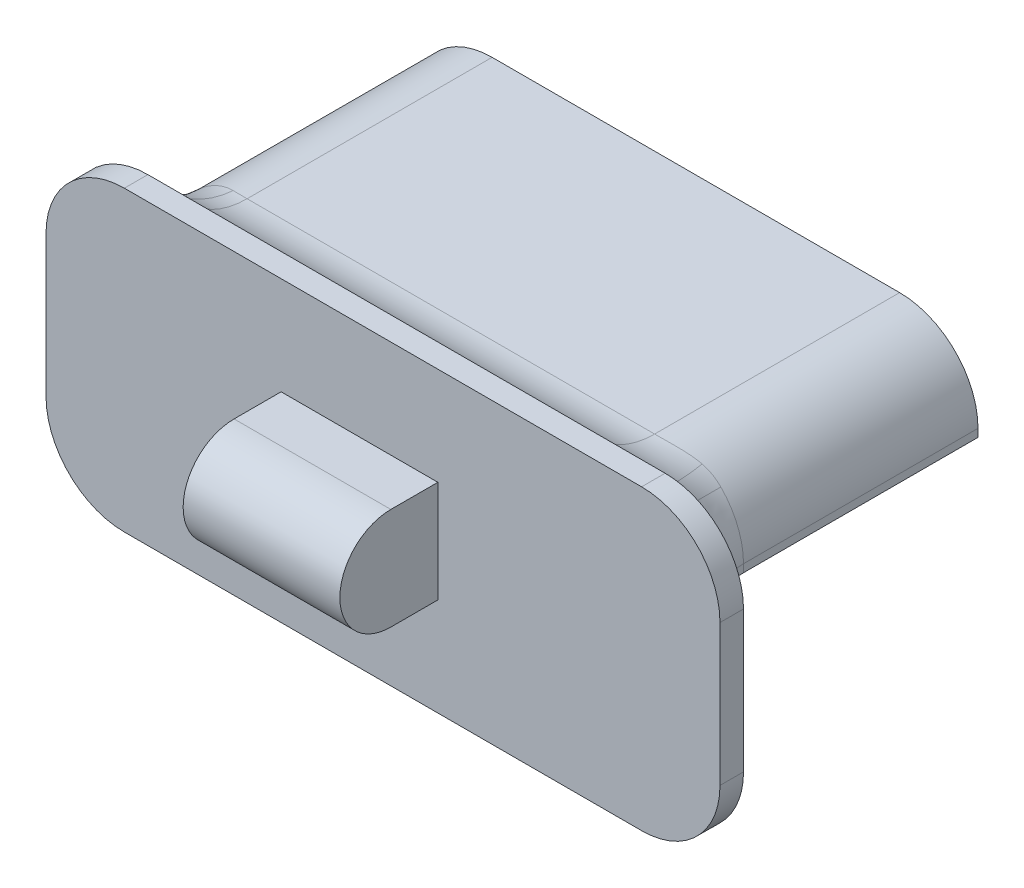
ISO-10303-21;
HEADER;
FILE_DESCRIPTION(('STEP AP214'),'2;1');
FILE_NAME('part.step','',(''),(''),'','','');
FILE_SCHEMA(('AUTOMOTIVE_DESIGN { 1 0 10303 214 1 1 1 1 }'));
ENDSEC;
DATA;
#1=APPLICATION_CONTEXT('core data for automotive mechanical design processes');
#2=APPLICATION_PROTOCOL_DEFINITION('international standard','automotive_design',2000,#1);
#3=PRODUCT_CONTEXT('',#1,'mechanical');
#4=PRODUCT('Part','Part','',(#3));
#5=PRODUCT_RELATED_PRODUCT_CATEGORY('part','',(#4));
#6=PRODUCT_DEFINITION_FORMATION('','',#4);
#7=PRODUCT_DEFINITION_CONTEXT('part definition',#1,'design');
#8=PRODUCT_DEFINITION('design','',#6,#7);
#9=PRODUCT_DEFINITION_SHAPE('','',#8);
#10=(LENGTH_UNIT() NAMED_UNIT(*) SI_UNIT(.MILLI.,.METRE.));
#11=(NAMED_UNIT(*) PLANE_ANGLE_UNIT() SI_UNIT($,.RADIAN.));
#12=(NAMED_UNIT(*) SI_UNIT($,.STERADIAN.) SOLID_ANGLE_UNIT());
#13=UNCERTAINTY_MEASURE_WITH_UNIT(LENGTH_MEASURE(1.E-05),#10,'distance_accuracy_value','');
#14=(GEOMETRIC_REPRESENTATION_CONTEXT(3) GLOBAL_UNCERTAINTY_ASSIGNED_CONTEXT((#13)) GLOBAL_UNIT_ASSIGNED_CONTEXT((#10,
#11,#12)) REPRESENTATION_CONTEXT('',''));
#15=CARTESIAN_POINT('',(0.,0.,0.));
#16=DIRECTION('',(0.,0.,1.));
#17=DIRECTION('',(1.,0.,0.));
#18=AXIS2_PLACEMENT_3D('',#15,#16,#17);
#19=CARTESIAN_POINT('',(18.,-7.,43.));
#20=DIRECTION('',(-1.,0.,0.));
#21=DIRECTION('',(0.,0.,1.));
#22=AXIS2_PLACEMENT_3D('',#19,#20,#21);
#23=PLANE('',#22);
#24=DIRECTION('',(0.,-1.,0.));
#25=VECTOR('',#24,1.);
#26=CARTESIAN_POINT('',(18.,-7.,21.5390293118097));
#27=LINE('',#26,#25);
#28=CARTESIAN_POINT('',(18.,2.,21.5390293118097));
#29=VERTEX_POINT('',#28);
#30=CARTESIAN_POINT('',(18.,1.5,21.5390293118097));
#31=VERTEX_POINT('',#30);
#32=EDGE_CURVE('E54',#29,#31,#27,.T.);
#33=ORIENTED_EDGE('',*,*,#32,.F.);
#34=DIRECTION('',(0.,0.,-1.));
#35=VECTOR('',#34,1.);
#36=CARTESIAN_POINT('',(18.,2.,43.));
#37=LINE('',#36,#35);
#38=CARTESIAN_POINT('',(18.,2.,36.5));
#39=VERTEX_POINT('',#38);
#40=EDGE_CURVE('E732',#29,#39,#37,.F.);
#41=ORIENTED_EDGE('',*,*,#40,.T.);
#42=DIRECTION('',(0.,-1.,0.));
#43=VECTOR('',#42,1.);
#44=CARTESIAN_POINT('',(18.,-7.,36.5));
#45=LINE('',#44,#43);
#46=CARTESIAN_POINT('',(18.,1.5,36.5));
#47=VERTEX_POINT('',#46);
#48=EDGE_CURVE('E802',#39,#47,#45,.T.);
#49=ORIENTED_EDGE('',*,*,#48,.T.);
#50=DIRECTION('',(0.,0.,-1.));
#51=VECTOR('',#50,1.);
#52=CARTESIAN_POINT('',(18.,1.5,43.));
#53=LINE('',#52,#51);
#54=EDGE_CURVE('E258',#47,#31,#53,.T.);
#55=ORIENTED_EDGE('',*,*,#54,.T.);
#56=EDGE_LOOP('',(#33,#41,#49,#55));
#57=FACE_BOUND('',#56,.T.);
#58=ADVANCED_FACE('F40',(#57),#23,.F.);
#59=CARTESIAN_POINT('',(-18.,7.,43.));
#60=DIRECTION('',(0.,-1.,0.));
#61=DIRECTION('',(0.,0.,-1.));
#62=AXIS2_PLACEMENT_3D('',#59,#60,#61);
#63=PLANE('',#62);
#64=DIRECTION('',(1.,0.,0.));
#65=VECTOR('',#64,1.);
#66=CARTESIAN_POINT('',(-18.,7.,21.5390293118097));
#67=LINE('',#66,#65);
#68=CARTESIAN_POINT('',(-13.,7.,21.5390293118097));
#69=VERTEX_POINT('',#68);
#70=CARTESIAN_POINT('',(13.,7.,21.5390293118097));
#71=VERTEX_POINT('',#70);
#72=EDGE_CURVE('E840',#69,#71,#67,.T.);
#73=ORIENTED_EDGE('',*,*,#72,.F.);
#74=DIRECTION('',(0.,0.,-1.));
#75=VECTOR('',#74,1.);
#76=CARTESIAN_POINT('',(-13.,7.,43.));
#77=LINE('',#76,#75);
#78=CARTESIAN_POINT('',(-13.,7.,37.1698729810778));
#79=VERTEX_POINT('',#78);
#80=EDGE_CURVE('E736',#69,#79,#77,.F.);
#81=ORIENTED_EDGE('',*,*,#80,.T.);
#82=DIRECTION('',(1.,0.,0.));
#83=VECTOR('',#82,1.);
#84=CARTESIAN_POINT('',(-18.,7.,37.1698729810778));
#85=LINE('',#84,#83);
#86=CARTESIAN_POINT('',(13.,7.,37.1698729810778));
#87=VERTEX_POINT('',#86);
#88=EDGE_CURVE('E790',#79,#87,#85,.T.);
#89=ORIENTED_EDGE('',*,*,#88,.T.);
#90=DIRECTION('',(0.,0.,-1.));
#91=VECTOR('',#90,1.);
#92=CARTESIAN_POINT('',(13.,7.,43.));
#93=LINE('',#92,#91);
#94=EDGE_CURVE('E766',#87,#71,#93,.T.);
#95=ORIENTED_EDGE('',*,*,#94,.T.);
#96=EDGE_LOOP('',(#73,#81,#89,#95));
#97=FACE_BOUND('',#96,.T.);
#98=ADVANCED_FACE('F501',(#97),#63,.F.);
#99=CARTESIAN_POINT('',(-18.,-7.,43.));
#100=DIRECTION('',(1.,0.,0.));
#101=DIRECTION('',(0.,0.,-1.));
#102=AXIS2_PLACEMENT_3D('',#99,#100,#101);
#103=PLANE('',#102);
#104=DIRECTION('',(0.,1.,0.));
#105=VECTOR('',#104,1.);
#106=CARTESIAN_POINT('',(-18.,-7.,21.5390293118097));
#107=LINE('',#106,#105);
#108=CARTESIAN_POINT('',(-18.,1.5,21.5390293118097));
#109=VERTEX_POINT('',#108);
#110=CARTESIAN_POINT('',(-18.,2.,21.5390293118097));
#111=VERTEX_POINT('',#110);
#112=EDGE_CURVE('E241',#109,#111,#107,.T.);
#113=ORIENTED_EDGE('',*,*,#112,.F.);
#114=DIRECTION('',(0.,0.,1.));
#115=VECTOR('',#114,1.);
#116=CARTESIAN_POINT('',(-18.,1.5,43.));
#117=LINE('',#116,#115);
#118=CARTESIAN_POINT('',(-18.,1.5,37.5));
#119=VERTEX_POINT('',#118);
#120=EDGE_CURVE('E249',#109,#119,#117,.T.);
#121=ORIENTED_EDGE('',*,*,#120,.T.);
#122=DIRECTION('',(0.,1.,0.));
#123=VECTOR('',#122,1.);
#124=CARTESIAN_POINT('',(-18.,-7.,37.5));
#125=LINE('',#124,#123);
#126=CARTESIAN_POINT('',(-18.,2.,37.5));
#127=VERTEX_POINT('',#126);
#128=EDGE_CURVE('E572',#119,#127,#125,.T.);
#129=ORIENTED_EDGE('',*,*,#128,.T.);
#130=DIRECTION('',(0.,0.,-1.));
#131=VECTOR('',#130,1.);
#132=CARTESIAN_POINT('',(-18.,2.,43.));
#133=LINE('',#132,#131);
#134=EDGE_CURVE('E252',#127,#111,#133,.T.);
#135=ORIENTED_EDGE('',*,*,#134,.T.);
#136=EDGE_LOOP('',(#113,#121,#129,#135));
#137=FACE_BOUND('',#136,.T.);
#138=ADVANCED_FACE('F248',(#137),#103,.F.);
#139=CARTESIAN_POINT('',(13.,2.,43.));
#140=DIRECTION('',(0.,0.,-1.));
#141=DIRECTION('',(-1.,0.,0.));
#142=AXIS2_PLACEMENT_3D('',#139,#140,#141);
#143=CYLINDRICAL_SURFACE('',#142,5.);
#144=ORIENTED_EDGE('',*,*,#40,.F.);
#145=CARTESIAN_POINT('',(13.,2.,21.5390293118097));
#146=DIRECTION('',(0.,0.,-1.));
#147=DIRECTION('',(-1.,0.,0.));
#148=AXIS2_PLACEMENT_3D('',#145,#146,#147);
#149=CIRCLE('',#148,5.);
#150=EDGE_CURVE('E838',#29,#71,#149,.F.);
#151=ORIENTED_EDGE('',*,*,#150,.T.);
#152=ORIENTED_EDGE('',*,*,#94,.F.);
#153=CARTESIAN_POINT('',(11.327899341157,6.7121204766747,36.8851005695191));
#154=CARTESIAN_POINT('',(10.8828572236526,6.5541968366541,40.2717099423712));
#155=CARTESIAN_POINT('',(9.65579868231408,9.5,41.5));
#156=CARTESIAN_POINT('',(11.4554359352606,6.7573840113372,36.9229433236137));
#157=CARTESIAN_POINT('',(11.0246122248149,6.61826655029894,40.2309843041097));
#158=CARTESIAN_POINT('',(9.91087187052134,9.5,41.5));
#159=CARTESIAN_POINT('',(11.5849465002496,6.79750367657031,36.9594422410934));
#160=CARTESIAN_POINT('',(11.1770693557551,6.67814176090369,40.1976599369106));
#161=CARTESIAN_POINT('',(10.1698930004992,9.5,41.5));
#162=CARTESIAN_POINT('',(11.8472873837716,6.86720413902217,37.0263378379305));
#163=CARTESIAN_POINT('',(11.4958394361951,6.78469778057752,40.1435240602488));
#164=CARTESIAN_POINT('',(10.6945747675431,9.5,41.5));
#165=CARTESIAN_POINT('',(11.9801207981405,6.8967746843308,37.0567285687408));
#166=CARTESIAN_POINT('',(11.6625330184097,6.83169389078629,40.1224910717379));
#167=CARTESIAN_POINT('',(10.9602415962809,9.5,41.5));
#168=CARTESIAN_POINT('',(12.2470077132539,6.94481707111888,37.107673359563));
#169=CARTESIAN_POINT('',(12.0039037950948,6.90883164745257,40.0900927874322));
#170=CARTESIAN_POINT('',(11.4940154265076,9.5,41.5));
#171=CARTESIAN_POINT('',(12.3810390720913,6.96338757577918,37.128314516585));
#172=CARTESIAN_POINT('',(12.1789970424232,6.93938245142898,40.0785119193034));
#173=CARTESIAN_POINT('',(11.7620781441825,9.5,41.5));
#174=CARTESIAN_POINT('',(12.6504388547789,6.98960016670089,37.157822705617));
#175=CARTESIAN_POINT('',(12.533944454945,6.9825896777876,40.0626050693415));
#176=CARTESIAN_POINT('',(12.3008777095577,9.5,41.5));
#177=CARTESIAN_POINT('',(12.7858066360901,6.9972472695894,37.1666951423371));
#178=CARTESIAN_POINT('',(12.7144144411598,6.99540992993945,40.0582155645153));
#179=CARTESIAN_POINT('',(12.5716132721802,9.5,41.5));
#180=CARTESIAN_POINT('',(13.0527631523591,7.00145046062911,37.1715475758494));
#181=CARTESIAN_POINT('',(13.0702440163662,7.00241742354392,40.0557863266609));
#182=CARTESIAN_POINT('',(13.1055263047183,9.5,41.5));
#183=CARTESIAN_POINT('',(13.1843451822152,6.99832804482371,37.1679013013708));
#184=CARTESIAN_POINT('',(13.2462096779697,6.99716957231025,40.0575540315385));
#185=CARTESIAN_POINT('',(13.3686903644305,9.5,41.5));
#186=CARTESIAN_POINT('',(13.4466566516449,6.98174393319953,37.14895572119));
#187=CARTESIAN_POINT('',(13.5942075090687,6.96965425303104,40.0673381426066));
#188=CARTESIAN_POINT('',(13.8933133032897,9.5,41.5));
#189=CARTESIAN_POINT('',(13.5773859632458,6.96828071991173,37.1336547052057));
#190=CARTESIAN_POINT('',(13.766828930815,6.94728955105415,40.0753896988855));
#191=CARTESIAN_POINT('',(14.1547719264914,9.5,41.5));
#192=CARTESIAN_POINT('',(13.837285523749,6.93114879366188,37.0930362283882));
#193=CARTESIAN_POINT('',(14.1044989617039,6.88684403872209,40.0991403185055));
#194=CARTESIAN_POINT('',(14.6745710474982,9.5,41.5));
#195=CARTESIAN_POINT('',(13.9664514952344,6.9074566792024,37.0676958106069));
#196=CARTESIAN_POINT('',(14.2700473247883,6.84852747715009,40.1149446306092));
#197=CARTESIAN_POINT('',(14.9329029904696,9.5,41.5));
#198=CARTESIAN_POINT('',(14.2221231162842,6.85011172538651,37.0096622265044));
#199=CARTESIAN_POINT('',(14.5893845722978,6.75848284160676,40.1564498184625));
#200=CARTESIAN_POINT('',(15.4442462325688,9.5,41.5));
#201=CARTESIAN_POINT('',(14.3486286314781,6.81645838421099,36.9769686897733));
#202=CARTESIAN_POINT('',(14.7435738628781,6.70647931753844,40.1823137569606));
#203=CARTESIAN_POINT('',(15.6972572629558,9.5,41.5));
#204=CARTESIAN_POINT('',(14.5951543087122,6.74043196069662,36.9083830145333));
#205=CARTESIAN_POINT('',(15.0327839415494,6.59380598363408,40.2459175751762));
#206=CARTESIAN_POINT('',(16.1903086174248,9.5,41.5));
#207=CARTESIAN_POINT('',(14.7152575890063,6.69830402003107,36.8725941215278));
#208=CARTESIAN_POINT('',(15.1684677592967,6.5330889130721,40.2835927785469));
#209=CARTESIAN_POINT('',(16.4305151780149,9.5,41.5));
#210=CARTESIAN_POINT('',(14.9518506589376,6.60504575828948,36.8004707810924));
#211=CARTESIAN_POINT('',(15.4219355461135,6.4061150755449,40.3737948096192));
#212=CARTESIAN_POINT('',(16.9037013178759,9.5,41.5));
#213=CARTESIAN_POINT('',(15.0683409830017,6.55391677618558,36.76413641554));
#214=CARTESIAN_POINT('',(15.5397730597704,6.33960500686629,40.4266720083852));
#215=CARTESIAN_POINT('',(17.1366819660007,9.5,41.5));
#216=CARTESIAN_POINT('',(15.2969619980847,6.44297880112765,36.694521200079));
#217=CARTESIAN_POINT('',(15.7537846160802,6.20663328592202,40.5498406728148));
#218=CARTESIAN_POINT('',(17.5939239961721,9.5,41.5));
#219=CARTESIAN_POINT('',(15.4091038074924,6.38319408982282,36.6612322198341));
#220=CARTESIAN_POINT('',(15.8498722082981,6.14001285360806,40.6205558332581));
#221=CARTESIAN_POINT('',(17.8182076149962,9.5,41.5));
#222=CARTESIAN_POINT('',(15.6288842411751,6.25501616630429,36.6013189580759));
#223=CARTESIAN_POINT('',(16.0177568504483,6.01403939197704,40.7809865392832));
#224=CARTESIAN_POINT('',(18.2577684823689,9.5,41.5));
#225=CARTESIAN_POINT('',(15.7365206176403,6.18661872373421,36.5746979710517));
#226=CARTESIAN_POINT('',(16.0891747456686,5.95473074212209,40.8712646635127));
#227=CARTESIAN_POINT('',(18.473041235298,9.5,41.5));
#228=CARTESIAN_POINT('',(15.841608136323,6.11403247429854,36.5532918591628));
#229=CARTESIAN_POINT('',(16.1456386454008,5.90403520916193,40.9707397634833));
#230=CARTESIAN_POINT('',(18.683216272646,9.5,41.5));
#231=(BOUNDED_SURFACE() B_SPLINE_SURFACE(3,2,((#153,#154,#155),(#156,#157,#158),(#159,#160,
#161),(#162,#163,#164),(#165,#166,#167),(#168,#169,#170),(#171,#172,#173),(#174,#175,#176),
(#177,#178,#179),(#180,#181,#182),(#183,#184,#185),(#186,#187,#188),(#189,#190,#191),(#192,#193,
#194),(#195,#196,#197),(#198,#199,#200),(#201,#202,#203),(#204,#205,#206),(#207,#208,#209),
(#210,#211,#212),(#213,#214,#215),(#216,#217,#218),(#219,#220,#221),(#222,#223,#224),(#225,#226,
#227),(#228,#229,#230)),.UNSPECIFIED.,.F.,.F.,.F.) B_SPLINE_SURFACE_WITH_KNOTS((4,2,2,2,2,2,2,2,
2,2,2,2,4),(3,3),(0.,0.819803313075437,1.64040117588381,2.4535227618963,3.26627079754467,
4.05496897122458,4.84378290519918,5.634411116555,6.42507916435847,7.19551661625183,
7.96583955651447,8.73404196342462,9.50262317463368),(0.,1.),
.UNSPECIFIED.) GEOMETRIC_REPRESENTATION_ITEM() RATIONAL_B_SPLINE_SURFACE(((1.,0.825436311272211,
1.),(1.,0.831664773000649,1.),(1.,0.837253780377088,1.),(1.,0.84704154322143,1.),(1.,
0.851238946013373,1.),(1.,0.858088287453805,1.),(1.,0.86075395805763,1.),(1.,0.864523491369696,
1.),(1.,0.865628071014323,1.),(1.,0.86623477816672,1.),(1.,0.865783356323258,1.),(1.,
0.863393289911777,1.),(1.,0.861454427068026,1.),(1.,0.856136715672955,1.),(1.,0.852754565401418,
1.),(1.,0.844636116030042,1.),(1.,0.839899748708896,1.),(1.,0.829321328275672,1.),(1.,
0.823510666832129,1.),(1.,0.810835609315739,1.),(1.,0.803971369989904,1.),(1.,0.789357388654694,
1.),(1.,0.781610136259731,1.),(1.,0.765414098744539,1.),(1.,0.756964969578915,1.),(1.,
0.748268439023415,1.))) REPRESENTATION_ITEM('') SURFACE());
#232=CARTESIAN_POINT('',(11.327899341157,6.7121204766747,36.8851005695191));
#233=CARTESIAN_POINT('',(11.4554359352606,6.7573840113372,36.9229433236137));
#234=CARTESIAN_POINT('',(11.5849465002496,6.79750367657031,36.9594422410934));
#235=CARTESIAN_POINT('',(11.8472873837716,6.86720413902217,37.0263378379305));
#236=CARTESIAN_POINT('',(11.9801207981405,6.89677468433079,37.0567285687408));
#237=CARTESIAN_POINT('',(12.2470077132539,6.94481707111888,37.107673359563));
#238=CARTESIAN_POINT('',(12.3810390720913,6.96338757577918,37.128314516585));
#239=CARTESIAN_POINT('',(12.6504388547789,6.98960016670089,37.157822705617));
#240=CARTESIAN_POINT('',(12.7858066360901,6.9972472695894,37.1666951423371));
#241=CARTESIAN_POINT('',(13.0527631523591,7.00145046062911,37.1715475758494));
#242=CARTESIAN_POINT('',(13.1843451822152,6.99832804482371,37.1679013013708));
#243=CARTESIAN_POINT('',(13.4466566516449,6.98174393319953,37.14895572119));
#244=CARTESIAN_POINT('',(13.5773859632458,6.96828071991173,37.1336547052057));
#245=CARTESIAN_POINT('',(13.837285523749,6.93114879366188,37.0930362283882));
#246=CARTESIAN_POINT('',(13.9664514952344,6.9074566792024,37.0676958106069));
#247=CARTESIAN_POINT('',(14.2221231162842,6.85011172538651,37.0096622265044));
#248=CARTESIAN_POINT('',(14.3486286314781,6.81645838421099,36.9769686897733));
#249=CARTESIAN_POINT('',(14.5951543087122,6.74043196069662,36.9083830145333));
#250=CARTESIAN_POINT('',(14.7152575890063,6.69830402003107,36.8725941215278));
#251=CARTESIAN_POINT('',(14.9518506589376,6.60504575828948,36.8004707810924));
#252=CARTESIAN_POINT('',(15.0683409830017,6.55391677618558,36.76413641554));
#253=CARTESIAN_POINT('',(15.2969619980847,6.44297880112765,36.694521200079));
#254=CARTESIAN_POINT('',(15.4091038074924,6.38319408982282,36.6612322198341));
#255=CARTESIAN_POINT('',(15.6288842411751,6.25501616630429,36.6013189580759));
#256=CARTESIAN_POINT('',(15.7365206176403,6.18661872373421,36.5746979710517));
#257=CARTESIAN_POINT('',(15.841608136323,6.11403247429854,36.5532918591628));
#258=B_SPLINE_CURVE_WITH_KNOTS('',3,(#232,#233,#234,#235,#236,#237,#238,#239,#240,#241,#242,
#243,#244,#245,#246,#247,#248,#249,#250,#251,#252,#253,#254,#255,#256,#257),.UNSPECIFIED.,.F.,
.F.,(4,2,2,2,2,2,2,2,2,2,2,2,4),(0.,0.819803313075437,1.64040117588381,2.4535227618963,
3.26627079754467,4.05496897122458,4.84378290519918,5.634411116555,6.42507916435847,
7.19551661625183,7.96583955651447,8.73404196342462,9.50262317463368),.UNSPECIFIED.);
#259=CARTESIAN_POINT('',(15.5,6.3301270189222,36.6364816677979));
#260=VERTEX_POINT('',#259);
#261=EDGE_CURVE('E354',#87,#260,#258,.T.);
#262=ORIENTED_EDGE('',*,*,#261,.T.);
#263=CARTESIAN_POINT('',(15.3443626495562,6.41632921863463,36.6829900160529));
#264=CARTESIAN_POINT('',(15.8367078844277,6.1549728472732,40.5982622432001));
#265=CARTESIAN_POINT('',(17.7545270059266,9.49397066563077,41.5));
#266=CARTESIAN_POINT('',(15.3952774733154,6.38930223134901,36.6665759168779));
#267=CARTESIAN_POINT('',(15.8634932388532,6.13344504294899,40.6257662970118));
#268=CARTESIAN_POINT('',(17.8325417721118,9.49779965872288,41.5));
#269=CARTESIAN_POINT('',(15.4458003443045,6.36135327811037,36.6514758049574));
#270=CARTESIAN_POINT('',(15.8899440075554,6.11193388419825,40.6542908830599));
#271=CARTESIAN_POINT('',(17.9121470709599,9.4998859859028,41.5));
#272=CARTESIAN_POINT('',(15.545971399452,6.30364613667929,36.6237591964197));
#273=CARTESIAN_POINT('',(15.9426076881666,6.06865424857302,40.7134147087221));
#274=CARTESIAN_POINT('',(18.074506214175,9.50010510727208,41.5));
#275=CARTESIAN_POINT('',(15.5956196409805,6.2738880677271,36.6111425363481));
#276=CARTESIAN_POINT('',(15.9688187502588,6.04688372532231,40.7440303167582));
#277=CARTESIAN_POINT('',(18.1572598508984,9.49823816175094,41.5));
#278=CARTESIAN_POINT('',(15.7430407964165,6.18199996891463,36.5768181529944));
#279=CARTESIAN_POINT('',(16.0477079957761,5.98076021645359,40.8390891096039));
#280=CARTESIAN_POINT('',(18.4100636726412,9.48601275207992,41.5));
#281=CARTESIAN_POINT('',(15.8393789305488,6.11720895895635,36.5586080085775));
#282=CARTESIAN_POINT('',(16.1000575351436,5.93606747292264,40.9061267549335));
#283=CARTESIAN_POINT('',(18.5847924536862,9.46903798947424,41.5));
#284=CARTESIAN_POINT('',(16.0255178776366,5.98235837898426,36.5304914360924));
#285=CARTESIAN_POINT('',(16.2054628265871,5.84432095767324,41.0446378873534));
#286=CARTESIAN_POINT('',(18.941683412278,9.41376965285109,41.5));
#287=CARTESIAN_POINT('',(16.1154131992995,5.91243709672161,36.5204195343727));
#288=CARTESIAN_POINT('',(16.2585123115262,5.79728157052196,41.1160852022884));
#289=CARTESIAN_POINT('',(19.1236141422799,9.37592870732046,41.5));
#290=CARTESIAN_POINT('',(16.2903000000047,5.76654971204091,36.5064620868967));
#291=CARTESIAN_POINT('',(16.3680747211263,5.69738823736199,41.2623517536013));
#292=CARTESIAN_POINT('',(19.4958717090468,9.2748895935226,41.5));
#293=CARTESIAN_POINT('',(16.3752906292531,5.6905825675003,36.5025776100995));
#294=CARTESIAN_POINT('',(16.4246095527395,5.6444713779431,41.3371800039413));
#295=CARTESIAN_POINT('',(19.6861999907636,9.2116870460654,41.5));
#296=CARTESIAN_POINT('',(16.5478454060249,5.52539329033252,36.4991494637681));
#297=CARTESIAN_POINT('',(16.5481468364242,5.52387665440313,41.494109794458));
#298=CARTESIAN_POINT('',(20.0898149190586,9.0480155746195,41.5));
#299=CARTESIAN_POINT('',(16.6348663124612,5.43559948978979,36.5000609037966));
#300=CARTESIAN_POINT('',(16.6155403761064,5.45526891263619,41.575981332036));
#301=CARTESIAN_POINT('',(20.3035445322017,8.94453876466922,41.5));
#302=CARTESIAN_POINT('',(16.7601485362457,5.29623879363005,36.5036645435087));
#303=CARTESIAN_POINT('',(16.7205223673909,5.34124348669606,41.6933249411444));
#304=CARTESIAN_POINT('',(20.6218299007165,8.75923713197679,41.5));
#305=CARTESIAN_POINT('',(16.8010402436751,5.24899935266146,36.505238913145));
#306=CARTESIAN_POINT('',(16.7563566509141,5.30114683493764,41.7317036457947));
#307=CARTESIAN_POINT('',(20.7275560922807,8.69244306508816,41.5));
#308=CARTESIAN_POINT('',(16.881022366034,5.15302486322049,36.508826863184));
#309=CARTESIAN_POINT('',(16.8292278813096,5.21665595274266,41.8057064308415));
#310=CARTESIAN_POINT('',(20.9369016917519,8.54854704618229,41.5));
#311=CARTESIAN_POINT('',(16.9201129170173,5.10428992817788,36.5108404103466));
#312=CARTESIAN_POINT('',(16.8662463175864,5.17226279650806,41.8412837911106));
#313=CARTESIAN_POINT('',(21.0405212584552,8.47144587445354,41.5));
#314=CARTESIAN_POINT('',(16.9973430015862,5.00422003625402,36.5150620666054));
#315=CARTESIAN_POINT('',(16.9420158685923,5.0777888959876,41.9093571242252));
#316=CARTESIAN_POINT('',(21.2466185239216,8.30492105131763,41.5));
#317=CARTESIAN_POINT('',(17.0354380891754,4.95285083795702,36.5172736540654));
#318=CARTESIAN_POINT('',(16.9807513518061,5.02761942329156,41.9416967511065));
#319=CARTESIAN_POINT('',(21.3490110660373,8.21524881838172,41.5));
#320=CARTESIAN_POINT('',(17.1096308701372,4.84868789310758,36.5215600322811));
#321=CARTESIAN_POINT('',(17.0585252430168,4.92245751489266,42.0010592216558));
#322=CARTESIAN_POINT('',(21.5483989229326,8.02531299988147,41.5));
#323=CARTESIAN_POINT('',(17.1457285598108,4.79589414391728,36.5236348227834));
#324=CARTESIAN_POINT('',(17.0975219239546,4.86749717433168,42.0280196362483));
#325=CARTESIAN_POINT('',(21.645394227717,7.92504939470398,41.5));
#326=CARTESIAN_POINT('',(17.2158710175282,4.68896250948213,36.5273949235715));
#327=CARTESIAN_POINT('',(17.1750796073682,4.75304413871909,42.0754198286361));
#328=CARTESIAN_POINT('',(21.8322676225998,7.71457207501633,41.5));
#329=CARTESIAN_POINT('',(17.2499159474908,4.63482473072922,36.5290802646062));
#330=CARTESIAN_POINT('',(17.2135892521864,4.6936051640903,42.0958015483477));
#331=CARTESIAN_POINT('',(21.9221462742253,7.60435914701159,41.5));
#332=CARTESIAN_POINT('',(17.3159066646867,4.52528020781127,36.5318840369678));
#333=CARTESIAN_POINT('',(17.2893463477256,4.57089740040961,42.1291030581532));
#334=CARTESIAN_POINT('',(22.0932155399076,7.37510362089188,41.5));
#335=CARTESIAN_POINT('',(17.347852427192,4.46987344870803,36.5330024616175));
#336=CARTESIAN_POINT('',(17.3265370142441,4.5077027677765,42.1419769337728));
#337=CARTESIAN_POINT('',(22.1744060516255,7.25606091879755,41.5));
#338=CARTESIAN_POINT('',(17.3787235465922,4.41387242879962,36.5337485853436));
#339=CARTESIAN_POINT('',(17.3626386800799,4.4430501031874,42.1506705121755));
#340=CARTESIAN_POINT('',(22.2504617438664,7.13316823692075,41.5));
#341=(BOUNDED_SURFACE() B_SPLINE_SURFACE(3,2,((#263,#264,#265),(#266,#267,#268),(#269,#270,
#271),(#272,#273,#274),(#275,#276,#277),(#278,#279,#280),(#281,#282,#283),(#284,#285,#286),
(#287,#288,#289),(#290,#291,#292),(#293,#294,#295),(#296,#297,#298),(#299,#300,#301),(#302,#303,
#304),(#305,#306,#307),(#308,#309,#310),(#311,#312,#313),(#314,#315,#316),(#317,#318,#319),
(#320,#321,#322),(#323,#324,#325),(#326,#327,#328),(#329,#330,#331),(#332,#333,#334),(#335,#336,
#337),(#338,#339,#340)),.UNSPECIFIED.,.F.,.F.,.F.) B_SPLINE_SURFACE_WITH_KNOTS((4,2,2,2,2,2,2,2,
2,2,2,2,4),(3,3),(0.,0.34929648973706,0.698569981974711,1.39650991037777,2.07987396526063,
2.76335606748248,3.5128006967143,3.88763709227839,4.26244512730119,4.64612944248,
5.02981446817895,5.41346918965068,5.79712842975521),(0.,1.),
.UNSPECIFIED.) GEOMETRIC_REPRESENTATION_ITEM() RATIONAL_B_SPLINE_SURFACE(((1.,0.784319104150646,
1.),(1.,0.781267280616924,1.),(1.,0.77821258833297,1.),(1.,0.772103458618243,1.),(1.,
0.769049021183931,1.),(1.,0.759899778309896,1.),(1.,0.753813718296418,1.),(1.,0.741874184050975,
1.),(1.,0.7360185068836,1.),(1.,0.724527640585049,1.),(1.,0.718892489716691,1.),(1.,
0.707496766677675,1.),(1.,0.701776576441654,1.),(1.,0.693806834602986,1.),(1.,0.691251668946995,
1.),(1.,0.686394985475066,1.),(1.,0.684093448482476,1.),(1.,0.679744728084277,1.),(1.,
0.677704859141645,1.),(1.,0.674000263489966,1.),(1.,0.672335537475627,1.),(1.,0.669432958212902,
1.),(1.,0.668195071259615,1.),(1.,0.666184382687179,1.),(1.,0.665411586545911,1.),(1.,
0.664890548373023,1.))) REPRESENTATION_ITEM('') SURFACE());
#342=CARTESIAN_POINT('',(15.3443626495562,6.41632921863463,36.6829900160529));
#343=CARTESIAN_POINT('',(15.3952774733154,6.38930223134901,36.6665759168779));
#344=CARTESIAN_POINT('',(15.4458003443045,6.36135327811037,36.6514758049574));
#345=CARTESIAN_POINT('',(15.545971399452,6.30364613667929,36.6237591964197));
#346=CARTESIAN_POINT('',(15.5956196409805,6.2738880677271,36.6111425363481));
#347=CARTESIAN_POINT('',(15.7430407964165,6.18199996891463,36.5768181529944));
#348=CARTESIAN_POINT('',(15.8393789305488,6.11720895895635,36.5586080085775));
#349=CARTESIAN_POINT('',(16.0255178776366,5.98235837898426,36.5304914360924));
#350=CARTESIAN_POINT('',(16.1154131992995,5.91243709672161,36.5204195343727));
#351=CARTESIAN_POINT('',(16.2903000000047,5.76654971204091,36.5064620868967));
#352=CARTESIAN_POINT('',(16.3752906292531,5.6905825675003,36.5025776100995));
#353=CARTESIAN_POINT('',(16.5478454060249,5.52539329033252,36.4991494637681));
#354=CARTESIAN_POINT('',(16.6348663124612,5.43559948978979,36.5000609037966));
#355=CARTESIAN_POINT('',(16.7601485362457,5.29623879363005,36.5036645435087));
#356=CARTESIAN_POINT('',(16.8010402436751,5.24899935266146,36.505238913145));
#357=CARTESIAN_POINT('',(16.881022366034,5.15302486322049,36.508826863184));
#358=CARTESIAN_POINT('',(16.9201129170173,5.10428992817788,36.5108404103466));
#359=CARTESIAN_POINT('',(16.9973430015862,5.00422003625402,36.5150620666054));
#360=CARTESIAN_POINT('',(17.0354380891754,4.95285083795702,36.5172736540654));
#361=CARTESIAN_POINT('',(17.1096308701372,4.84868789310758,36.5215600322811));
#362=CARTESIAN_POINT('',(17.1457285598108,4.79589414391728,36.5236348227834));
#363=CARTESIAN_POINT('',(17.2158710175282,4.68896250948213,36.5273949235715));
#364=CARTESIAN_POINT('',(17.2499159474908,4.63482473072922,36.5290802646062));
#365=CARTESIAN_POINT('',(17.3159066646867,4.52528020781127,36.5318840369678));
#366=CARTESIAN_POINT('',(17.347852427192,4.46987344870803,36.5330024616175));
#367=CARTESIAN_POINT('',(17.3787235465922,4.41387242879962,36.5337485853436));
#368=B_SPLINE_CURVE_WITH_KNOTS('',3,(#342,#343,#344,#345,#346,#347,#348,#349,#350,#351,#352,
#353,#354,#355,#356,#357,#358,#359,#360,#361,#362,#363,#364,#365,#366,#367),.UNSPECIFIED.,.F.,
.F.,(4,2,2,2,2,2,2,2,2,2,2,2,4),(0.,0.34929648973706,0.698569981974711,1.39650991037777,
2.07987396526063,2.76335606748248,3.5128006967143,3.88763709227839,4.26244512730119,
4.64612944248,5.02981446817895,5.41346918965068,5.79712842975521),.UNSPECIFIED.);
#369=CARTESIAN_POINT('',(16.5540294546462,5.5169410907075,36.5));
#370=VERTEX_POINT('',#369);
#371=EDGE_CURVE('E784',#260,#370,#368,.T.);
#372=ORIENTED_EDGE('',*,*,#371,.T.);
#373=CARTESIAN_POINT('',(13.,2.,36.5));
#374=DIRECTION('',(0.,0.,-1.));
#375=DIRECTION('',(-1.,0.,0.));
#376=AXIS2_PLACEMENT_3D('',#373,#374,#375);
#377=CIRCLE('',#376,5.);
#378=EDGE_CURVE('E818',#370,#39,#377,.T.);
#379=ORIENTED_EDGE('',*,*,#378,.T.);
#380=EDGE_LOOP('',(#144,#151,#152,#262,#372,#379));
#381=FACE_BOUND('',#380,.T.);
#382=ADVANCED_FACE('F511',(#381),#143,.T.);
#383=CARTESIAN_POINT('',(-13.,2.,43.));
#384=DIRECTION('',(0.,0.,-1.));
#385=DIRECTION('',(-1.,0.,0.));
#386=AXIS2_PLACEMENT_3D('',#383,#384,#385);
#387=CYLINDRICAL_SURFACE('',#386,5.);
#388=ORIENTED_EDGE('',*,*,#80,.F.);
#389=CARTESIAN_POINT('',(-13.,2.,21.5390293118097));
#390=DIRECTION('',(0.,0.,-1.));
#391=DIRECTION('',(-1.,0.,0.));
#392=AXIS2_PLACEMENT_3D('',#389,#390,#391);
#393=CIRCLE('',#392,5.);
#394=EDGE_CURVE('E1156',#69,#111,#393,.F.);
#395=ORIENTED_EDGE('',*,*,#394,.T.);
#396=ORIENTED_EDGE('',*,*,#134,.F.);
#397=CARTESIAN_POINT('',(-17.881822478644,0.919347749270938,37.3331946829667));
#398=CARTESIAN_POINT('',(-17.7979753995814,0.540570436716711,40.0395011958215));
#399=CARTESIAN_POINT('',(-20.,-0.161304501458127,41.5));
#400=CARTESIAN_POINT('',(-17.8944990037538,0.976614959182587,37.3500133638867));
#401=CARTESIAN_POINT('',(-17.8190770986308,0.614858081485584,40.0342425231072));
#402=CARTESIAN_POINT('',(-20.,-0.046770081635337,41.5));
#403=CARTESIAN_POINT('',(-17.9061825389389,1.03417013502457,37.3658409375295));
#404=CARTESIAN_POINT('',(-17.8387435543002,0.690419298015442,40.0296996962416));
#405=CARTESIAN_POINT('',(-20.,0.0683402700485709,41.5));
#406=CARTESIAN_POINT('',(-17.9275376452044,1.1498047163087,37.3952198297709));
#407=CARTESIAN_POINT('',(-17.8748940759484,0.843386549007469,40.0218340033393));
#408=CARTESIAN_POINT('',(-20.,0.299609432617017,41.5));
#409=CARTESIAN_POINT('',(-17.9372089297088,1.20788419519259,37.4087708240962));
#410=CARTESIAN_POINT('',(-17.8914002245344,0.920835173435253,40.0185045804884));
#411=CARTESIAN_POINT('',(-20.,0.415768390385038,41.5));
#412=CARTESIAN_POINT('',(-17.963165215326,1.38283921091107,37.4455677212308));
#413=CARTESIAN_POINT('',(-17.9358033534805,1.1551889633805,40.0099986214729));
#414=CARTESIAN_POINT('',(-20.,0.765678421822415,41.5));
#415=CARTESIAN_POINT('',(-17.976385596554,1.5003995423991,37.4649478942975));
#416=CARTESIAN_POINT('',(-17.9588093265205,1.31500116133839,40.0062564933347));
#417=CARTESIAN_POINT('',(-20.,1.00079908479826,41.5));
#418=CARTESIAN_POINT('',(-17.9942127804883,1.7333250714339,37.4912854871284));
#419=CARTESIAN_POINT('',(-17.989836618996,1.63320297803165,40.0014180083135));
#420=CARTESIAN_POINT('',(-20.,1.46665014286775,41.5));
#421=CARTESIAN_POINT('',(-17.9990414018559,1.84866441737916,37.4985625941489));
#422=CARTESIAN_POINT('',(-17.998322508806,1.79190303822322,40.0002401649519));
#423=CARTESIAN_POINT('',(-20.,1.69732883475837,41.5));
#424=CARTESIAN_POINT('',(-18.0006997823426,2.07938939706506,37.5010492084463));
#425=CARTESIAN_POINT('',(-18.0012241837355,2.10913010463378,39.9998246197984));
#426=CARTESIAN_POINT('',(-20.,2.15877879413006,41.5));
#427=CARTESIAN_POINT('',(-17.9975329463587,2.19477499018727,37.4962638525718));
#428=CARTESIAN_POINT('',(-17.9956535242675,2.26806962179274,40.0005850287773));
#429=CARTESIAN_POINT('',(-20.,2.38954998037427,41.5));
#430=CARTESIAN_POINT('',(-17.9832670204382,2.42460537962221,37.4750795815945));
#431=CARTESIAN_POINT('',(-17.9707788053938,2.58273340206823,40.0043547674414));
#432=CARTESIAN_POINT('',(-20.,2.84921075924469,41.5));
#433=CARTESIAN_POINT('',(-17.972179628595,2.5390513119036,37.4586977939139));
#434=CARTESIAN_POINT('',(-17.9514310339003,2.73886112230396,40.0073708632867));
#435=CARTESIAN_POINT('',(-20.,3.07810262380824,41.5));
#436=CARTESIAN_POINT('',(-17.9422322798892,2.76648938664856,37.4157368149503));
#437=CARTESIAN_POINT('',(-17.8998925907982,3.04557241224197,40.016714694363));
#438=CARTESIAN_POINT('',(-20.,3.53297877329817,41.5));
#439=CARTESIAN_POINT('',(-17.923368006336,2.87948068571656,37.3891519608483));
#440=CARTESIAN_POINT('',(-17.8675672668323,3.1965098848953,40.0230722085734));
#441=CARTESIAN_POINT('',(-20.,3.75896137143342,41.5));
#442=CARTESIAN_POINT('',(-17.8774455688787,3.1064860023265,37.3270218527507));
#443=CARTESIAN_POINT('',(-17.7903295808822,3.49444510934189,40.0410054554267));
#444=CARTESIAN_POINT('',(-20.,4.21297200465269,41.5));
#445=CARTESIAN_POINT('',(-17.8501732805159,3.22044045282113,37.2912470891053));
#446=CARTESIAN_POINT('',(-17.7449089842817,3.6414980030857,40.0527825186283));
#447=CARTESIAN_POINT('',(-20.,4.44088090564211,41.5));
#448=CARTESIAN_POINT('',(-17.7878965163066,3.44556978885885,37.2139102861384));
#449=CARTESIAN_POINT('',(-17.6440564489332,3.92465303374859,40.083782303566));
#450=CARTESIAN_POINT('',(-20.,4.89113957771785,41.5));
#451=CARTESIAN_POINT('',(-17.7529014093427,3.55674786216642,37.172355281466));
#452=CARTESIAN_POINT('',(-17.5884125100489,4.06099835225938,40.1031095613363));
#453=CARTESIAN_POINT('',(-20.,5.11349572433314,41.5));
#454=CARTESIAN_POINT('',(-17.7141403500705,3.66639753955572,37.1292503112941));
#455=CARTESIAN_POINT('',(-17.5291320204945,4.18977519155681,40.1272467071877));
#456=CARTESIAN_POINT('',(-20.,5.33279507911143,41.5));
#457=(BOUNDED_SURFACE() B_SPLINE_SURFACE(3,2,((#397,#398,#399),(#400,#401,#402),(#403,#404,
#405),(#406,#407,#408),(#409,#410,#411),(#412,#413,#414),(#415,#416,#417),(#418,#419,#420),
(#421,#422,#423),(#424,#425,#426),(#427,#428,#429),(#430,#431,#432),(#433,#434,#435),(#436,#437,
#438),(#439,#440,#441),(#442,#443,#444),(#445,#446,#447),(#448,#449,#450),(#451,#452,#453),
(#454,#455,#456)),.UNSPECIFIED.,.F.,.F.,.F.) B_SPLINE_SURFACE_WITH_KNOTS((4,2,2,2,2,2,2,2,2,4),
(3,3),(0.,0.355475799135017,0.711002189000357,1.42225185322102,2.11439771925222,
2.80624888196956,3.49708033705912,4.18829576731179,4.89881537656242,5.60847771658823),(0.,1.),
.UNSPECIFIED.) GEOMETRIC_REPRESENTATION_ITEM() RATIONAL_B_SPLINE_SURFACE(((1.,0.8774009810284,
1.),(1.,0.879211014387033,1.),(1.,0.880884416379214,1.),(1.,0.883949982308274,1.),(1.,
0.885342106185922,1.),(1.,0.889084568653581,1.),(1.,0.890999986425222,1.),(1.,0.893585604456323,
1.),(1.,0.89428786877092,1.),(1.,0.894528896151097,1.),(1.,0.894068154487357,1.),(1.,
0.891997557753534,1.),(1.,0.890389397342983,1.),(1.,0.886064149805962,1.),(1.,0.883346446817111,
1.),(1.,0.876770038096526,1.),(1.,0.872881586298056,1.),(1.,0.864080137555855,1.),(1.,
0.859168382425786,1.),(1.,0.853782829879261,1.))) REPRESENTATION_ITEM('') SURFACE());
#458=CARTESIAN_POINT('',(-17.881822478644,0.919347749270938,37.3331946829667));
#459=CARTESIAN_POINT('',(-17.8944990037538,0.976614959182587,37.3500133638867));
#460=CARTESIAN_POINT('',(-17.9061825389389,1.03417013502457,37.3658409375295));
#461=CARTESIAN_POINT('',(-17.9275376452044,1.1498047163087,37.3952198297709));
#462=CARTESIAN_POINT('',(-17.9372089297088,1.20788419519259,37.4087708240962));
#463=CARTESIAN_POINT('',(-17.963165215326,1.38283921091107,37.4455677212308));
#464=CARTESIAN_POINT('',(-17.976385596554,1.5003995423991,37.4649478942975));
#465=CARTESIAN_POINT('',(-17.9942127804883,1.7333250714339,37.4912854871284));
#466=CARTESIAN_POINT('',(-17.9990414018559,1.84866441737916,37.4985625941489));
#467=CARTESIAN_POINT('',(-18.0006997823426,2.07938939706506,37.5010492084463));
#468=CARTESIAN_POINT('',(-17.9975329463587,2.19477499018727,37.4962638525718));
#469=CARTESIAN_POINT('',(-17.9832670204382,2.42460537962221,37.4750795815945));
#470=CARTESIAN_POINT('',(-17.972179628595,2.5390513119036,37.4586977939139));
#471=CARTESIAN_POINT('',(-17.9422322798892,2.76648938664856,37.4157368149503));
#472=CARTESIAN_POINT('',(-17.923368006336,2.87948068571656,37.3891519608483));
#473=CARTESIAN_POINT('',(-17.8774455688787,3.1064860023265,37.3270218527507));
#474=CARTESIAN_POINT('',(-17.8501732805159,3.22044045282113,37.2912470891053));
#475=CARTESIAN_POINT('',(-17.7878965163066,3.44556978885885,37.2139102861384));
#476=CARTESIAN_POINT('',(-17.7529014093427,3.55674786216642,37.172355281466));
#477=CARTESIAN_POINT('',(-17.7141403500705,3.66639753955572,37.1292503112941));
#478=B_SPLINE_CURVE_WITH_KNOTS('',3,(#458,#459,#460,#461,#462,#463,#464,#465,#466,#467,#468,
#469,#470,#471,#472,#473,#474,#475,#476,#477),.UNSPECIFIED.,.F.,.F.,(4,2,2,2,2,2,2,2,2,4),(0.,
0.355475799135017,0.711002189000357,1.42225185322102,2.11439771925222,2.80624888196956,
3.49708033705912,4.18829576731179,4.89881537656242,5.60847771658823),.UNSPECIFIED.);
#479=CARTESIAN_POINT('',(-17.8412291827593,3.25,37.2804719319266));
#480=VERTEX_POINT('',#479);
#481=EDGE_CURVE('E801',#127,#480,#478,.T.);
#482=ORIENTED_EDGE('',*,*,#481,.T.);
#483=CARTESIAN_POINT('',(-17.9682917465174,2.56220736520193,37.5417783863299));
#484=CARTESIAN_POINT('',(-17.9075617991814,3.09888495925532,40.0367858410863));
#485=CARTESIAN_POINT('',(-19.9265494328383,3.64612021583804,41.5));
#486=CARTESIAN_POINT('',(-17.95380947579,2.69038062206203,37.4859515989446));
#487=CARTESIAN_POINT('',(-17.8810536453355,3.20858442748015,40.0366625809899));
#488=CARTESIAN_POINT('',(-19.9528125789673,3.7974947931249,41.5));
#489=CARTESIAN_POINT('',(-17.9342732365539,2.8184478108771,37.4344696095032));
#490=CARTESIAN_POINT('',(-17.8510669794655,3.3167261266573,40.0390567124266));
#491=CARTESIAN_POINT('',(-19.9725731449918,3.95313988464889,41.5));
#492=CARTESIAN_POINT('',(-17.8851485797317,3.07336486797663,37.3394417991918));
#493=CARTESIAN_POINT('',(-17.7841473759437,3.53067986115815,40.0478120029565));
#494=CARTESIAN_POINT('',(-19.9973154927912,4.27141149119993,41.5));
#495=CARTESIAN_POINT('',(-17.8555616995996,3.20021491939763,37.29589476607));
#496=CARTESIAN_POINT('',(-17.7471727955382,3.63643141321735,40.0542027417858));
#497=CARTESIAN_POINT('',(-20.0022995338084,4.43403693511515,41.5));
#498=CARTESIAN_POINT('',(-17.7864276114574,3.45158486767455,37.2160136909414));
#499=CARTESIAN_POINT('',(-17.6664936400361,3.84523219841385,40.0698930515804));
#500=CARTESIAN_POINT('',(-19.9957281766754,4.76456299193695,41.5));
#501=CARTESIAN_POINT('',(-17.7468921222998,3.57610732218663,37.1796712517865));
#502=CARTESIAN_POINT('',(-17.6227653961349,3.94821218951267,40.0792076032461));
#503=CARTESIAN_POINT('',(-19.9841921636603,4.93245719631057,41.5));
#504=CARTESIAN_POINT('',(-17.6580276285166,3.82205166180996,37.113462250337));
#505=CARTESIAN_POINT('',(-17.5286320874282,4.15140383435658,40.0996855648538));
#506=CARTESIAN_POINT('',(-19.9430506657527,5.27163989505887,41.5));
#507=CARTESIAN_POINT('',(-17.6086983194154,3.94347345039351,37.0835958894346));
#508=CARTESIAN_POINT('',(-17.4782090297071,4.25153052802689,40.110855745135));
#509=CARTESIAN_POINT('',(-19.9134446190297,5.44292849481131,41.5));
#510=CARTESIAN_POINT('',(-17.4989663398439,4.18574663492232,37.0289424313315));
#511=CARTESIAN_POINT('',(-17.369190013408,4.45161410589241,40.1342920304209));
#512=CARTESIAN_POINT('',(-19.8337663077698,5.79132837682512,41.5));
#513=CARTESIAN_POINT('',(-17.4382875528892,4.306482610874,37.0043248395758));
#514=CARTESIAN_POINT('',(-17.3104102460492,4.55136243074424,40.1465738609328));
#515=CARTESIAN_POINT('',(-19.7831334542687,5.96846619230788,41.5));
#516=CARTESIAN_POINT('',(-17.307232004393,4.54283565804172,36.9606573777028));
#517=CARTESIAN_POINT('',(-17.1858817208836,4.74734250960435,40.1707763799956));
#518=CARTESIAN_POINT('',(-19.6605085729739,6.32054965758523,41.5));
#519=CARTESIAN_POINT('',(-17.2368550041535,4.65845260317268,36.9416076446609));
#520=CARTESIAN_POINT('',(-17.1201519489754,4.84345879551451,40.1826832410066));
#521=CARTESIAN_POINT('',(-19.5885160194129,6.49549525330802,41.5));
#522=CARTESIAN_POINT('',(-17.0868555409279,4.88373493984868,36.9085276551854));
#523=CARTESIAN_POINT('',(-16.9818034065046,5.03173138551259,40.2050326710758));
#524=CARTESIAN_POINT('',(-19.4229272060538,6.83969689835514,41.5));
#525=CARTESIAN_POINT('',(-17.0072319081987,4.99339957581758,36.8944980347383));
#526=CARTESIAN_POINT('',(-16.9092268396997,5.12376340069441,40.2154555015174));
#527=CARTESIAN_POINT('',(-19.329328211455,7.00895222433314,41.5));
#528=CARTESIAN_POINT('',(-16.8392795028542,5.20597609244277,36.8710100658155));
#529=CARTESIAN_POINT('',(-16.7573868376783,5.30328412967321,40.2338674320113));
#530=CARTESIAN_POINT('',(-19.1210929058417,7.33804533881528,41.5));
#531=CARTESIAN_POINT('',(-16.7509507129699,5.30888795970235,36.8615517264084));
#532=CARTESIAN_POINT('',(-16.6781920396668,5.39064513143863,40.2418360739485));
#533=CARTESIAN_POINT('',(-19.0064565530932,7.49788310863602,41.5));
#534=CARTESIAN_POINT('',(-16.5648947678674,5.50861953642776,36.846769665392));
#535=CARTESIAN_POINT('',(-16.5123110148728,5.56135781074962,40.2546781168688));
#536=CARTESIAN_POINT('',(-18.7558391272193,7.80662107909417,41.5));
#537=CARTESIAN_POINT('',(-16.4670537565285,5.60533431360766,36.8415054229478));
#538=CARTESIAN_POINT('',(-16.4256359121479,5.64450365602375,40.2594896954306));
#539=CARTESIAN_POINT('',(-18.6195827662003,7.95533773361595,41.5));
#540=CARTESIAN_POINT('',(-16.2637164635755,5.79038960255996,36.835129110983));
#541=CARTESIAN_POINT('',(-16.2463061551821,5.80475750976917,40.2653628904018));
#542=CARTESIAN_POINT('',(-18.3292994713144,8.23583989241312,41.5));
#543=CARTESIAN_POINT('',(-16.1582200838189,5.8787300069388,36.834017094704));
#544=CARTESIAN_POINT('',(-16.153772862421,5.88174433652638,40.2664161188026));
#545=CARTESIAN_POINT('',(-18.1752723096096,8.36762517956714,41.5));
#546=CARTESIAN_POINT('',(-15.9403105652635,6.04641503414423,36.8359011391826));
#547=CARTESIAN_POINT('',(-15.9634183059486,6.0290409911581,40.2646589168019));
#548=CARTESIAN_POINT('',(-17.8526205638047,8.61137898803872,41.5));
#549=CARTESIAN_POINT('',(-15.8278973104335,6.12575950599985,36.8388972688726));
#550=CARTESIAN_POINT('',(-15.8657357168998,6.09924686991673,40.2618509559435));
#551=CARTESIAN_POINT('',(-17.6839957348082,8.7233471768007,41.5));
#552=CARTESIAN_POINT('',(-15.5969498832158,6.27489719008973,36.8491159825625));
#553=CARTESIAN_POINT('',(-15.6658645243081,6.23246884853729,40.2526347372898));
#554=CARTESIAN_POINT('',(-17.3358898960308,8.92539540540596,41.5));
#555=CARTESIAN_POINT('',(-15.4784157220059,6.34469041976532,36.8563385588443));
#556=CARTESIAN_POINT('',(-15.5638238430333,6.29540416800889,40.2462392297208));
#557=CARTESIAN_POINT('',(-17.1564089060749,9.01547548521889,41.5));
#558=CARTESIAN_POINT('',(-15.2353833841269,6.47461219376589,36.8753364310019));
#559=CARTESIAN_POINT('',(-15.3554304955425,6.41407402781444,40.2304149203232));
#560=CARTESIAN_POINT('',(-16.7895719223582,9.17306284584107,41.5));
#561=CARTESIAN_POINT('',(-15.1108551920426,6.53468367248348,36.8871373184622));
#562=CARTESIAN_POINT('',(-15.2492053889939,6.46971131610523,40.2209889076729));
#563=CARTESIAN_POINT('',(-16.6021770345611,9.24043919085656,41.5));
#564=CARTESIAN_POINT('',(-14.8573722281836,6.64426894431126,36.9157055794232));
#565=CARTESIAN_POINT('',(-15.0337051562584,6.57317554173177,40.2000254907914));
#566=CARTESIAN_POINT('',(-16.224547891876,9.35172564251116,41.5));
#567=CARTESIAN_POINT('',(-14.7284174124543,6.69378263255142,36.9324730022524));
#568=CARTESIAN_POINT('',(-14.9245738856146,6.62097373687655,40.1885099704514));
#569=CARTESIAN_POINT('',(-16.0343136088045,9.39563551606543,41.5));
#570=CARTESIAN_POINT('',(-14.4670456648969,6.78192397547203,36.9715053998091));
#571=CARTESIAN_POINT('',(-14.7038546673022,6.70868882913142,40.1644835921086));
#572=CARTESIAN_POINT('',(-15.6548134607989,9.46067463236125,41.5));
#573=CARTESIAN_POINT('',(-14.3346288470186,6.8205519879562,36.9937701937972));
#574=CARTESIAN_POINT('',(-14.5923980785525,6.74860213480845,40.1519910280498));
#575=CARTESIAN_POINT('',(-15.4655475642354,9.48180462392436,41.5));
#576=CARTESIAN_POINT('',(-14.0673351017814,6.88669114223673,37.0444202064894));
#577=CARTESIAN_POINT('',(-14.3674768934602,6.82053893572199,40.127242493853));
#578=CARTESIAN_POINT('',(-15.0913092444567,9.50267886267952,41.5));
#579=CARTESIAN_POINT('',(-13.9324582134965,6.91420246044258,37.0728053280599));
#580=CARTESIAN_POINT('',(-14.2541278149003,6.85258011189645,40.1149963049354));
#581=CARTESIAN_POINT('',(-14.9063367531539,9.50242344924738,41.5));
#582=CARTESIAN_POINT('',(-13.6622301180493,6.95782722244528,37.1361689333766));
#583=CARTESIAN_POINT('',(-14.0265495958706,6.90856863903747,40.0920948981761));
#584=CARTESIAN_POINT('',(-14.5446956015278,9.48249697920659,41.5));
#585=CARTESIAN_POINT('',(-13.5268887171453,6.97401852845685,37.1711002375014));
#586=CARTESIAN_POINT('',(-13.9124343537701,6.93260386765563,40.0814277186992));
#587=CARTESIAN_POINT('',(-14.3679781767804,9.46296083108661,41.5));
#588=CARTESIAN_POINT('',(-13.2558666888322,6.99529909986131,37.2484256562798));
#589=CARTESIAN_POINT('',(-13.6828491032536,6.97283097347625,40.0628273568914));
#590=CARTESIAN_POINT('',(-14.023580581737,9.40683738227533,41.5));
#591=CARTESIAN_POINT('',(-13.1201860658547,7.00038850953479,37.2908196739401));
#592=CARTESIAN_POINT('',(-13.5674585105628,6.98907113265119,40.0548787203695));
#593=CARTESIAN_POINT('',(-13.8559002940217,9.37025030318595,41.5));
#594=CARTESIAN_POINT('',(-12.849365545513,6.99956513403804,37.3839387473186));
#595=CARTESIAN_POINT('',(-13.3354394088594,7.01362096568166,40.0429133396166));
#596=CARTESIAN_POINT('',(-13.5308910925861,9.28226961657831,41.5));
#597=CARTESIAN_POINT('',(-12.7142267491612,6.99363601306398,37.4346760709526));
#598=CARTESIAN_POINT('',(-13.2188706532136,7.02197803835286,40.0388730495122));
#599=CARTESIAN_POINT('',(-13.373577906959,9.23085412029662,41.5));
#600=CARTESIAN_POINT('',(-12.4457847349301,6.97102250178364,37.5453761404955));
#601=CARTESIAN_POINT('',(-12.9850867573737,7.03056149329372,40.0359420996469));
#602=CARTESIAN_POINT('',(-13.0705048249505,9.1155597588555,41.5));
#603=CARTESIAN_POINT('',(-12.3124818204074,6.95433635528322,37.6053403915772));
#604=CARTESIAN_POINT('',(-12.8679166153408,7.03085364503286,40.0370093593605));
#605=CARTESIAN_POINT('',(-12.9247468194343,9.0516788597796,41.5));
#606=CARTESIAN_POINT('',(-12.1806651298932,6.93241222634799,37.6703794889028));
#607=CARTESIAN_POINT('',(-12.7500948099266,7.02700156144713,40.0412313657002));
#608=CARTESIAN_POINT('',(-12.7852570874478,8.98273508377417,41.5));
#609=(BOUNDED_SURFACE() B_SPLINE_SURFACE(3,2,((#483,#484,#485),(#486,#487,#488),(#489,#490,
#491),(#492,#493,#494),(#495,#496,#497),(#498,#499,#500),(#501,#502,#503),(#504,#505,#506),
(#507,#508,#509),(#510,#511,#512),(#513,#514,#515),(#516,#517,#518),(#519,#520,#521),(#522,#523,
#524),(#525,#526,#527),(#528,#529,#530),(#531,#532,#533),(#534,#535,#536),(#537,#538,#539),
(#540,#541,#542),(#543,#544,#545),(#546,#547,#548),(#549,#550,#551),(#552,#553,#554),(#555,#556,
#557),(#558,#559,#560),(#561,#562,#563),(#564,#565,#566),(#567,#568,#569),(#570,#571,#572),
(#573,#574,#575),(#576,#577,#578),(#579,#580,#581),(#582,#583,#584),(#585,#586,#587),(#588,#589,
#590),(#591,#592,#593),(#594,#595,#596),(#597,#598,#599),(#600,#601,#602),(#603,#604,#605),
(#606,#607,#608)),.UNSPECIFIED.,.F.,.F.,.F.) B_SPLINE_SURFACE_WITH_KNOTS((4,2,2,2,2,2,2,2,2,2,2,
2,2,2,2,2,2,2,2,2,4),(3,3),(0.,0.791598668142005,1.58307629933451,2.37362594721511,
3.16420017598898,3.97736258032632,4.79054500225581,5.60383040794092,6.41711742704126,
7.24174252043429,8.06637818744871,8.89102769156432,9.71567568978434,10.5450012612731,
11.3743350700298,12.2036416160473,13.0329350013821,13.8564666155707,14.6799875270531,
15.504730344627,16.3296078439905),(0.,1.),
.UNSPECIFIED.) GEOMETRIC_REPRESENTATION_ITEM() RATIONAL_B_SPLINE_SURFACE(((1.,0.890633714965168,
1.),(1.,0.886973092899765,1.),(1.,0.883374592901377,1.),(1.,0.876351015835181,1.),(1.,
0.872925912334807,1.),(1.,0.866301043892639,1.),(1.,0.863101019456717,1.),(1.,0.85697392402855,
1.),(1.,0.854046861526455,1.),(1.,0.848440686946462,1.),(1.,0.845771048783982,1.),(1.,
0.840836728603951,1.),(1.,0.838572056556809,1.),(1.,0.834503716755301,1.),(1.,0.832700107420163,
1.),(1.,0.829603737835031,1.),(1.,0.828310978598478,1.),(1.,0.826260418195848,1.),(1.,
0.825510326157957,1.),(1.,0.82459879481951,1.),(1.,0.824437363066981,1.),(1.,0.824708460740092,
1.),(1.,0.825141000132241,1.),(1.,0.826585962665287,1.),(1.,0.827598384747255,1.),(1.,
0.830178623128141,1.),(1.,0.831749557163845,1.),(1.,0.835398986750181,1.),(1.,0.837477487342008,
1.),(1.,0.842085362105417,1.),(1.,0.844614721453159,1.),(1.,0.850062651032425,1.),(1.,
0.85298121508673,1.),(1.,0.859123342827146,1.),(1.,0.862344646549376,1.),(1.,0.869049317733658,
1.),(1.,0.872532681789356,1.),(1.,0.879709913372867,1.),(1.,0.883404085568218,1.),(1.,
0.890945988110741,1.),(1.,0.894793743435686,1.),(1.,0.898691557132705,1.))) REPRESENTATION_ITEM('') SURFACE());
#610=CARTESIAN_POINT('',(-17.9682917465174,2.56220736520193,37.5417783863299));
#611=CARTESIAN_POINT('',(-17.95380947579,2.69038062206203,37.4859515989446));
#612=CARTESIAN_POINT('',(-17.9342732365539,2.8184478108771,37.4344696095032));
#613=CARTESIAN_POINT('',(-17.8851485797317,3.07336486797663,37.3394417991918));
#614=CARTESIAN_POINT('',(-17.8555616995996,3.20021491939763,37.29589476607));
#615=CARTESIAN_POINT('',(-17.7864276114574,3.45158486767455,37.2160136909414));
#616=CARTESIAN_POINT('',(-17.7468921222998,3.57610732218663,37.1796712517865));
#617=CARTESIAN_POINT('',(-17.6580276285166,3.82205166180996,37.113462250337));
#618=CARTESIAN_POINT('',(-17.6086983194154,3.94347345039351,37.0835958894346));
#619=CARTESIAN_POINT('',(-17.4989663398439,4.18574663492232,37.0289424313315));
#620=CARTESIAN_POINT('',(-17.4382875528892,4.306482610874,37.0043248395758));
#621=CARTESIAN_POINT('',(-17.307232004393,4.54283565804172,36.9606573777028));
#622=CARTESIAN_POINT('',(-17.2368550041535,4.65845260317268,36.9416076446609));
#623=CARTESIAN_POINT('',(-17.0868555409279,4.88373493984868,36.9085276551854));
#624=CARTESIAN_POINT('',(-17.0072319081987,4.99339957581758,36.8944980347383));
#625=CARTESIAN_POINT('',(-16.8392795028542,5.20597609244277,36.8710100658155));
#626=CARTESIAN_POINT('',(-16.7509507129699,5.30888795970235,36.8615517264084));
#627=CARTESIAN_POINT('',(-16.5648947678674,5.50861953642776,36.846769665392));
#628=CARTESIAN_POINT('',(-16.4670537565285,5.60533431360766,36.8415054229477));
#629=CARTESIAN_POINT('',(-16.2637164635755,5.79038960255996,36.835129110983));
#630=CARTESIAN_POINT('',(-16.1582200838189,5.8787300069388,36.834017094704));
#631=CARTESIAN_POINT('',(-15.9403105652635,6.04641503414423,36.8359011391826));
#632=CARTESIAN_POINT('',(-15.8278973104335,6.12575950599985,36.8388972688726));
#633=CARTESIAN_POINT('',(-15.5969498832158,6.27489719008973,36.8491159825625));
#634=CARTESIAN_POINT('',(-15.4784157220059,6.34469041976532,36.8563385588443));
#635=CARTESIAN_POINT('',(-15.2353833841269,6.47461219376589,36.8753364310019));
#636=CARTESIAN_POINT('',(-15.1108551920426,6.53468367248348,36.8871373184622));
#637=CARTESIAN_POINT('',(-14.8573722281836,6.64426894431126,36.9157055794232));
#638=CARTESIAN_POINT('',(-14.7284174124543,6.69378263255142,36.9324730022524));
#639=CARTESIAN_POINT('',(-14.4670456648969,6.78192397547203,36.9715053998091));
#640=CARTESIAN_POINT('',(-14.3346288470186,6.8205519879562,36.9937701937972));
#641=CARTESIAN_POINT('',(-14.0673351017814,6.88669114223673,37.0444202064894));
#642=CARTESIAN_POINT('',(-13.9324582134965,6.91420246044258,37.0728053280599));
#643=CARTESIAN_POINT('',(-13.6622301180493,6.95782722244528,37.1361689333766));
#644=CARTESIAN_POINT('',(-13.5268887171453,6.97401852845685,37.1711002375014));
#645=CARTESIAN_POINT('',(-13.2558666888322,6.99529909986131,37.2484256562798));
#646=CARTESIAN_POINT('',(-13.1201860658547,7.00038850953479,37.2908196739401));
#647=CARTESIAN_POINT('',(-12.849365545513,6.99956513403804,37.3839387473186));
#648=CARTESIAN_POINT('',(-12.7142267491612,6.99363601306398,37.4346760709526));
#649=CARTESIAN_POINT('',(-12.4457847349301,6.97102250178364,37.5453761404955));
#650=CARTESIAN_POINT('',(-12.3124818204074,6.95433635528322,37.6053403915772));
#651=CARTESIAN_POINT('',(-12.1806651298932,6.93241222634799,37.6703794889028));
#652=B_SPLINE_CURVE_WITH_KNOTS('',3,(#610,#611,#612,#613,#614,#615,#616,#617,#618,#619,#620,
#621,#622,#623,#624,#625,#626,#627,#628,#629,#630,#631,#632,#633,#634,#635,#636,#637,#638,#639,
#640,#641,#642,#643,#644,#645,#646,#647,#648,#649,#650,#651),.UNSPECIFIED.,.F.,.F.,(4,2,2,2,2,2,
2,2,2,2,2,2,2,2,2,2,2,2,2,2,4),(0.,0.791598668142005,1.58307629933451,2.37362594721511,
3.16420017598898,3.97736258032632,4.79054500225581,5.60383040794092,6.41711742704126,
7.24174252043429,8.06637818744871,8.89102769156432,9.71567568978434,10.5450012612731,
11.3743350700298,12.2036416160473,13.0329350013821,13.8564666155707,14.6799875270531,
15.504730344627,16.3296078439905),.UNSPECIFIED.);
#653=CARTESIAN_POINT('',(-14.,6.89897948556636,37.0593486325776));
#654=VERTEX_POINT('',#653);
#655=EDGE_CURVE('E581',#480,#654,#652,.T.);
#656=ORIENTED_EDGE('',*,*,#655,.T.);
#657=CARTESIAN_POINT('',(-10.7413628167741,9.5,41.5));
#658=CARTESIAN_POINT('',(-11.5273952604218,6.79120190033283,40.1414168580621));
#659=CARTESIAN_POINT('',(-11.870681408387,6.87079454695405,37.0306288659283));
#660=CARTESIAN_POINT('',(-10.8811657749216,9.5,41.5));
#661=CARTESIAN_POINT('',(-11.6140536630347,6.81648590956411,40.1295736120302));
#662=CARTESIAN_POINT('',(-11.9405828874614,6.8870010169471,37.0468926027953));
#663=CARTESIAN_POINT('',(-11.0217689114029,9.5,41.5));
#664=CARTESIAN_POINT('',(-11.702731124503,6.83983018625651,40.1192261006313));
#665=CARTESIAN_POINT('',(-12.0108844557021,6.90171521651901,37.0620849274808));
#666=CARTESIAN_POINT('',(-11.3043764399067,9.5,41.5));
#667=CARTESIAN_POINT('',(-11.8828796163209,6.88207622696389,40.1012349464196));
#668=CARTESIAN_POINT('',(-12.1521882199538,6.92812191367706,37.0898963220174));
#669=CARTESIAN_POINT('',(-11.4463810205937,9.5,41.5));
#670=CARTESIAN_POINT('',(-11.974426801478,6.90101751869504,40.0935710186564));
#671=CARTESIAN_POINT('',(-12.223190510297,6.93981399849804,37.1025150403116));
#672=CARTESIAN_POINT('',(-11.8741089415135,9.5,41.5));
#673=CARTESIAN_POINT('',(-12.2518544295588,6.9505427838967,40.0741119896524));
#674=CARTESIAN_POINT('',(-12.4370544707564,6.97029303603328,37.1358561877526));
#675=CARTESIAN_POINT('',(-12.1615775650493,9.5,41.5));
#676=CARTESIAN_POINT('',(-12.4419951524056,6.97419085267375,40.0656986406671));
#677=CARTESIAN_POINT('',(-12.5807887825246,6.98448638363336,37.1520674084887));
#678=CARTESIAN_POINT('',(-12.729227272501,9.5,41.5));
#679=CARTESIAN_POINT('',(-12.8189995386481,7.00017040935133,40.0565215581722));
#680=CARTESIAN_POINT('',(-12.8646136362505,7.00012385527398,37.1699807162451));
#681=CARTESIAN_POINT('',(-13.0093530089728,9.5,41.5));
#682=CARTESIAN_POINT('',(-13.0064910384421,7.00325054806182,40.0554893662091));
#683=CARTESIAN_POINT('',(-13.0046765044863,7.00195512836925,37.172123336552));
#684=CARTESIAN_POINT('',(-13.5685961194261,9.5,41.5));
#685=CARTESIAN_POINT('',(-13.378925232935,6.98978336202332,40.0601790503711));
#686=CARTESIAN_POINT('',(-13.2842980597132,6.9938686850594,37.1628057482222));
#687=CARTESIAN_POINT('',(-13.8477138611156,9.5,41.5));
#688=CARTESIAN_POINT('',(-13.5645967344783,6.97319119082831,40.0659164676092));
#689=CARTESIAN_POINT('',(-13.4238569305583,6.98395580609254,37.1513511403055));
#690=CARTESIAN_POINT('',(-14.3695748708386,9.5,41.5));
#691=CARTESIAN_POINT('',(-13.9068129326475,6.92469336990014,40.0841438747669));
#692=CARTESIAN_POINT('',(-13.6847874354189,6.95441322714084,37.1183880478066));
#693=CARTESIAN_POINT('',(-14.6127050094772,9.5,41.5));
#694=CARTESIAN_POINT('',(-14.0647771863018,6.89468300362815,40.0958140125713));
#695=CARTESIAN_POINT('',(-13.806352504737,6.93607581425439,37.0982335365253));
#696=CARTESIAN_POINT('',(-15.0949083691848,9.5,41.5));
#697=CARTESIAN_POINT('',(-14.3718899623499,6.82197182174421,40.1268875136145));
#698=CARTESIAN_POINT('',(-14.0474541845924,6.89059202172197,37.05041249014));
#699=CARTESIAN_POINT('',(-15.3339811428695,9.5,41.5));
#700=CARTESIAN_POINT('',(-14.5214121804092,6.77906783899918,40.1463956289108));
#701=CARTESIAN_POINT('',(-14.1669905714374,6.86344467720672,37.0227451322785));
#702=CARTESIAN_POINT('',(-15.8137919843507,9.5,41.5));
#703=CARTESIAN_POINT('',(-14.8128112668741,6.68137993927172,40.1960025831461));
#704=CARTESIAN_POINT('',(-14.4068959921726,6.79963563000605,36.9614720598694));
#705=CARTESIAN_POINT('',(-16.0543746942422,9.5,41.5));
#706=CARTESIAN_POINT('',(-14.9545777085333,6.62603992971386,40.2265709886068));
#707=CARTESIAN_POINT('',(-14.52718734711,6.76271916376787,36.9277164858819));
#708=CARTESIAN_POINT('',(-16.5288429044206,9.5,41.5));
#709=CARTESIAN_POINT('',(-15.2223931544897,6.507902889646,40.3006854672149));
#710=CARTESIAN_POINT('',(-14.7644214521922,6.68001939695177,36.8579974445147));
#711=CARTESIAN_POINT('',(-16.7627331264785,9.5,41.5));
#712=CARTESIAN_POINT('',(-15.3485954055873,6.44484786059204,40.3445032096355));
#713=CARTESIAN_POINT('',(-14.8813665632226,6.63424253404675,36.8220355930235));
#714=CARTESIAN_POINT('',(-16.9928799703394,9.5,41.5));
#715=CARTESIAN_POINT('',(-15.4640950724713,6.38045863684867,40.3958924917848));
#716=CARTESIAN_POINT('',(-14.9964399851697,6.58412776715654,36.7865168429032));
#717=(BOUNDED_SURFACE() B_SPLINE_SURFACE(3,2,((#657,#658,#659),(#660,#661,#662),(#663,#664,
#665),(#666,#667,#668),(#669,#670,#671),(#672,#673,#674),(#675,#676,#677),(#678,#679,#680),
(#681,#682,#683),(#684,#685,#686),(#687,#688,#689),(#690,#691,#692),(#693,#694,#695),(#696,#697,
#698),(#699,#700,#701),(#702,#703,#704),(#705,#706,#707),(#708,#709,#710),(#711,#712,#713),
(#714,#715,#716)),.UNSPECIFIED.,.F.,.F.,.F.) B_SPLINE_SURFACE_WITH_KNOTS((4,2,2,2,2,2,2,2,2,4),
(3,3),(0.,0.433215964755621,0.86649106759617,1.73294518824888,2.57213290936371,3.41097508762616,
4.15030014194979,4.8897061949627,5.65071141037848,6.41116576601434),(0.,1.),
.UNSPECIFIED.) GEOMETRIC_REPRESENTATION_ITEM() RATIONAL_B_SPLINE_SURFACE(((1.,0.847564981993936,
1.),(1.,0.849856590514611,1.),(1.,0.851945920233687,1.),(1.,0.855706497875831,1.),(1.,
0.857377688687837,1.),(1.,0.861742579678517,1.),(1.,0.863788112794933,1.),(1.,0.866042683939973,
1.),(1.,0.866307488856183,1.),(1.,0.865140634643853,1.),(1.,0.863709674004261,1.),(1.,
0.859466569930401,1.),(1.,0.856838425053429,1.),(1.,0.850362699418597,1.),(1.,0.846514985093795,
1.),(1.,0.837551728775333,1.),(1.,0.832402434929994,1.),(1.,0.821015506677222,1.),(1.,
0.814778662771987,1.),(1.,0.808053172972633,1.))) REPRESENTATION_ITEM('') SURFACE());
#718=CARTESIAN_POINT('',(-14.9964399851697,6.58412776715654,36.7865168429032));
#719=CARTESIAN_POINT('',(-14.8813665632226,6.63424253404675,36.8220355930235));
#720=CARTESIAN_POINT('',(-14.7644214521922,6.68001939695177,36.8579974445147));
#721=CARTESIAN_POINT('',(-14.52718734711,6.76271916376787,36.9277164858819));
#722=CARTESIAN_POINT('',(-14.4068959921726,6.79963563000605,36.9614720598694));
#723=CARTESIAN_POINT('',(-14.1669905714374,6.86344467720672,37.0227451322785));
#724=CARTESIAN_POINT('',(-14.0474541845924,6.89059202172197,37.05041249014));
#725=CARTESIAN_POINT('',(-13.806352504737,6.93607581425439,37.0982335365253));
#726=CARTESIAN_POINT('',(-13.6847874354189,6.95441322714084,37.1183880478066));
#727=CARTESIAN_POINT('',(-13.4238569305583,6.98395580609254,37.1513511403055));
#728=CARTESIAN_POINT('',(-13.2842980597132,6.9938686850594,37.1628057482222));
#729=CARTESIAN_POINT('',(-13.0046765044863,7.00195512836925,37.172123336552));
#730=CARTESIAN_POINT('',(-12.8646136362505,7.00012385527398,37.1699807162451));
#731=CARTESIAN_POINT('',(-12.5807887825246,6.98448638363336,37.1520674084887));
#732=CARTESIAN_POINT('',(-12.4370544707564,6.97029303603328,37.1358561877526));
#733=CARTESIAN_POINT('',(-12.223190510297,6.93981399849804,37.1025150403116));
#734=CARTESIAN_POINT('',(-12.1521882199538,6.92812191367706,37.0898963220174));
#735=CARTESIAN_POINT('',(-12.0108844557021,6.90171521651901,37.0620849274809));
#736=CARTESIAN_POINT('',(-11.9405828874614,6.8870010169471,37.0468926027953));
#737=CARTESIAN_POINT('',(-11.870681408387,6.87079454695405,37.0306288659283));
#738=B_SPLINE_CURVE_WITH_KNOTS('',3,(#718,#719,#720,#721,#722,#723,#724,#725,#726,#727,#728,
#729,#730,#731,#732,#733,#734,#735,#736,#737),.UNSPECIFIED.,.F.,.F.,(4,2,2,2,2,2,2,2,2,4),(0.,
0.760454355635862,1.52145957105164,2.26086562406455,3.00019067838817,3.83903285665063,
4.67822057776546,5.54467469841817,5.97794980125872,6.41116576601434),.UNSPECIFIED.);
#739=EDGE_CURVE('E574',#654,#79,#738,.T.);
#740=ORIENTED_EDGE('',*,*,#739,.T.);
#741=EDGE_LOOP('',(#388,#395,#396,#482,#656,#740));
#742=FACE_BOUND('',#741,.T.);
#743=ADVANCED_FACE('F589',(#742),#387,.T.);
#744=CARTESIAN_POINT('',(0.,1.5,0.));
#745=DIRECTION('',(0.,1.,0.));
#746=DIRECTION('',(0.,0.,1.));
#747=AXIS2_PLACEMENT_3D('',#744,#745,#746);
#748=PLANE('',#747);
#749=DIRECTION('',(-1.,0.,0.));
#750=VECTOR('',#749,1.);
#751=CARTESIAN_POINT('',(0.,1.5,21.5390293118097));
#752=LINE('',#751,#750);
#753=EDGE_CURVE('E11',#31,#109,#752,.T.);
#754=ORIENTED_EDGE('',*,*,#753,.F.);
#755=ORIENTED_EDGE('',*,*,#54,.F.);
#756=CARTESIAN_POINT('',(23.,1.5,36.5));
#757=DIRECTION('',(0.,1.,0.));
#758=DIRECTION('',(0.,0.,1.));
#759=AXIS2_PLACEMENT_3D('',#756,#757,#758);
#760=CIRCLE('',#759,5.);
#761=CARTESIAN_POINT('',(20.2225629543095,1.5,40.6576247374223));
#762=VERTEX_POINT('',#761);
#763=EDGE_CURVE('E261',#762,#47,#760,.F.);
#764=ORIENTED_EDGE('',*,*,#763,.F.);
#765=DIRECTION('',(0.,0.,-1.));
#766=VECTOR('',#765,1.);
#767=CARTESIAN_POINT('',(20.2225629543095,1.5,-2.37094830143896));
#768=LINE('',#767,#766);
#769=CARTESIAN_POINT('',(20.2225629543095,1.5,40.8));
#770=VERTEX_POINT('',#769);
#771=EDGE_CURVE('E263',#770,#762,#768,.T.);
#772=ORIENTED_EDGE('',*,*,#771,.F.);
#773=DIRECTION('',(1.,0.,0.));
#774=VECTOR('',#773,1.);
#775=CARTESIAN_POINT('',(-20.2225629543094,1.5,40.8));
#776=LINE('',#775,#774);
#777=CARTESIAN_POINT('',(-19.2436720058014,1.5,40.8));
#778=VERTEX_POINT('',#777);
#779=EDGE_CURVE('E1190',#778,#770,#776,.T.);
#780=ORIENTED_EDGE('',*,*,#779,.F.);
#781=CARTESIAN_POINT('',(-23.,1.5,37.5));
#782=DIRECTION('',(0.,1.,0.));
#783=DIRECTION('',(0.,0.,1.));
#784=AXIS2_PLACEMENT_3D('',#781,#782,#783);
#785=CIRCLE('',#784,5.);
#786=EDGE_CURVE('E256',#119,#778,#785,.F.);
#787=ORIENTED_EDGE('',*,*,#786,.F.);
#788=ORIENTED_EDGE('',*,*,#120,.F.);
#789=EDGE_LOOP('',(#754,#755,#764,#772,#780,#787,#788));
#790=FACE_BOUND('',#789,.T.);
#791=ADVANCED_FACE('F254',(#790),#748,.F.);
#792=CARTESIAN_POINT('',(0.,0.,41.5));
#793=DIRECTION('',(0.,0.,-1.));
#794=DIRECTION('',(-1.,0.,0.));
#795=AXIS2_PLACEMENT_3D('',#792,#793,#794);
#796=PLANE('',#795);
#797=CARTESIAN_POINT('',(18.,-4.5,41.5));
#798=DIRECTION('',(0.,0.,-1.));
#799=DIRECTION('',(-1.,0.,0.));
#800=AXIS2_PLACEMENT_3D('',#797,#798,#799);
#801=CIRCLE('',#800,5.);
#802=CARTESIAN_POINT('',(23.,-4.5,41.5));
#803=VERTEX_POINT('',#802);
#804=CARTESIAN_POINT('',(20.1080589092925,-9.03388218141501,41.5));
#805=VERTEX_POINT('',#804);
#806=EDGE_CURVE('E541',#803,#805,#801,.T.);
#807=ORIENTED_EDGE('',*,*,#806,.T.);
#808=CARTESIAN_POINT('',(13.,-2.,41.5));
#809=DIRECTION('',(0.,0.,-1.));
#810=DIRECTION('',(-1.,0.,0.));
#811=AXIS2_PLACEMENT_3D('',#808,#809,#810);
#812=CIRCLE('',#811,10.);
#813=CARTESIAN_POINT('',(23.,-2.,41.5));
#814=VERTEX_POINT('',#813);
#815=EDGE_CURVE('E570',#805,#814,#812,.F.);
#816=ORIENTED_EDGE('',*,*,#815,.T.);
#817=DIRECTION('',(0.,1.,0.));
#818=VECTOR('',#817,1.);
#819=CARTESIAN_POINT('',(23.,-9.5,41.5));
#820=LINE('',#819,#818);
#821=EDGE_CURVE('E385',#803,#814,#820,.T.);
#822=ORIENTED_EDGE('',*,*,#821,.F.);
#823=EDGE_LOOP('',(#807,#816,#822));
#824=FACE_BOUND('',#823,.T.);
#825=ADVANCED_FACE('F520',(#824),#796,.T.);
#826=CARTESIAN_POINT('',(23.,2.,41.5));
#827=VERTEX_POINT('',#826);
#828=CARTESIAN_POINT('',(23.,4.5,41.5));
#829=VERTEX_POINT('',#828);
#830=EDGE_CURVE('E754',#827,#829,#820,.T.);
#831=ORIENTED_EDGE('',*,*,#830,.F.);
#832=CARTESIAN_POINT('',(13.,2.,41.5));
#833=DIRECTION('',(0.,0.,-1.));
#834=DIRECTION('',(-1.,0.,0.));
#835=AXIS2_PLACEMENT_3D('',#832,#833,#834);
#836=CIRCLE('',#835,10.);
#837=CARTESIAN_POINT('',(20.1080589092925,9.03388218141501,41.5));
#838=VERTEX_POINT('',#837);
#839=EDGE_CURVE('E568',#827,#838,#836,.F.);
#840=ORIENTED_EDGE('',*,*,#839,.T.);
#841=CARTESIAN_POINT('',(18.,4.5,41.5));
#842=DIRECTION('',(0.,0.,-1.));
#843=DIRECTION('',(-1.,0.,0.));
#844=AXIS2_PLACEMENT_3D('',#841,#842,#843);
#845=CIRCLE('',#844,5.);
#846=EDGE_CURVE('E552',#838,#829,#845,.T.);
#847=ORIENTED_EDGE('',*,*,#846,.T.);
#848=EDGE_LOOP('',(#831,#840,#847));
#849=FACE_BOUND('',#848,.T.);
#850=ADVANCED_FACE('F299',(#849),#796,.T.);
#851=CARTESIAN_POINT('',(23.,-9.5,41.5));
#852=DIRECTION('',(1.,0.,0.));
#853=DIRECTION('',(0.,0.,-1.));
#854=AXIS2_PLACEMENT_3D('',#851,#852,#853);
#855=PLANE('',#854);
#856=DIRECTION('',(0.,1.,0.));
#857=VECTOR('',#856,1.);
#858=CARTESIAN_POINT('',(23.,-9.5,43.));
#859=LINE('',#858,#857);
#860=CARTESIAN_POINT('',(23.,-4.5,43.));
#861=VERTEX_POINT('',#860);
#862=CARTESIAN_POINT('',(23.,4.5,43.));
#863=VERTEX_POINT('',#862);
#864=EDGE_CURVE('E414',#861,#863,#859,.T.);
#865=ORIENTED_EDGE('',*,*,#864,.F.);
#866=DIRECTION('',(0.,0.,1.));
#867=VECTOR('',#866,1.);
#868=CARTESIAN_POINT('',(23.,-4.5,41.5));
#869=LINE('',#868,#867);
#870=EDGE_CURVE('E527',#861,#803,#869,.F.);
#871=ORIENTED_EDGE('',*,*,#870,.T.);
#872=ORIENTED_EDGE('',*,*,#821,.T.);
#873=EDGE_CURVE('E753',#814,#827,#820,.T.);
#874=ORIENTED_EDGE('',*,*,#873,.T.);
#875=ORIENTED_EDGE('',*,*,#830,.T.);
#876=DIRECTION('',(0.,0.,1.));
#877=VECTOR('',#876,1.);
#878=CARTESIAN_POINT('',(23.,4.5,41.5));
#879=LINE('',#878,#877);
#880=EDGE_CURVE('E531',#829,#863,#879,.T.);
#881=ORIENTED_EDGE('',*,*,#880,.T.);
#882=EDGE_LOOP('',(#865,#871,#872,#874,#875,#881));
#883=FACE_BOUND('',#882,.T.);
#884=ADVANCED_FACE('F437',(#883),#855,.T.);
#885=CARTESIAN_POINT('',(-20.,-9.5,41.5));
#886=DIRECTION('',(0.,-1.,0.));
#887=DIRECTION('',(0.,0.,-1.));
#888=AXIS2_PLACEMENT_3D('',#885,#886,#887);
#889=PLANE('',#888);
#890=DIRECTION('',(1.,0.,0.));
#891=VECTOR('',#890,1.);
#892=CARTESIAN_POINT('',(-20.,-9.5,41.5));
#893=LINE('',#892,#891);
#894=CARTESIAN_POINT('',(-15.,-9.5,41.5));
#895=VERTEX_POINT('',#894);
#896=CARTESIAN_POINT('',(-13.,-9.5,41.5));
#897=VERTEX_POINT('',#896);
#898=EDGE_CURVE('E726',#895,#897,#893,.T.);
#899=ORIENTED_EDGE('',*,*,#898,.T.);
#900=CARTESIAN_POINT('',(13.,-9.5,41.5));
#901=VERTEX_POINT('',#900);
#902=EDGE_CURVE('E733',#897,#901,#893,.T.);
#903=ORIENTED_EDGE('',*,*,#902,.T.);
#904=CARTESIAN_POINT('',(18.,-9.5,41.5));
#905=VERTEX_POINT('',#904);
#906=EDGE_CURVE('E735',#901,#905,#893,.T.);
#907=ORIENTED_EDGE('',*,*,#906,.T.);
#908=DIRECTION('',(0.,0.,1.));
#909=VECTOR('',#908,1.);
#910=CARTESIAN_POINT('',(18.,-9.5,41.5));
#911=LINE('',#910,#909);
#912=CARTESIAN_POINT('',(18.,-9.5,43.));
#913=VERTEX_POINT('',#912);
#914=EDGE_CURVE('E771',#905,#913,#911,.T.);
#915=ORIENTED_EDGE('',*,*,#914,.T.);
#916=DIRECTION('',(1.,0.,0.));
#917=VECTOR('',#916,1.);
#918=CARTESIAN_POINT('',(-20.,-9.5,43.));
#919=LINE('',#918,#917);
#920=CARTESIAN_POINT('',(-15.,-9.5,43.));
#921=VERTEX_POINT('',#920);
#922=EDGE_CURVE('E756',#921,#913,#919,.T.);
#923=ORIENTED_EDGE('',*,*,#922,.F.);
#924=DIRECTION('',(0.,0.,1.));
#925=VECTOR('',#924,1.);
#926=CARTESIAN_POINT('',(-15.,-9.5,41.5));
#927=LINE('',#926,#925);
#928=EDGE_CURVE('E722',#921,#895,#927,.F.);
#929=ORIENTED_EDGE('',*,*,#928,.T.);
#930=EDGE_LOOP('',(#899,#903,#907,#915,#923,#929));
#931=FACE_BOUND('',#930,.T.);
#932=ADVANCED_FACE('F432',(#931),#889,.T.);
#933=CARTESIAN_POINT('',(-20.,-9.5,41.5));
#934=DIRECTION('',(-1.,0.,0.));
#935=DIRECTION('',(0.,0.,1.));
#936=AXIS2_PLACEMENT_3D('',#933,#934,#935);
#937=PLANE('',#936);
#938=DIRECTION('',(0.,-1.,0.));
#939=VECTOR('',#938,1.);
#940=CARTESIAN_POINT('',(-20.,-9.5,43.));
#941=LINE('',#940,#939);
#942=CARTESIAN_POINT('',(-20.,4.5,43.));
#943=VERTEX_POINT('',#942);
#944=CARTESIAN_POINT('',(-20.,-4.5,43.));
#945=VERTEX_POINT('',#944);
#946=EDGE_CURVE('E758',#943,#945,#941,.T.);
#947=ORIENTED_EDGE('',*,*,#946,.F.);
#948=DIRECTION('',(0.,0.,1.));
#949=VECTOR('',#948,1.);
#950=CARTESIAN_POINT('',(-20.,4.5,41.5));
#951=LINE('',#950,#949);
#952=CARTESIAN_POINT('',(-20.,4.5,41.5));
#953=VERTEX_POINT('',#952);
#954=EDGE_CURVE('E566',#943,#953,#951,.F.);
#955=ORIENTED_EDGE('',*,*,#954,.T.);
#956=DIRECTION('',(0.,-1.,0.));
#957=VECTOR('',#956,1.);
#958=CARTESIAN_POINT('',(-20.,-9.5,41.5));
#959=LINE('',#958,#957);
#960=CARTESIAN_POINT('',(-20.,2.,41.5));
#961=VERTEX_POINT('',#960);
#962=EDGE_CURVE('E739',#953,#961,#959,.T.);
#963=ORIENTED_EDGE('',*,*,#962,.T.);
#964=CARTESIAN_POINT('',(-20.,-2.,41.5));
#965=VERTEX_POINT('',#964);
#966=EDGE_CURVE('E741',#961,#965,#959,.T.);
#967=ORIENTED_EDGE('',*,*,#966,.T.);
#968=CARTESIAN_POINT('',(-20.,-4.5,41.5));
#969=VERTEX_POINT('',#968);
#970=EDGE_CURVE('E742',#965,#969,#959,.T.);
#971=ORIENTED_EDGE('',*,*,#970,.T.);
#972=DIRECTION('',(0.,0.,1.));
#973=VECTOR('',#972,1.);
#974=CARTESIAN_POINT('',(-20.,-4.5,41.5));
#975=LINE('',#974,#973);
#976=EDGE_CURVE('E563',#969,#945,#975,.T.);
#977=ORIENTED_EDGE('',*,*,#976,.T.);
#978=EDGE_LOOP('',(#947,#955,#963,#967,#971,#977));
#979=FACE_BOUND('',#978,.T.);
#980=ADVANCED_FACE('F436',(#979),#937,.T.);
#981=CARTESIAN_POINT('',(-20.,9.5,41.5));
#982=DIRECTION('',(0.,1.,0.));
#983=DIRECTION('',(0.,0.,1.));
#984=AXIS2_PLACEMENT_3D('',#981,#982,#983);
#985=PLANE('',#984);
#986=DIRECTION('',(-1.,0.,0.));
#987=VECTOR('',#986,1.);
#988=CARTESIAN_POINT('',(-20.,9.5,43.));
#989=LINE('',#988,#987);
#990=CARTESIAN_POINT('',(18.,9.5,43.));
#991=VERTEX_POINT('',#990);
#992=CARTESIAN_POINT('',(-15.,9.5,43.));
#993=VERTEX_POINT('',#992);
#994=EDGE_CURVE('E533',#991,#993,#989,.T.);
#995=ORIENTED_EDGE('',*,*,#994,.F.);
#996=DIRECTION('',(0.,0.,1.));
#997=VECTOR('',#996,1.);
#998=CARTESIAN_POINT('',(18.,9.5,41.5));
#999=LINE('',#998,#997);
#1000=CARTESIAN_POINT('',(18.,9.5,41.5));
#1001=VERTEX_POINT('',#1000);
#1002=EDGE_CURVE('E561',#991,#1001,#999,.F.);
#1003=ORIENTED_EDGE('',*,*,#1002,.T.);
#1004=DIRECTION('',(-1.,0.,0.));
#1005=VECTOR('',#1004,1.);
#1006=CARTESIAN_POINT('',(-20.,9.5,41.5));
#1007=LINE('',#1006,#1005);
#1008=CARTESIAN_POINT('',(13.,9.5,41.5));
#1009=VERTEX_POINT('',#1008);
#1010=EDGE_CURVE('E744',#1001,#1009,#1007,.T.);
#1011=ORIENTED_EDGE('',*,*,#1010,.T.);
#1012=CARTESIAN_POINT('',(-13.,9.5,41.5));
#1013=VERTEX_POINT('',#1012);
#1014=EDGE_CURVE('E746',#1009,#1013,#1007,.T.);
#1015=ORIENTED_EDGE('',*,*,#1014,.T.);
#1016=CARTESIAN_POINT('',(-15.,9.5,41.5));
#1017=VERTEX_POINT('',#1016);
#1018=EDGE_CURVE('E747',#1013,#1017,#1007,.T.);
#1019=ORIENTED_EDGE('',*,*,#1018,.T.);
#1020=DIRECTION('',(0.,0.,1.));
#1021=VECTOR('',#1020,1.);
#1022=CARTESIAN_POINT('',(-15.,9.5,41.5));
#1023=LINE('',#1022,#1021);
#1024=EDGE_CURVE('E558',#1017,#993,#1023,.T.);
#1025=ORIENTED_EDGE('',*,*,#1024,.T.);
#1026=EDGE_LOOP('',(#995,#1003,#1011,#1015,#1019,#1025));
#1027=FACE_BOUND('',#1026,.T.);
#1028=ADVANCED_FACE('F443',(#1027),#985,.T.);
#1029=CARTESIAN_POINT('',(0.,0.,43.));
#1030=DIRECTION('',(0.,0.,-1.));
#1031=DIRECTION('',(-1.,0.,0.));
#1032=AXIS2_PLACEMENT_3D('',#1029,#1030,#1031);
#1033=PLANE('',#1032);
#1034=DIRECTION('',(-1.,0.,0.));
#1035=VECTOR('',#1034,1.);
#1036=CARTESIAN_POINT('',(5.,3.25,43.));
#1037=LINE('',#1036,#1035);
#1038=CARTESIAN_POINT('',(5.,3.25,43.));
#1039=VERTEX_POINT('',#1038);
#1040=CARTESIAN_POINT('',(-5.,3.25,43.));
#1041=VERTEX_POINT('',#1040);
#1042=EDGE_CURVE('E62',#1039,#1041,#1037,.T.);
#1043=ORIENTED_EDGE('',*,*,#1042,.F.);
#1044=DIRECTION('',(0.,1.,0.));
#1045=VECTOR('',#1044,1.);
#1046=CARTESIAN_POINT('',(5.,3.25,43.));
#1047=LINE('',#1046,#1045);
#1048=CARTESIAN_POINT('',(5.,-3.25,43.));
#1049=VERTEX_POINT('',#1048);
#1050=EDGE_CURVE('E1163',#1049,#1039,#1047,.T.);
#1051=ORIENTED_EDGE('',*,*,#1050,.F.);
#1052=DIRECTION('',(-1.,0.,0.));
#1053=VECTOR('',#1052,1.);
#1054=CARTESIAN_POINT('',(5.,-3.25,43.));
#1055=LINE('',#1054,#1053);
#1056=CARTESIAN_POINT('',(-5.,-3.25,43.));
#1057=VERTEX_POINT('',#1056);
#1058=EDGE_CURVE('E1174',#1049,#1057,#1055,.T.);
#1059=ORIENTED_EDGE('',*,*,#1058,.T.);
#1060=DIRECTION('',(0.,1.,0.));
#1061=VECTOR('',#1060,1.);
#1062=CARTESIAN_POINT('',(-5.,3.25,43.));
#1063=LINE('',#1062,#1061);
#1064=EDGE_CURVE('E1162',#1057,#1041,#1063,.T.);
#1065=ORIENTED_EDGE('',*,*,#1064,.T.);
#1066=EDGE_LOOP('',(#1043,#1051,#1059,#1065));
#1067=FACE_BOUND('',#1066,.T.);
#1068=ORIENTED_EDGE('',*,*,#922,.T.);
#1069=CARTESIAN_POINT('',(18.,-4.5,43.));
#1070=DIRECTION('',(0.,0.,-1.));
#1071=DIRECTION('',(-1.,0.,0.));
#1072=AXIS2_PLACEMENT_3D('',#1069,#1070,#1071);
#1073=CIRCLE('',#1072,5.);
#1074=EDGE_CURVE('E538',#913,#861,#1073,.F.);
#1075=ORIENTED_EDGE('',*,*,#1074,.T.);
#1076=ORIENTED_EDGE('',*,*,#864,.T.);
#1077=CARTESIAN_POINT('',(18.,4.5,43.));
#1078=DIRECTION('',(0.,0.,-1.));
#1079=DIRECTION('',(-1.,0.,0.));
#1080=AXIS2_PLACEMENT_3D('',#1077,#1078,#1079);
#1081=CIRCLE('',#1080,5.);
#1082=EDGE_CURVE('E777',#863,#991,#1081,.F.);
#1083=ORIENTED_EDGE('',*,*,#1082,.T.);
#1084=ORIENTED_EDGE('',*,*,#994,.T.);
#1085=CARTESIAN_POINT('',(-15.,4.5,43.));
#1086=DIRECTION('',(0.,0.,-1.));
#1087=DIRECTION('',(-1.,0.,0.));
#1088=AXIS2_PLACEMENT_3D('',#1085,#1086,#1087);
#1089=CIRCLE('',#1088,5.);
#1090=EDGE_CURVE('E775',#993,#943,#1089,.F.);
#1091=ORIENTED_EDGE('',*,*,#1090,.T.);
#1092=ORIENTED_EDGE('',*,*,#946,.T.);
#1093=CARTESIAN_POINT('',(-15.,-4.5,43.));
#1094=DIRECTION('',(0.,0.,-1.));
#1095=DIRECTION('',(-1.,0.,0.));
#1096=AXIS2_PLACEMENT_3D('',#1093,#1094,#1095);
#1097=CIRCLE('',#1096,5.);
#1098=EDGE_CURVE('E773',#945,#921,#1097,.F.);
#1099=ORIENTED_EDGE('',*,*,#1098,.T.);
#1100=EDGE_LOOP('',(#1068,#1075,#1076,#1083,#1084,#1091,#1092,#1099));
#1101=FACE_BOUND('',#1100,.T.);
#1102=ADVANCED_FACE('F512',(#1067,#1101),#1033,.F.);
#1103=CARTESIAN_POINT('',(18.,-4.5,41.5));
#1104=DIRECTION('',(0.,0.,1.));
#1105=DIRECTION('',(1.,0.,0.));
#1106=AXIS2_PLACEMENT_3D('',#1103,#1104,#1105);
#1107=CYLINDRICAL_SURFACE('',#1106,5.);
#1108=ORIENTED_EDGE('',*,*,#806,.F.);
#1109=ORIENTED_EDGE('',*,*,#870,.F.);
#1110=ORIENTED_EDGE('',*,*,#1074,.F.);
#1111=ORIENTED_EDGE('',*,*,#914,.F.);
#1112=EDGE_CURVE('E556',#805,#905,#801,.T.);
#1113=ORIENTED_EDGE('',*,*,#1112,.F.);
#1114=EDGE_LOOP('',(#1108,#1109,#1110,#1111,#1113));
#1115=FACE_BOUND('',#1114,.T.);
#1116=ADVANCED_FACE('F514',(#1115),#1107,.T.);
#1117=CARTESIAN_POINT('',(18.,4.5,41.5));
#1118=DIRECTION('',(0.,0.,1.));
#1119=DIRECTION('',(1.,0.,0.));
#1120=AXIS2_PLACEMENT_3D('',#1117,#1118,#1119);
#1121=CYLINDRICAL_SURFACE('',#1120,5.);
#1122=EDGE_CURVE('E553',#1001,#838,#845,.T.);
#1123=ORIENTED_EDGE('',*,*,#1122,.F.);
#1124=ORIENTED_EDGE('',*,*,#1002,.F.);
#1125=ORIENTED_EDGE('',*,*,#1082,.F.);
#1126=ORIENTED_EDGE('',*,*,#880,.F.);
#1127=ORIENTED_EDGE('',*,*,#846,.F.);
#1128=EDGE_LOOP('',(#1123,#1124,#1125,#1126,#1127));
#1129=FACE_BOUND('',#1128,.T.);
#1130=ADVANCED_FACE('F709',(#1129),#1121,.T.);
#1131=CARTESIAN_POINT('',(-15.,4.5,41.5));
#1132=DIRECTION('',(0.,0.,1.));
#1133=DIRECTION('',(1.,0.,0.));
#1134=AXIS2_PLACEMENT_3D('',#1131,#1132,#1133);
#1135=CYLINDRICAL_SURFACE('',#1134,5.);
#1136=CARTESIAN_POINT('',(-15.,4.5,41.5));
#1137=DIRECTION('',(0.,0.,-1.));
#1138=DIRECTION('',(-1.,0.,0.));
#1139=AXIS2_PLACEMENT_3D('',#1136,#1137,#1138);
#1140=CIRCLE('',#1139,5.);
#1141=EDGE_CURVE('E545',#953,#1017,#1140,.T.);
#1142=ORIENTED_EDGE('',*,*,#1141,.F.);
#1143=ORIENTED_EDGE('',*,*,#954,.F.);
#1144=ORIENTED_EDGE('',*,*,#1090,.F.);
#1145=ORIENTED_EDGE('',*,*,#1024,.F.);
#1146=EDGE_LOOP('',(#1142,#1143,#1144,#1145));
#1147=FACE_BOUND('',#1146,.T.);
#1148=ADVANCED_FACE('F706',(#1147),#1135,.T.);
#1149=CARTESIAN_POINT('',(-15.,-4.5,41.5));
#1150=DIRECTION('',(0.,0.,1.));
#1151=DIRECTION('',(1.,0.,0.));
#1152=AXIS2_PLACEMENT_3D('',#1149,#1150,#1151);
#1153=CYLINDRICAL_SURFACE('',#1152,5.);
#1154=CARTESIAN_POINT('',(-15.,-4.5,41.5));
#1155=DIRECTION('',(0.,0.,-1.));
#1156=DIRECTION('',(-1.,0.,0.));
#1157=AXIS2_PLACEMENT_3D('',#1154,#1155,#1156);
#1158=CIRCLE('',#1157,5.);
#1159=EDGE_CURVE('E542',#895,#969,#1158,.T.);
#1160=ORIENTED_EDGE('',*,*,#1159,.F.);
#1161=ORIENTED_EDGE('',*,*,#928,.F.);
#1162=ORIENTED_EDGE('',*,*,#1098,.F.);
#1163=ORIENTED_EDGE('',*,*,#976,.F.);
#1164=EDGE_LOOP('',(#1160,#1161,#1162,#1163));
#1165=FACE_BOUND('',#1164,.T.);
#1166=ADVANCED_FACE('F335',(#1165),#1153,.T.);
#1167=CARTESIAN_POINT('',(9.65579868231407,-9.5,41.5));
#1168=CARTESIAN_POINT('',(10.8828572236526,-6.55419683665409,40.2717099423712));
#1169=CARTESIAN_POINT('',(11.327899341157,-6.71212047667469,36.8851005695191));
#1170=CARTESIAN_POINT('',(9.91087187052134,-9.5,41.5));
#1171=CARTESIAN_POINT('',(11.0246122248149,-6.61826655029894,40.2309843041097));
#1172=CARTESIAN_POINT('',(11.4554359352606,-6.75738401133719,36.9229433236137));
#1173=CARTESIAN_POINT('',(10.1698930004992,-9.5,41.5));
#1174=CARTESIAN_POINT('',(11.177069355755,-6.67814176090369,40.1976599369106));
#1175=CARTESIAN_POINT('',(11.5849465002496,-6.79750367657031,36.9594422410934));
#1176=CARTESIAN_POINT('',(10.694574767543,-9.5,41.5));
#1177=CARTESIAN_POINT('',(11.4958394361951,-6.78469778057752,40.1435240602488));
#1178=CARTESIAN_POINT('',(11.8472873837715,-6.86720413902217,37.0263378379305));
#1179=CARTESIAN_POINT('',(10.9602415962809,-9.5,41.5));
#1180=CARTESIAN_POINT('',(11.6625330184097,-6.83169389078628,40.1224910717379));
#1181=CARTESIAN_POINT('',(11.9801207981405,-6.89677468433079,37.0567285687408));
#1182=CARTESIAN_POINT('',(11.4940154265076,-9.5,41.5));
#1183=CARTESIAN_POINT('',(12.0039037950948,-6.90883164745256,40.0900927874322));
#1184=CARTESIAN_POINT('',(12.2470077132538,-6.94481707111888,37.107673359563));
#1185=CARTESIAN_POINT('',(11.7620781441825,-9.5,41.5));
#1186=CARTESIAN_POINT('',(12.1789970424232,-6.93938245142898,40.0785119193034));
#1187=CARTESIAN_POINT('',(12.3810390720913,-6.96338757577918,37.128314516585));
#1188=CARTESIAN_POINT('',(12.3008777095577,-9.5,41.5));
#1189=CARTESIAN_POINT('',(12.533944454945,-6.98258967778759,40.0626050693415));
#1190=CARTESIAN_POINT('',(12.6504388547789,-6.98960016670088,37.157822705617));
#1191=CARTESIAN_POINT('',(12.5716132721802,-9.5,41.5));
#1192=CARTESIAN_POINT('',(12.7144144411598,-6.99540992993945,40.0582155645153));
#1193=CARTESIAN_POINT('',(12.7858066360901,-6.9972472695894,37.1666951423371));
#1194=CARTESIAN_POINT('',(13.1055263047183,-9.5,41.5));
#1195=CARTESIAN_POINT('',(13.0702440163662,-7.00241742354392,40.0557863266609));
#1196=CARTESIAN_POINT('',(13.0527631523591,-7.00145046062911,37.1715475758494));
#1197=CARTESIAN_POINT('',(13.3686903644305,-9.5,41.5));
#1198=CARTESIAN_POINT('',(13.2462096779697,-6.99716957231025,40.0575540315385));
#1199=CARTESIAN_POINT('',(13.1843451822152,-6.99832804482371,37.1679013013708));
#1200=CARTESIAN_POINT('',(13.8933133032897,-9.5,41.5));
#1201=CARTESIAN_POINT('',(13.5942075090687,-6.96965425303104,40.0673381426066));
#1202=CARTESIAN_POINT('',(13.4466566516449,-6.98174393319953,37.14895572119));
#1203=CARTESIAN_POINT('',(14.1547719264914,-9.5,41.5));
#1204=CARTESIAN_POINT('',(13.766828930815,-6.94728955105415,40.0753896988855));
#1205=CARTESIAN_POINT('',(13.5773859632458,-6.96828071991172,37.1336547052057));
#1206=CARTESIAN_POINT('',(14.6745710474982,-9.5,41.5));
#1207=CARTESIAN_POINT('',(14.1044989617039,-6.88684403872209,40.0991403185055));
#1208=CARTESIAN_POINT('',(13.837285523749,-6.93114879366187,37.0930362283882));
#1209=CARTESIAN_POINT('',(14.9329029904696,-9.5,41.5));
#1210=CARTESIAN_POINT('',(14.2700473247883,-6.84852747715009,40.1149446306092));
#1211=CARTESIAN_POINT('',(13.9664514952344,-6.90745667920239,37.0676958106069));
#1212=CARTESIAN_POINT('',(15.4442462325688,-9.5,41.5));
#1213=CARTESIAN_POINT('',(14.5893845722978,-6.75848284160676,40.1564498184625));
#1214=CARTESIAN_POINT('',(14.2221231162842,-6.8501117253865,37.0096622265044));
#1215=CARTESIAN_POINT('',(15.6972572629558,-9.5,41.5));
#1216=CARTESIAN_POINT('',(14.7435738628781,-6.70647931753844,40.1823137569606));
#1217=CARTESIAN_POINT('',(14.3486286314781,-6.81645838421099,36.9769686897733));
#1218=CARTESIAN_POINT('',(16.1903086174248,-9.5,41.5));
#1219=CARTESIAN_POINT('',(15.0327839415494,-6.59380598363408,40.2459175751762));
#1220=CARTESIAN_POINT('',(14.5951543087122,-6.74043196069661,36.9083830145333));
#1221=CARTESIAN_POINT('',(16.4305151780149,-9.5,41.5));
#1222=CARTESIAN_POINT('',(15.1684677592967,-6.53308891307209,40.2835927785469));
#1223=CARTESIAN_POINT('',(14.7152575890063,-6.69830402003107,36.8725941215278));
#1224=CARTESIAN_POINT('',(16.9037013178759,-9.5,41.5));
#1225=CARTESIAN_POINT('',(15.4219355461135,-6.4061150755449,40.3737948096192));
#1226=CARTESIAN_POINT('',(14.9518506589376,-6.60504575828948,36.8004707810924));
#1227=CARTESIAN_POINT('',(17.1366819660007,-9.5,41.5));
#1228=CARTESIAN_POINT('',(15.5397730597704,-6.33960500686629,40.4266720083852));
#1229=CARTESIAN_POINT('',(15.0683409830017,-6.55391677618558,36.76413641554));
#1230=CARTESIAN_POINT('',(17.5939239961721,-9.5,41.5));
#1231=CARTESIAN_POINT('',(15.7537846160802,-6.20663328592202,40.5498406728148));
#1232=CARTESIAN_POINT('',(15.2969619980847,-6.44297880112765,36.694521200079));
#1233=CARTESIAN_POINT('',(17.8182076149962,-9.5,41.5));
#1234=CARTESIAN_POINT('',(15.8498722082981,-6.14001285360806,40.6205558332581));
#1235=CARTESIAN_POINT('',(15.4091038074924,-6.38319408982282,36.6612322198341));
#1236=CARTESIAN_POINT('',(18.2577684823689,-9.5,41.5));
#1237=CARTESIAN_POINT('',(16.0177568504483,-6.01403939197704,40.7809865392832));
#1238=CARTESIAN_POINT('',(15.6288842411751,-6.25501616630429,36.6013189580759));
#1239=CARTESIAN_POINT('',(18.473041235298,-9.5,41.5));
#1240=CARTESIAN_POINT('',(16.0891747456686,-5.95473074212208,40.8712646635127));
#1241=CARTESIAN_POINT('',(15.7365206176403,-6.18661872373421,36.5746979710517));
#1242=CARTESIAN_POINT('',(18.683216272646,-9.5,41.5));
#1243=CARTESIAN_POINT('',(16.1456386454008,-5.90403520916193,40.9707397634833));
#1244=CARTESIAN_POINT('',(15.841608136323,-6.11403247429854,36.5532918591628));
#1245=(BOUNDED_SURFACE() B_SPLINE_SURFACE(3,2,((#1167,#1168,#1169),(#1170,#1171,#1172),(#1173,
#1174,#1175),(#1176,#1177,#1178),(#1179,#1180,#1181),(#1182,#1183,#1184),(#1185,#1186,#1187),
(#1188,#1189,#1190),(#1191,#1192,#1193),(#1194,#1195,#1196),(#1197,#1198,#1199),(#1200,#1201,
#1202),(#1203,#1204,#1205),(#1206,#1207,#1208),(#1209,#1210,#1211),(#1212,#1213,#1214),(#1215,
#1216,#1217),(#1218,#1219,#1220),(#1221,#1222,#1223),(#1224,#1225,#1226),(#1227,#1228,#1229),
(#1230,#1231,#1232),(#1233,#1234,#1235),(#1236,#1237,#1238),(#1239,#1240,#1241),(#1242,#1243,
#1244)),.UNSPECIFIED.,.F.,.F.,.F.) B_SPLINE_SURFACE_WITH_KNOTS((4,2,2,2,2,2,2,2,2,2,2,2,4),(3,
3),(0.,0.819803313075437,1.64040117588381,2.4535227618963,3.26627079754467,4.05496897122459,
4.84378290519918,5.63441111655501,6.42507916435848,7.19551661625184,7.96583955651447,
8.73404196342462,9.50262317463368),(0.,1.),
.UNSPECIFIED.) GEOMETRIC_REPRESENTATION_ITEM() RATIONAL_B_SPLINE_SURFACE(((1.,0.82543631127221,
1.),(1.,0.831664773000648,1.),(1.,0.837253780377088,1.),(1.,0.847041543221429,1.),(1.,
0.851238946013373,1.),(1.,0.858088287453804,1.),(1.,0.86075395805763,1.),(1.,0.864523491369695,
1.),(1.,0.865628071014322,1.),(1.,0.866234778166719,1.),(1.,0.865783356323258,1.),(1.,
0.863393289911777,1.),(1.,0.861454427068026,1.),(1.,0.856136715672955,1.),(1.,0.852754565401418,
1.),(1.,0.844636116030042,1.),(1.,0.839899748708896,1.),(1.,0.829321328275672,1.),(1.,
0.823510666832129,1.),(1.,0.810835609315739,1.),(1.,0.803971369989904,1.),(1.,0.789357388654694,
1.),(1.,0.781610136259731,1.),(1.,0.765414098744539,1.),(1.,0.756964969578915,1.),(1.,
0.748268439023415,1.))) REPRESENTATION_ITEM('') SURFACE());
#1246=CARTESIAN_POINT('',(13.,-12.,37.1698729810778));
#1247=DIRECTION('',(-1.,0.,0.));
#1248=DIRECTION('',(0.,0.,1.));
#1249=AXIS2_PLACEMENT_3D('',#1246,#1247,#1248);
#1250=CIRCLE('',#1249,5.);
#1251=CARTESIAN_POINT('',(13.,-8.56166060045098,40.8));
#1252=VERTEX_POINT('',#1251);
#1253=EDGE_CURVE('E415',#1252,#901,#1250,.F.);
#1254=ORIENTED_EDGE('',*,*,#1253,.F.);
#1255=CARTESIAN_POINT('',(13.,-8.56166060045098,40.8));
#1256=CARTESIAN_POINT('',(13.171720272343,-8.56162594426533,40.8));
#1257=CARTESIAN_POINT('',(13.3434459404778,-8.55966256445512,40.8));
#1258=CARTESIAN_POINT('',(13.6867782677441,-8.55164865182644,40.8));
#1259=CARTESIAN_POINT('',(13.8583849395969,-8.54559865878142,40.8));
#1260=CARTESIAN_POINT('',(14.200421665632,-8.5292285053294,40.8));
#1261=CARTESIAN_POINT('',(14.3708528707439,-8.51893277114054,40.8));
#1262=CARTESIAN_POINT('',(14.7114111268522,-8.49358086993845,40.8));
#1263=CARTESIAN_POINT('',(14.8815380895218,-8.47852349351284,40.8));
#1264=CARTESIAN_POINT('',(15.2217655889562,-8.44280674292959,40.8));
#1265=CARTESIAN_POINT('',(15.3918642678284,-8.42212944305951,40.8));
#1266=CARTESIAN_POINT('',(15.7310196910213,-8.37395232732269,40.8));
#1267=CARTESIAN_POINT('',(15.9000770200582,-8.34645678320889,40.8));
#1268=CARTESIAN_POINT('',(16.1529034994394,-8.29846373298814,40.8));
#1269=CARTESIAN_POINT('',(16.2373025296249,-8.28127976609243,40.8));
#1270=CARTESIAN_POINT('',(16.4055082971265,-8.24427619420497,40.8));
#1271=CARTESIAN_POINT('',(16.4893151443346,-8.22445709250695,40.8));
#1272=CARTESIAN_POINT('',(16.656318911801,-8.18167937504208,40.8));
#1273=CARTESIAN_POINT('',(16.7395142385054,-8.15871443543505,40.8));
#1274=CARTESIAN_POINT('',(16.9048099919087,-8.10896937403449,40.8));
#1275=CARTESIAN_POINT('',(16.9869096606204,-8.08218674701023,40.8));
#1276=CARTESIAN_POINT('',(17.0682505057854,-8.05315642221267,40.8));
#1277=B_SPLINE_CURVE_WITH_KNOTS('',3,(#1255,#1256,#1257,#1258,#1259,#1260,#1261,#1262,#1263,
#1264,#1265,#1266,#1267,#1268,#1269,#1270,#1271,#1272,#1273,#1274,#1275,#1276),.UNSPECIFIED.,
.F.,.F.,(4,2,2,2,2,2,2,2,2,2,4),(0.,0.515158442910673,1.0302488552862,1.542416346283,
2.05471402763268,2.56866534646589,3.08229547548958,3.34065352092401,3.59896229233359,
3.85779815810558,4.11680466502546),.UNSPECIFIED.);
#1278=CARTESIAN_POINT('',(17.0682505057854,-8.05315642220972,40.8));
#1279=VERTEX_POINT('',#1278);
#1280=EDGE_CURVE('E314',#1252,#1279,#1277,.T.);
#1281=ORIENTED_EDGE('',*,*,#1280,.T.);
#1282=CARTESIAN_POINT('',(18.,-10.6602540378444,36.6364816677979));
#1283=DIRECTION('',(-0.859929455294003,-0.49648050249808,0.118441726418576));
#1284=DIRECTION('',(0.499999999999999,-0.866025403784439,0.));
#1285=AXIS2_PLACEMENT_3D('',#1282,#1283,#1284);
#1286=CIRCLE('',#1285,5.);
#1287=EDGE_CURVE('E411',#905,#1279,#1286,.T.);
#1288=ORIENTED_EDGE('',*,*,#1287,.F.);
#1289=ORIENTED_EDGE('',*,*,#906,.F.);
#1290=EDGE_LOOP('',(#1254,#1281,#1288,#1289));
#1291=FACE_BOUND('',#1290,.T.);
#1292=ADVANCED_FACE('F327',(#1291),#1245,.F.);
#1293=CARTESIAN_POINT('',(17.558332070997,-4.0546553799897,36.5337485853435));
#1294=CARTESIAN_POINT('',(17.5720232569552,-4.02428095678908,42.1506705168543));
#1295=CARTESIAN_POINT('',(22.6568116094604,-6.32046852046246,41.5));
#1296=CARTESIAN_POINT('',(17.5437319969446,-4.08704620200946,36.5341710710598));
#1297=CARTESIAN_POINT('',(17.5553219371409,-4.06191470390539,42.155536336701));
#1298=CARTESIAN_POINT('',(22.6275879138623,-6.39523764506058,41.5));
#1299=CARTESIAN_POINT('',(17.5287869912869,-4.11928067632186,36.5344841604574));
#1300=CARTESIAN_POINT('',(17.5380846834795,-4.09951233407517,42.1591251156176));
#1301=CARTESIAN_POINT('',(22.596497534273,-6.46944156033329,41.5));
#1302=CARTESIAN_POINT('',(17.4982131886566,-4.18342402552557,36.5348857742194));
#1303=CARTESIAN_POINT('',(17.5026038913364,-4.17447445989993,42.1637204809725));
#1304=CARTESIAN_POINT('',(22.530711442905,-6.616394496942,41.5));
#1305=CARTESIAN_POINT('',(17.4825843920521,-4.21533290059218,36.5349742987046));
#1306=CARTESIAN_POINT('',(17.4843681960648,-4.21182141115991,42.164724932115));
#1307=CARTESIAN_POINT('',(22.4960157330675,-6.68914351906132,41.5));
#1308=CARTESIAN_POINT('',(17.4346837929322,-4.31054706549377,36.5348943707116));
#1309=CARTESIAN_POINT('',(17.4283039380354,-4.32316009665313,42.1638189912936));
#1310=CARTESIAN_POINT('',(22.3867180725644,-6.90471088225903,41.5));
#1311=CARTESIAN_POINT('',(17.4013955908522,-4.37334475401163,36.5343804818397));
#1312=CARTESIAN_POINT('',(17.3891661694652,-4.396357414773,42.1579935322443));
#1313=CARTESIAN_POINT('',(22.306901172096,-7.04486082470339,41.5));
#1314=CARTESIAN_POINT('',(17.3321842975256,-4.49744392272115,36.5324986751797));
#1315=CARTESIAN_POINT('',(17.3082741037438,-4.53923361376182,42.1362333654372));
#1316=CARTESIAN_POINT('',(22.1349591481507,-7.31564235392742,41.5));
#1317=CARTESIAN_POINT('',(17.2962618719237,-4.55874577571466,36.5311309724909));
#1318=CARTESIAN_POINT('',(17.2665993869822,-4.60878989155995,42.1203408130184));
#1319=CARTESIAN_POINT('',(22.0428371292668,-7.44627632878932,41.5));
#1320=CARTESIAN_POINT('',(17.2218397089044,-4.67976025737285,36.5277296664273));
#1321=CARTESIAN_POINT('',(17.1817942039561,-4.74307190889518,42.0794246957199));
#1322=CARTESIAN_POINT('',(21.8482878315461,-7.69621069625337,41.5));
#1323=CARTESIAN_POINT('',(17.1833399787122,-4.73947289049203,36.5256960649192));
#1324=CARTESIAN_POINT('',(17.1387407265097,-4.80770212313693,42.0544694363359));
#1325=CARTESIAN_POINT('',(21.7458605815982,-7.81551112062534,41.5));
#1326=CARTESIAN_POINT('',(17.1049768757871,-4.8555077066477,36.5213155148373));
#1327=CARTESIAN_POINT('',(17.0535485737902,-4.92954355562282,41.9976868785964));
#1328=CARTESIAN_POINT('',(21.5360357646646,-8.03824732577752,41.5));
#1329=CARTESIAN_POINT('',(17.0651845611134,-4.91187800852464,36.5189792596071));
#1330=CARTESIAN_POINT('',(17.0114870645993,-4.9868473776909,41.9661595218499));
#1331=CARTESIAN_POINT('',(21.4288658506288,-8.14204068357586,41.5));
#1332=CARTESIAN_POINT('',(16.9833016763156,-5.02292352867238,36.514286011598));
#1333=CARTESIAN_POINT('',(16.9279424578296,-5.09586519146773,41.8973870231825));
#1334=CARTESIAN_POINT('',(21.2090893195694,-8.33710038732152,41.5));
#1335=CARTESIAN_POINT('',(16.9412111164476,-5.07759875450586,36.5119290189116));
#1336=CARTESIAN_POINT('',(16.8865057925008,-5.1475492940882,41.8602194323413));
#1337=CARTESIAN_POINT('',(21.0964827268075,-8.42836678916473,41.5));
#1338=CARTESIAN_POINT('',(16.85479823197,-5.1851672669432,36.5075756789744));
#1339=CARTESIAN_POINT('',(16.8048562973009,-5.24549729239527,41.781743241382));
#1340=CARTESIAN_POINT('',(20.8678730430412,-8.59824272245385,41.5));
#1341=CARTESIAN_POINT('',(16.8104757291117,-5.23806041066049,36.5055793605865));
#1342=CARTESIAN_POINT('',(16.7646746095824,-5.29175259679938,41.7405032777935));
#1343=CARTESIAN_POINT('',(20.7518696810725,-8.67685124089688,41.5));
#1344=CARTESIAN_POINT('',(16.719676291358,-5.3419707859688,36.5023545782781));
#1345=CARTESIAN_POINT('',(16.6859307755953,-5.3793217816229,41.6553703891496));
#1346=CARTESIAN_POINT('',(20.5183284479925,-8.82167873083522,41.5));
#1347=CARTESIAN_POINT('',(16.6731993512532,-5.39298801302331,36.5011261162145));
#1348=CARTESIAN_POINT('',(16.6473859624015,-5.4206419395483,41.6115320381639));
#1349=CARTESIAN_POINT('',(20.4007905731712,-8.88789767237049,41.5));
#1350=CARTESIAN_POINT('',(16.5779732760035,-5.49326609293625,36.4998479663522));
#1351=CARTESIAN_POINT('',(16.5719115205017,-5.49918056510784,41.5223271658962));
#1352=CARTESIAN_POINT('',(20.1652848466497,-9.00878460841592,41.5));
#1353=CARTESIAN_POINT('',(16.5292154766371,-5.54251873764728,36.4998032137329));
#1354=CARTESIAN_POINT('',(16.5349947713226,-5.53639682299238,41.4769917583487));
#1355=CARTESIAN_POINT('',(20.0473172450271,-9.06340330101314,41.5));
#1356=CARTESIAN_POINT('',(16.4296917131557,-5.63895818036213,36.5013157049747));
#1357=CARTESIAN_POINT('',(16.4628904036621,-5.60730533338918,41.3860720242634));
#1358=CARTESIAN_POINT('',(19.8127543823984,-9.16155453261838,41.5));
#1359=CARTESIAN_POINT('',(16.3789255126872,-5.6861447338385,36.5028731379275));
#1360=CARTESIAN_POINT('',(16.4277028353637,-5.64101398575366,41.3405096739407));
#1361=CARTESIAN_POINT('',(19.6961592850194,-9.20508576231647,41.5));
#1362=CARTESIAN_POINT('',(16.2755039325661,-5.77834243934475,36.5079814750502));
#1363=CARTESIAN_POINT('',(16.3588630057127,-5.705660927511,41.2500556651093));
#1364=CARTESIAN_POINT('',(19.4654310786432,-9.28197628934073,41.5));
#1365=CARTESIAN_POINT('',(16.2228491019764,-5.82335421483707,36.5115318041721));
#1366=CARTESIAN_POINT('',(16.3252066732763,-5.73661587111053,41.2051716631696));
#1367=CARTESIAN_POINT('',(19.3512972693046,-9.31533851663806,41.5));
#1368=CARTESIAN_POINT('',(16.1157471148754,-5.91112689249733,36.5209912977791));
#1369=CARTESIAN_POINT('',(16.2591046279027,-5.79646849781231,41.1167756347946));
#1370=CARTESIAN_POINT('',(19.1262411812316,-9.37289162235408,41.5));
#1371=CARTESIAN_POINT('',(16.0612999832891,-5.95388782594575,36.5269004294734));
#1372=CARTESIAN_POINT('',(16.22665422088,-5.82537956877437,41.0732596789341));
#1373=CARTESIAN_POINT('',(19.0153188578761,-9.39708262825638,41.5));
#1374=CARTESIAN_POINT('',(15.9490992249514,-6.03830245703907,36.5416291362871));
#1375=CARTESIAN_POINT('',(16.1616476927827,-5.88257427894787,40.986913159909));
#1376=CARTESIAN_POINT('',(18.7940186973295,-9.43787077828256,41.5));
#1377=CARTESIAN_POINT('',(15.8912954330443,-6.07988603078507,36.5505296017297));
#1378=CARTESIAN_POINT('',(16.1291032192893,-5.91083343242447,40.9441143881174));
#1379=CARTESIAN_POINT('',(18.6837539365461,-9.45422223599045,41.5));
#1380=CARTESIAN_POINT('',(15.7740648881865,-6.16048364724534,36.5715216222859));
#1381=CARTESIAN_POINT('',(16.0644560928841,-5.9663381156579,40.8610445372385));
#1382=CARTESIAN_POINT('',(18.4676272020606,-9.4792726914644,41.5));
#1383=CARTESIAN_POINT('',(15.7146381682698,-6.19949774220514,36.583613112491));
#1384=CARTESIAN_POINT('',(16.0323515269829,-5.99359149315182,40.820751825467));
#1385=CARTESIAN_POINT('',(18.3617651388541,-9.48797184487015,41.5));
#1386=CARTESIAN_POINT('',(15.5942475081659,-6.27491863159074,36.6113069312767));
#1387=CARTESIAN_POINT('',(15.9681019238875,-6.04751827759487,40.7430259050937));
#1388=CARTESIAN_POINT('',(18.154559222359,-9.49868971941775,41.5));
#1389=CARTESIAN_POINT('',(15.5332817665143,-6.31132215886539,36.6269135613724));
#1390=CARTESIAN_POINT('',(15.9359574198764,-6.07419643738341,40.7055687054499));
#1391=CARTESIAN_POINT('',(18.053221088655,-9.50070020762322,41.5));
#1392=CARTESIAN_POINT('',(15.4100560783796,-6.38139956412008,36.6618977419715));
#1393=CARTESIAN_POINT('',(15.8712514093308,-6.12718489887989,40.6338664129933));
#1394=CARTESIAN_POINT('',(17.8552847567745,-9.49888122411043,41.5));
#1395=CARTESIAN_POINT('',(15.3477959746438,-6.41507310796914,36.6812757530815));
#1396=CARTESIAN_POINT('',(15.8386936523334,-6.15349882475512,40.5995907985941));
#1397=CARTESIAN_POINT('',(17.7586871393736,-9.49505103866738,41.5));
#1398=CARTESIAN_POINT('',(15.2849824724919,-6.44734247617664,36.7026718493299));
#1399=CARTESIAN_POINT('',(15.8055755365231,-6.17986902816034,40.566908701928));
#1400=CARTESIAN_POINT('',(17.6645136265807,-9.48873219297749,41.5));
#1401=(BOUNDED_SURFACE() B_SPLINE_SURFACE(3,2,((#1293,#1294,#1295),(#1296,#1297,#1298),(#1299,
#1300,#1301),(#1302,#1303,#1304),(#1305,#1306,#1307),(#1308,#1309,#1310),(#1311,#1312,#1313),
(#1314,#1315,#1316),(#1317,#1318,#1319),(#1320,#1321,#1322),(#1323,#1324,#1325),(#1326,#1327,
#1328),(#1329,#1330,#1331),(#1332,#1333,#1334),(#1335,#1336,#1337),(#1338,#1339,#1340),(#1341,
#1342,#1343),(#1344,#1345,#1346),(#1347,#1348,#1349),(#1350,#1351,#1352),(#1353,#1354,#1355),
(#1356,#1357,#1358),(#1359,#1360,#1361),(#1362,#1363,#1364),(#1365,#1366,#1367),(#1368,#1369,
#1370),(#1371,#1372,#1373),(#1374,#1375,#1376),(#1377,#1378,#1379),(#1380,#1381,#1382),(#1383,
#1384,#1385),(#1386,#1387,#1388),(#1389,#1390,#1391),(#1392,#1393,#1394),(#1395,#1396,#1397),
(#1398,#1399,#1400)),.UNSPECIFIED.,.F.,.F.,.F.) B_SPLINE_SURFACE_WITH_KNOTS((4,2,2,2,2,2,2,2,2,
2,2,2,2,2,2,2,2,4),(3,3),(0.,0.213170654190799,0.426341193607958,0.852650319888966,
1.27885209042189,1.70505266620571,2.11899629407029,2.5329380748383,2.946912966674,
3.36088885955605,3.77659045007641,4.19234110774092,4.60797186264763,5.02359683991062,
5.45151109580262,5.87941664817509,6.30784870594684,6.73633312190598),(0.,1.),
.UNSPECIFIED.) GEOMETRIC_REPRESENTATION_ITEM() RATIONAL_B_SPLINE_SURFACE(((1.,0.664890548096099,
1.),(1.,0.664599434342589,1.),(1.,0.664384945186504,1.),(1.,0.664110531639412,1.),(1.,
0.664050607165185,1.),(1.,0.66410465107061,1.),(1.,0.664452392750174,1.),(1.,0.665755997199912,
1.),(1.,0.666711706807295,1.),(1.,0.669189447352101,1.),(1.,0.670711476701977,1.),(1.,
0.674209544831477,1.),(1.,0.67617126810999,1.),(1.,0.680504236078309,1.),(1.,0.682875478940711,
1.),(1.,0.687957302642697,1.),(1.,0.690667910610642,1.),(1.,0.696360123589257,1.),(1.,
0.699341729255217,1.),(1.,0.705526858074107,1.),(1.,0.708731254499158,1.),(1.,0.715297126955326,
1.),(1.,0.718658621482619,1.),(1.,0.725492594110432,1.),(1.,0.728965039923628,1.),(1.,
0.735986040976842,1.),(1.,0.739534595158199,1.),(1.,0.746785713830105,1.),(1.,0.750489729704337,
1.),(1.,0.757925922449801,1.),(1.,0.761658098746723,1.),(1.,0.769137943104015,1.),(1.,
0.772885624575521,1.),(1.,0.780380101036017,1.),(1.,0.784126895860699,1.),(1.,0.787866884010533,1.))) REPRESENTATION_ITEM('') SURFACE());
#1402=ORIENTED_EDGE('',*,*,#1287,.T.);
#1403=CARTESIAN_POINT('',(17.0682505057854,-8.05315642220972,40.8));
#1404=CARTESIAN_POINT('',(17.1569862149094,-8.02150327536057,40.8));
#1405=CARTESIAN_POINT('',(17.2439826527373,-7.98518050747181,40.8));
#1406=CARTESIAN_POINT('',(17.4138480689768,-7.90422665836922,40.8));
#1407=CARTESIAN_POINT('',(17.4967238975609,-7.85960999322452,40.8));
#1408=CARTESIAN_POINT('',(17.6566578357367,-7.76379266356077,40.8));
#1409=CARTESIAN_POINT('',(17.7337901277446,-7.71271476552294,40.8));
#1410=CARTESIAN_POINT('',(17.8836275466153,-7.60444588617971,40.8));
#1411=CARTESIAN_POINT('',(17.9563323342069,-7.54725443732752,40.8));
#1412=CARTESIAN_POINT('',(18.0731646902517,-7.44828534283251,40.8));
#1413=CARTESIAN_POINT('',(18.1185345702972,-7.40795602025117,40.8));
#1414=CARTESIAN_POINT('',(18.2077209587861,-7.32511410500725,40.8));
#1415=CARTESIAN_POINT('',(18.2515271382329,-7.28259037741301,40.8));
#1416=CARTESIAN_POINT('',(18.2944588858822,-7.23920812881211,40.8));
#1417=B_SPLINE_CURVE_WITH_KNOTS('',3,(#1403,#1404,#1405,#1406,#1407,#1408,#1409,#1410,#1411,
#1412,#1413,#1414,#1415,#1416),.UNSPECIFIED.,.F.,.F.,(4,2,2,2,2,2,4),(0.,0.282407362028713,
0.564328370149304,0.841528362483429,1.11874956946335,1.30080550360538,1.48389921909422),.UNSPECIFIED.);
#1418=CARTESIAN_POINT('',(18.2944588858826,-7.2392081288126,40.8));
#1419=VERTEX_POINT('',#1418);
#1420=EDGE_CURVE('E320',#1279,#1419,#1417,.T.);
#1421=ORIENTED_EDGE('',*,*,#1420,.T.);
#1422=CARTESIAN_POINT('',(20.1080589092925,-9.03388218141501,36.5));
#1423=DIRECTION('',(0.703388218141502,0.710805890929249,0.));
#1424=DIRECTION('',(-0.710805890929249,0.703388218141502,0.));
#1425=AXIS2_PLACEMENT_3D('',#1422,#1423,#1424);
#1426=CIRCLE('',#1425,5.);
#1427=EDGE_CURVE('E417',#805,#1419,#1426,.F.);
#1428=ORIENTED_EDGE('',*,*,#1427,.F.);
#1429=ORIENTED_EDGE('',*,*,#1112,.T.);
#1430=EDGE_LOOP('',(#1402,#1421,#1428,#1429));
#1431=FACE_BOUND('',#1430,.T.);
#1432=ADVANCED_FACE('F334',(#1431),#1401,.F.);
#1433=CARTESIAN_POINT('',(0.,-12.,37.1698729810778));
#1434=DIRECTION('',(-1.,0.,0.));
#1435=DIRECTION('',(0.,0.,1.));
#1436=AXIS2_PLACEMENT_3D('',#1433,#1434,#1435);
#1437=CYLINDRICAL_SURFACE('',#1436,5.);
#1438=CARTESIAN_POINT('',(-13.,-12.,37.1698729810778));
#1439=DIRECTION('',(1.,0.,0.));
#1440=DIRECTION('',(0.,0.,-1.));
#1441=AXIS2_PLACEMENT_3D('',#1438,#1439,#1440);
#1442=CIRCLE('',#1441,5.);
#1443=CARTESIAN_POINT('',(-13.,-8.56166060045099,40.8));
#1444=VERTEX_POINT('',#1443);
#1445=EDGE_CURVE('E419',#1444,#897,#1442,.T.);
#1446=ORIENTED_EDGE('',*,*,#1445,.F.);
#1447=DIRECTION('',(-1.,0.,0.));
#1448=VECTOR('',#1447,1.);
#1449=CARTESIAN_POINT('',(0.,-8.56166060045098,40.8));
#1450=LINE('',#1449,#1448);
#1451=EDGE_CURVE('E321',#1444,#1252,#1450,.F.);
#1452=ORIENTED_EDGE('',*,*,#1451,.T.);
#1453=ORIENTED_EDGE('',*,*,#1253,.T.);
#1454=ORIENTED_EDGE('',*,*,#902,.F.);
#1455=EDGE_LOOP('',(#1446,#1452,#1453,#1454));
#1456=FACE_BOUND('',#1455,.T.);
#1457=ADVANCED_FACE('F392',(#1456),#1437,.F.);
#1458=CARTESIAN_POINT('',(13.,-2.,36.5));
#1459=DIRECTION('',(0.,0.,-1.));
#1460=DIRECTION('',(-1.,0.,0.));
#1461=AXIS2_PLACEMENT_3D('',#1458,#1459,#1460);
#1462=TOROIDAL_SURFACE('',#1461,10.,5.);
#1463=CARTESIAN_POINT('',(13.,-2.,40.8));
#1464=DIRECTION('',(0.,0.,-1.));
#1465=DIRECTION('',(-1.,0.,0.));
#1466=AXIS2_PLACEMENT_3D('',#1463,#1464,#1465);
#1467=CIRCLE('',#1466,7.44852983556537);
#1468=CARTESIAN_POINT('',(20.2225629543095,-3.82076387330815,40.8));
#1469=VERTEX_POINT('',#1468);
#1470=EDGE_CURVE('E376',#1419,#1469,#1467,.F.);
#1471=ORIENTED_EDGE('',*,*,#1470,.T.);
#1472=CARTESIAN_POINT('',(20.2225629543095,-4.55487795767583,40.9192372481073));
#1473=CARTESIAN_POINT('',(20.2225629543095,-4.34804546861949,40.8827330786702));
#1474=CARTESIAN_POINT('',(20.2225629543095,-4.1408842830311,40.8480407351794));
#1475=CARTESIAN_POINT('',(20.2225629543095,-3.72556906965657,40.7852769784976));
#1476=CARTESIAN_POINT('',(20.2225629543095,-3.51741523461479,40.7572043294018));
#1477=CARTESIAN_POINT('',(20.2225629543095,-3.10052711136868,40.7105148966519));
#1478=CARTESIAN_POINT('',(20.2225629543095,-2.89179548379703,40.6918751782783));
#1479=CARTESIAN_POINT('',(20.2225629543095,-2.47362116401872,40.6660297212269));
#1480=CARTESIAN_POINT('',(20.2225629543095,-2.26417855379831,40.6588227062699));
#1481=CARTESIAN_POINT('',(20.2225629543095,-1.84585138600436,40.6567066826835));
#1482=CARTESIAN_POINT('',(20.2225629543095,-1.63696701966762,40.6617611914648));
#1483=CARTESIAN_POINT('',(20.2225629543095,-1.21980748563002,40.6834855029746));
#1484=CARTESIAN_POINT('',(20.2225629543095,-1.01153237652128,40.7001563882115));
#1485=CARTESIAN_POINT('',(20.2225629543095,-0.595538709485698,40.7432843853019));
#1486=CARTESIAN_POINT('',(20.2225629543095,-0.387822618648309,40.7697644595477));
#1487=CARTESIAN_POINT('',(20.2225629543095,0.0265848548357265,40.8298345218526));
#1488=CARTESIAN_POINT('',(20.2225629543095,0.233276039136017,40.8634258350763));
#1489=CARTESIAN_POINT('',(20.2225629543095,0.611698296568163,40.9288464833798));
#1490=CARTESIAN_POINT('',(20.2225629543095,0.783541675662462,40.9600439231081));
#1491=CARTESIAN_POINT('',(20.2225629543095,1.12698071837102,41.0236342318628));
#1492=CARTESIAN_POINT('',(20.2225629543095,1.29857641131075,41.0560269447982));
#1493=CARTESIAN_POINT('',(20.2225629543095,1.64170198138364,41.1203799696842));
#1494=CARTESIAN_POINT('',(20.2225629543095,1.81323179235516,41.1523406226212));
#1495=CARTESIAN_POINT('',(20.2225629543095,2.15668694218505,41.2143778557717));
#1496=CARTESIAN_POINT('',(20.2225629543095,2.32861238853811,41.2444538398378));
#1497=CARTESIAN_POINT('',(20.2225629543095,2.84481563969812,41.3296594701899));
#1498=CARTESIAN_POINT('',(20.2225629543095,3.1899554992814,41.3798558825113));
#1499=CARTESIAN_POINT('',(20.2225629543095,3.88290482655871,41.456960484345));
#1500=CARTESIAN_POINT('',(20.2225629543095,4.23071270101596,41.4838816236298));
#1501=CARTESIAN_POINT('',(20.2225629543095,4.79027617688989,41.5012580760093));
#1502=CARTESIAN_POINT('',(20.2225629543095,5.0017073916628,41.5018947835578));
#1503=CARTESIAN_POINT('',(20.2225629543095,5.42414497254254,41.4894956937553));
#1504=CARTESIAN_POINT('',(20.2225629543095,5.63515145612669,41.4764644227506));
#1505=CARTESIAN_POINT('',(20.2225629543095,6.05601668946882,41.4349929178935));
#1506=CARTESIAN_POINT('',(20.2225629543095,6.26587311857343,41.4065285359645));
#1507=CARTESIAN_POINT('',(20.2225629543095,6.68259069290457,41.3326325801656));
#1508=CARTESIAN_POINT('',(20.2225629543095,6.88945250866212,41.287204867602));
#1509=CARTESIAN_POINT('',(20.2225629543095,7.25867958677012,41.1886581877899));
#1510=CARTESIAN_POINT('',(20.2225629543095,7.42189906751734,41.1387358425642));
#1511=CARTESIAN_POINT('',(20.2225629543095,7.74400191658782,41.0264753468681));
#1512=CARTESIAN_POINT('',(20.2225629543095,7.9028862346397,40.9641399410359));
#1513=CARTESIAN_POINT('',(20.2225629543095,8.21480656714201,40.8267510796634));
#1514=CARTESIAN_POINT('',(20.2225629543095,8.36785062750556,40.7517159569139));
#1515=CARTESIAN_POINT('',(20.2225629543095,8.66686769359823,40.5886617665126));
#1516=CARTESIAN_POINT('',(20.2225629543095,8.81284175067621,40.5006446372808));
#1517=CARTESIAN_POINT('',(20.2225629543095,9.07395807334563,40.3264549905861));
#1518=CARTESIAN_POINT('',(20.2225629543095,9.19034915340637,40.2421514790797));
#1519=CARTESIAN_POINT('',(20.2225629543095,9.41602757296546,40.0644531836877));
#1520=CARTESIAN_POINT('',(20.2225629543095,9.52531364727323,39.9710567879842));
#1521=CARTESIAN_POINT('',(20.2225629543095,9.73575048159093,39.775464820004));
#1522=CARTESIAN_POINT('',(20.2225629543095,9.83690004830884,39.6732679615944));
#1523=CARTESIAN_POINT('',(20.2225629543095,10.0300150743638,39.4605405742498));
#1524=CARTESIAN_POINT('',(20.2225629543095,10.1219814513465,39.3500108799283));
#1525=CARTESIAN_POINT('',(20.2225629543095,10.2962157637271,39.1205858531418));
#1526=CARTESIAN_POINT('',(20.2225629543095,10.3784279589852,39.0016481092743));
#1527=CARTESIAN_POINT('',(20.2225629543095,10.5315675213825,38.7567787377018));
#1528=CARTESIAN_POINT('',(20.2225629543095,10.602499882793,38.6308502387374));
#1529=CARTESIAN_POINT('',(20.2225629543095,10.7322335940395,38.3729059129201));
#1530=CARTESIAN_POINT('',(20.2225629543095,10.7910366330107,38.24089093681));
#1531=CARTESIAN_POINT('',(20.2225629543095,10.8957537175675,37.9718467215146));
#1532=CARTESIAN_POINT('',(20.2225629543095,10.9416690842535,37.8348179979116));
#1533=CARTESIAN_POINT('',(20.2225629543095,11.0161854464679,37.5704773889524));
#1534=CARTESIAN_POINT('',(20.2225629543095,11.0460359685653,37.4435164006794));
#1535=CARTESIAN_POINT('',(20.2225629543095,11.0944074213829,37.1874038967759));
#1536=CARTESIAN_POINT('',(20.2225629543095,11.1129246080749,37.0582516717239));
#1537=CARTESIAN_POINT('',(20.2225629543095,11.1383890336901,36.7989065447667));
#1538=CARTESIAN_POINT('',(20.2225629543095,11.1453446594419,36.6687144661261));
#1539=CARTESIAN_POINT('',(20.2225629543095,11.1476315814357,36.4081787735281));
#1540=CARTESIAN_POINT('',(20.2225629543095,11.1429586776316,36.2778351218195));
#1541=CARTESIAN_POINT('',(20.2225629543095,11.1225626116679,36.0246285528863));
#1542=CARTESIAN_POINT('',(20.2225629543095,11.107407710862,35.901719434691));
#1543=CARTESIAN_POINT('',(20.2225629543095,11.0668088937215,35.6575684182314));
#1544=CARTESIAN_POINT('',(20.2225629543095,11.0413613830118,35.5363271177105));
#1545=CARTESIAN_POINT('',(20.2225629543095,10.9804484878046,35.2964339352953));
#1546=CARTESIAN_POINT('',(20.2225629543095,10.9449864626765,35.1777811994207));
#1547=CARTESIAN_POINT('',(20.2225629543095,10.8643842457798,34.9437659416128));
#1548=CARTESIAN_POINT('',(20.2225629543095,10.8192404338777,34.8284046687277));
#1549=CARTESIAN_POINT('',(20.2225629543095,10.7192351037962,34.6006385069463));
#1550=CARTESIAN_POINT('',(20.2225629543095,10.664283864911,34.488272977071));
#1551=CARTESIAN_POINT('',(20.2225629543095,10.5454960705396,34.2683246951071));
#1552=CARTESIAN_POINT('',(20.2225629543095,10.4816563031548,34.160743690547));
#1553=CARTESIAN_POINT('',(20.2225629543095,10.2777354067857,33.8462295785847));
#1554=CARTESIAN_POINT('',(20.2225629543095,10.125131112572,33.6472514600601));
#1555=CARTESIAN_POINT('',(20.2225629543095,9.78138143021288,33.262798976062));
#1556=CARTESIAN_POINT('',(20.2225629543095,9.58840786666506,33.0789766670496));
#1557=CARTESIAN_POINT('',(20.2225629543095,9.17687644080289,32.7420121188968));
#1558=CARTESIAN_POINT('',(20.2225629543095,8.95827999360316,32.5889171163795));
#1559=CARTESIAN_POINT('',(20.2225629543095,8.60258902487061,32.3749889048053));
#1560=CARTESIAN_POINT('',(20.2225629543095,8.47191649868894,32.303185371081));
#1561=CARTESIAN_POINT('',(20.2225629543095,8.20558073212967,32.1694493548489));
#1562=CARTESIAN_POINT('',(20.2225629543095,8.06991709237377,32.1075176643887));
#1563=CARTESIAN_POINT('',(20.2225629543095,7.79497215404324,31.9935389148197));
#1564=CARTESIAN_POINT('',(20.2225629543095,7.65570224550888,31.9414642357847));
#1565=CARTESIAN_POINT('',(20.2225629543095,7.37402553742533,31.8466894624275));
#1566=CARTESIAN_POINT('',(20.2225629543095,7.23161865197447,31.8039896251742));
#1567=CARTESIAN_POINT('',(20.2225629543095,6.86134789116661,31.7055054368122));
#1568=CARTESIAN_POINT('',(20.2225629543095,6.63167963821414,31.6564299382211));
#1569=CARTESIAN_POINT('',(20.2225629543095,6.16882997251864,31.578904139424));
#1570=CARTESIAN_POINT('',(20.2225629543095,5.93564615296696,31.5504686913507));
#1571=CARTESIAN_POINT('',(20.2225629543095,5.46592401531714,31.5119581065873));
#1572=CARTESIAN_POINT('',(20.2225629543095,5.22937378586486,31.502031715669));
#1573=CARTESIAN_POINT('',(20.2225629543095,4.87457470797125,31.4994074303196));
#1574=CARTESIAN_POINT('',(20.2225629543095,4.75632282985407,31.5005762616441));
#1575=CARTESIAN_POINT('',(20.2225629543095,4.5199494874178,31.5066689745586));
#1576=CARTESIAN_POINT('',(20.2225629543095,4.40182799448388,31.5115917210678));
#1577=CARTESIAN_POINT('',(20.2225629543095,4.05747476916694,31.5309446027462));
#1578=CARTESIAN_POINT('',(20.2225629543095,3.8314966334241,31.5499538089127));
#1579=CARTESIAN_POINT('',(20.2225629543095,3.3806006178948,31.598054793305));
#1580=CARTESIAN_POINT('',(20.2225629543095,3.1556830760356,31.6271495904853));
#1581=CARTESIAN_POINT('',(20.2225629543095,2.70645334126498,31.6928068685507));
#1582=CARTESIAN_POINT('',(20.2225629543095,2.48214363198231,31.7293859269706));
#1583=CARTESIAN_POINT('',(20.2225629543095,2.03434100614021,31.8070389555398));
#1584=CARTESIAN_POINT('',(20.2225629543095,1.81084803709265,31.848112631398));
#1585=CARTESIAN_POINT('',(20.2225629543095,1.36530829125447,31.931324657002));
#1586=CARTESIAN_POINT('',(20.2225629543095,1.14326019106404,31.9734561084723));
#1587=CARTESIAN_POINT('',(20.2225629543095,0.698736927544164,32.0555366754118));
#1588=CARTESIAN_POINT('',(20.2225629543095,0.476261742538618,32.0954856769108));
#1589=CARTESIAN_POINT('',(20.2225629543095,0.030972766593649,32.1693907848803));
#1590=CARTESIAN_POINT('',(20.2225629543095,-0.191837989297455,32.2033645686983));
#1591=CARTESIAN_POINT('',(20.2225629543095,-0.638718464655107,32.2618336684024));
#1592=CARTESIAN_POINT('',(20.2225629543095,-0.862788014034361,32.2863302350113));
#1593=CARTESIAN_POINT('',(20.2225629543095,-1.31344223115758,32.322946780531));
#1594=CARTESIAN_POINT('',(20.2225629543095,-1.54003379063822,32.3349856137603));
#1595=CARTESIAN_POINT('',(20.2225629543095,-1.99352436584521,32.3447402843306));
#1596=CARTESIAN_POINT('',(20.2225629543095,-2.22042335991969,32.3424570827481));
#1597=CARTESIAN_POINT('',(20.2225629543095,-2.67405978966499,32.3238767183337));
#1598=CARTESIAN_POINT('',(20.2225629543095,-2.90079606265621,32.3075524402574));
#1599=CARTESIAN_POINT('',(20.2225629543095,-3.35309398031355,32.2630584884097));
#1600=CARTESIAN_POINT('',(20.2225629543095,-3.57865540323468,32.2348866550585));
#1601=CARTESIAN_POINT('',(20.2225629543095,-4.03025640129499,32.1698292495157));
#1602=CARTESIAN_POINT('',(20.2225629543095,-4.25628612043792,32.1328777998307));
#1603=CARTESIAN_POINT('',(20.2225629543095,-4.70749914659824,32.0542507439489));
#1604=CARTESIAN_POINT('',(20.2225629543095,-4.93268243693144,32.0125750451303));
#1605=CARTESIAN_POINT('',(20.2225629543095,-5.38274249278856,31.9283003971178));
#1606=CARTESIAN_POINT('',(20.2225629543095,-5.60761935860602,31.885701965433));
#1607=CARTESIAN_POINT('',(20.2225629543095,-6.05782959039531,31.8030453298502));
#1608=CARTESIAN_POINT('',(20.2225629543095,-6.28316290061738,31.7629868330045));
#1609=CARTESIAN_POINT('',(20.2225629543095,-6.64573145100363,31.7032406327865));
#1610=CARTESIAN_POINT('',(20.2225629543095,-6.78266599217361,31.6817493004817));
#1611=CARTESIAN_POINT('',(20.2225629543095,-7.05695793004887,31.6415040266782));
#1612=CARTESIAN_POINT('',(20.2225629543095,-7.19431537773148,31.6227504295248));
#1613=CARTESIAN_POINT('',(20.2225629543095,-7.46911995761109,31.5886508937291));
#1614=CARTESIAN_POINT('',(20.2225629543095,-7.60656605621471,31.5732967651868));
#1615=CARTESIAN_POINT('',(20.2225629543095,-7.88183181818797,31.5465300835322));
#1616=CARTESIAN_POINT('',(20.2225629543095,-8.01965146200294,31.5351173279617));
#1617=CARTESIAN_POINT('',(20.2225629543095,-8.43258010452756,31.5077145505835));
#1618=CARTESIAN_POINT('',(20.2225629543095,-8.70818727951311,31.4984239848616));
#1619=CARTESIAN_POINT('',(20.2225629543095,-9.25948386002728,31.5020151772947));
#1620=CARTESIAN_POINT('',(20.2225629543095,-9.53517326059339,31.5149046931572));
#1621=CARTESIAN_POINT('',(20.2225629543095,-9.99845316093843,31.558620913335));
#1622=CARTESIAN_POINT('',(20.2225629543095,-10.1866931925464,31.5825963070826));
#1623=CARTESIAN_POINT('',(20.2225629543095,-10.5609645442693,31.6439784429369));
#1624=CARTESIAN_POINT('',(20.2225629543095,-10.7469963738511,31.6813820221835));
#1625=CARTESIAN_POINT('',(20.2225629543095,-11.1162124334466,31.7707575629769));
#1626=CARTESIAN_POINT('',(20.2225629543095,-11.2993850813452,31.8227777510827));
#1627=CARTESIAN_POINT('',(20.2225629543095,-11.6606899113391,31.942152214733));
#1628=CARTESIAN_POINT('',(20.2225629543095,-11.8388226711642,32.009504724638));
#1629=CARTESIAN_POINT('',(20.2225629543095,-12.1570334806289,32.1466633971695));
#1630=CARTESIAN_POINT('',(20.2225629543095,-12.2982276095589,32.213884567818));
#1631=CARTESIAN_POINT('',(20.2225629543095,-12.5749271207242,32.3592565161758));
#1632=CARTESIAN_POINT('',(20.2225629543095,-12.7104316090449,32.4374090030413));
#1633=CARTESIAN_POINT('',(20.2225629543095,-12.9742983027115,32.6045197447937));
#1634=CARTESIAN_POINT('',(20.2225629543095,-13.102672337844,32.6934592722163));
#1635=CARTESIAN_POINT('',(20.2225629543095,-13.3512542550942,32.8820929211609));
#1636=CARTESIAN_POINT('',(20.2225629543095,-13.471463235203,32.9817855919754));
#1637=CARTESIAN_POINT('',(20.2225629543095,-13.7033834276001,33.1924608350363));
#1638=CARTESIAN_POINT('',(20.2225629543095,-13.8150166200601,33.3035295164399));
#1639=CARTESIAN_POINT('',(20.2225629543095,-14.0272827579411,33.5356458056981));
#1640=CARTESIAN_POINT('',(20.2225629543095,-14.1279210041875,33.6566885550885));
#1641=CARTESIAN_POINT('',(20.2225629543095,-14.3169811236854,33.9080520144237));
#1642=CARTESIAN_POINT('',(20.2225629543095,-14.4053984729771,34.0383761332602));
#1643=CARTESIAN_POINT('',(20.2225629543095,-14.5687241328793,34.3072280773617));
#1644=CARTESIAN_POINT('',(20.2225629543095,-14.6436345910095,34.4457545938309));
#1645=CARTESIAN_POINT('',(20.2225629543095,-14.7701326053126,34.7114638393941));
#1646=CARTESIAN_POINT('',(20.2225629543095,-14.8234812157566,34.837810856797));
#1647=CARTESIAN_POINT('',(20.2225629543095,-14.9184598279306,35.0948309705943));
#1648=CARTESIAN_POINT('',(20.2225629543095,-14.960091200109,35.2255035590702));
#1649=CARTESIAN_POINT('',(20.2225629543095,-15.0311067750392,35.4900477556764));
#1650=CARTESIAN_POINT('',(20.2225629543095,-15.0604987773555,35.6239172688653));
#1651=CARTESIAN_POINT('',(20.2225629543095,-15.1067046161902,35.8938099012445));
#1652=CARTESIAN_POINT('',(20.2225629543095,-15.1235190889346,36.0298329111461));
#1653=CARTESIAN_POINT('',(20.2225629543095,-15.1434994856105,36.2915926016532));
#1654=CARTESIAN_POINT('',(20.2225629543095,-15.1476759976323,36.4172531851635));
#1655=CARTESIAN_POINT('',(20.2225629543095,-15.1452179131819,36.668512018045));
#1656=CARTESIAN_POINT('',(20.2225629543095,-15.1385798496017,36.7941102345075));
#1657=CARTESIAN_POINT('',(20.2225629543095,-15.1145635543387,37.0442056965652));
#1658=CARTESIAN_POINT('',(20.2225629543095,-15.0971910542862,37.168703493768));
#1659=CARTESIAN_POINT('',(20.2225629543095,-15.0518887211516,37.4158095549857));
#1660=CARTESIAN_POINT('',(20.2225629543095,-15.0239549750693,37.5384171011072));
#1661=CARTESIAN_POINT('',(20.2225629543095,-14.9583746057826,37.7788178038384));
#1662=CARTESIAN_POINT('',(20.2225629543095,-14.9208967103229,37.8966570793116));
#1663=CARTESIAN_POINT('',(20.2225629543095,-14.8363754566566,38.128897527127));
#1664=CARTESIAN_POINT('',(20.2225629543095,-14.7893287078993,38.2432974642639));
#1665=CARTESIAN_POINT('',(20.2225629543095,-14.6861444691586,38.4678839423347));
#1666=CARTESIAN_POINT('',(20.2225629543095,-14.6300091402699,38.578071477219));
#1667=CARTESIAN_POINT('',(20.2225629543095,-14.5091418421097,38.7936718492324));
#1668=CARTESIAN_POINT('',(20.2225629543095,-14.4444066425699,38.8990828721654));
#1669=CARTESIAN_POINT('',(20.2225629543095,-14.3041970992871,39.1086207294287));
#1670=CARTESIAN_POINT('',(20.2225629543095,-14.2283987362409,39.212530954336));
#1671=CARTESIAN_POINT('',(20.2225629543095,-14.0688319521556,39.4140600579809));
#1672=CARTESIAN_POINT('',(20.2225629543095,-13.9850606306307,39.5116766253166));
#1673=CARTESIAN_POINT('',(20.2225629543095,-13.7229436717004,39.7943160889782));
#1674=CARTESIAN_POINT('',(20.2225629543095,-13.5336454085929,39.9693499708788));
#1675=CARTESIAN_POINT('',(20.2225629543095,-13.1133511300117,40.3051467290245));
#1676=CARTESIAN_POINT('',(20.2225629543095,-12.8801156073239,40.4630767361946));
#1677=CARTESIAN_POINT('',(20.2225629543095,-12.3929518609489,40.7437043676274));
#1678=CARTESIAN_POINT('',(20.2225629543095,-12.1389898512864,40.8663429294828));
#1679=CARTESIAN_POINT('',(20.2225629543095,-11.6887797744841,41.0481693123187));
#1680=CARTESIAN_POINT('',(20.2225629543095,-11.4957504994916,41.1155369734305));
#1681=CARTESIAN_POINT('',(20.2225629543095,-11.104416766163,41.2329213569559));
#1682=CARTESIAN_POINT('',(20.2225629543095,-10.9061103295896,41.2829314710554));
#1683=CARTESIAN_POINT('',(20.2225629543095,-10.5065887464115,41.3665500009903));
#1684=CARTESIAN_POINT('',(20.2225629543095,-10.3053811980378,41.4001952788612));
#1685=CARTESIAN_POINT('',(20.2225629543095,-9.9010878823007,41.4525661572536));
#1686=CARTESIAN_POINT('',(20.2225629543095,-9.69800228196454,41.471293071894));
#1687=CARTESIAN_POINT('',(20.2225629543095,-9.28813010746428,41.4954767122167));
#1688=CARTESIAN_POINT('',(20.2225629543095,-9.08133248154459,41.5007376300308));
#1689=CARTESIAN_POINT('',(20.2225629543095,-8.66775629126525,41.4990964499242));
#1690=CARTESIAN_POINT('',(20.2225629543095,-8.46097775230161,41.4921906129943));
#1691=CARTESIAN_POINT('',(20.2225629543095,-8.04787618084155,41.4679875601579));
#1692=CARTESIAN_POINT('',(20.2225629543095,-7.84155371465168,41.4506811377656));
#1693=CARTESIAN_POINT('',(20.2225629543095,-7.42979127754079,41.4075721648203));
#1694=CARTESIAN_POINT('',(20.2225629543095,-7.22435145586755,41.3817682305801));
#1695=CARTESIAN_POINT('',(20.2225629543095,-6.81295362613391,41.3234904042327));
#1696=CARTESIAN_POINT('',(20.2225629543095,-6.60700230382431,41.2909704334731));
#1697=CARTESIAN_POINT('',(20.2225629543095,-6.19584016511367,41.2216034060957));
#1698=CARTESIAN_POINT('',(20.2225629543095,-5.99062937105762,41.1847562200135));
#1699=CARTESIAN_POINT('',(20.2225629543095,-5.58045416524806,41.1091344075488));
#1700=CARTESIAN_POINT('',(20.2225629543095,-5.37548995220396,41.0703587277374));
#1701=CARTESIAN_POINT('',(20.2225629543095,-4.96541790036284,40.993538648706));
#1702=CARTESIAN_POINT('',(20.2225629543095,-4.76031005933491,40.9554942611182));
#1703=CARTESIAN_POINT('',(20.2225629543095,-4.55487795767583,40.9192372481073));
#1704=B_SPLINE_CURVE_WITH_KNOTS('',3,(#1472,#1473,#1474,#1475,#1476,#1477,#1478,#1479,#1480,
#1481,#1482,#1483,#1484,#1485,#1486,#1487,#1488,#1489,#1490,#1491,#1492,#1493,#1494,#1495,#1496,
#1497,#1498,#1499,#1500,#1501,#1502,#1503,#1504,#1505,#1506,#1507,#1508,#1509,#1510,#1511,#1512,
#1513,#1514,#1515,#1516,#1517,#1518,#1519,#1520,#1521,#1522,#1523,#1524,#1525,#1526,#1527,#1528,
#1529,#1530,#1531,#1532,#1533,#1534,#1535,#1536,#1537,#1538,#1539,#1540,#1541,#1542,#1543,#1544,
#1545,#1546,#1547,#1548,#1549,#1550,#1551,#1552,#1553,#1554,#1555,#1556,#1557,#1558,#1559,#1560,
#1561,#1562,#1563,#1564,#1565,#1566,#1567,#1568,#1569,#1570,#1571,#1572,#1573,#1574,#1575,#1576,
#1577,#1578,#1579,#1580,#1581,#1582,#1583,#1584,#1585,#1586,#1587,#1588,#1589,#1590,#1591,#1592,
#1593,#1594,#1595,#1596,#1597,#1598,#1599,#1600,#1601,#1602,#1603,#1604,#1605,#1606,#1607,#1608,
#1609,#1610,#1611,#1612,#1613,#1614,#1615,#1616,#1617,#1618,#1619,#1620,#1621,#1622,#1623,#1624,
#1625,#1626,#1627,#1628,#1629,#1630,#1631,#1632,#1633,#1634,#1635,#1636,#1637,#1638,#1639,#1640,
#1641,#1642,#1643,#1644,#1645,#1646,#1647,#1648,#1649,#1650,#1651,#1652,#1653,#1654,#1655,#1656,
#1657,#1658,#1659,#1660,#1661,#1662,#1663,#1664,#1665,#1666,#1667,#1668,#1669,#1670,#1671,#1672,
#1673,#1674,#1675,#1676,#1677,#1678,#1679,#1680,#1681,#1682,#1683,#1684,#1685,#1686,#1687,#1688,
#1689,#1690,#1691,#1692,#1693,#1694,#1695,#1696,#1697,#1698,#1699,#1700,#1701,#1702,#1703),
.UNSPECIFIED.,.T.,.F.,(4,2,2,2,2,2,2,2,2,2,2,2,2,2,2,2,2,2,2,2,2,2,2,2,2,2,2,2,2,2,2,2,2,2,2,2,
2,2,2,2,2,2,2,2,2,2,2,2,2,2,2,2,2,2,2,2,2,2,2,2,2,2,2,2,2,2,2,2,2,2,2,2,2,2,2,2,2,2,2,2,2,2,2,2,
2,2,2,2,2,2,2,2,2,2,2,2,2,2,2,2,2,2,2,2,2,2,2,2,2,2,2,2,2,2,2,4),(0.,0.630077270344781,
1.260036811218,1.88845725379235,2.51680753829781,3.14329054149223,3.76983193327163,
4.39784936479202,5.02598392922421,5.54993237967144,6.0738126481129,6.59725198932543,
7.1208560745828,8.16673230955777,9.2120262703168,9.84595452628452,10.4796729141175,
11.1143857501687,11.7489541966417,12.2605467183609,12.7720262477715,13.2827736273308,
13.793444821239,14.2241572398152,14.6549461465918,15.0857981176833,15.5166069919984,
15.9497698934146,16.3827404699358,16.8156507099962,17.2485165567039,17.6392887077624,
18.0301898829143,18.4208073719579,18.8115659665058,19.1826486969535,19.5538611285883,
19.9249491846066,20.2961762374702,20.6709918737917,21.0459433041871,21.7949573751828,
22.5913837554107,23.3890252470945,23.8359739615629,24.2829585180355,24.7286714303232,
25.1743965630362,25.877829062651,26.5817672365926,27.291338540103,27.6460635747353,
28.0006813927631,28.6806915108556,29.3609053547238,30.0426424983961,30.7243350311,
31.4023684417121,32.0804372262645,32.7564649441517,33.432403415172,34.1127175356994,
34.7929860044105,35.4745711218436,36.1562805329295,36.843276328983,37.5302855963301,
38.2169190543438,38.9034731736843,39.3192834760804,39.7351460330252,40.1499955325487,
40.5648237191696,41.3913731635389,42.2182117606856,42.7870706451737,43.3557956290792,
43.9264195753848,44.4969778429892,44.9656696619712,45.4344348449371,45.902397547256,
46.370297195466,46.8420450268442,47.3135644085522,47.7852578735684,48.2568762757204,
48.6677751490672,49.0786259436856,49.4892145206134,49.8997823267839,50.2765150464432,
50.6533685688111,51.0300210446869,51.406813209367,51.7773578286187,52.148033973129,
52.5186221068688,52.8893498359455,53.2747758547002,53.6603426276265,54.4306836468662,
55.2725313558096,56.11577986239,56.728331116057,57.3411153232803,57.9525127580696,
58.5638563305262,59.1840401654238,59.8044146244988,60.4253390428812,61.0463646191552,
61.6718017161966,62.2972575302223,62.9230588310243,63.5488700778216),.UNSPECIFIED.);
#1705=CARTESIAN_POINT('',(20.2225629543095,-2.,40.6576247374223));
#1706=VERTEX_POINT('',#1705);
#1707=EDGE_CURVE('E368',#1469,#1706,#1704,.T.);
#1708=ORIENTED_EDGE('',*,*,#1707,.T.);
#1709=CARTESIAN_POINT('',(23.,-2.,36.5));
#1710=DIRECTION('',(0.,-1.,0.));
#1711=DIRECTION('',(0.,0.,-1.));
#1712=AXIS2_PLACEMENT_3D('',#1709,#1710,#1711);
#1713=CIRCLE('',#1712,5.);
#1714=EDGE_CURVE('E364',#814,#1706,#1713,.T.);
#1715=ORIENTED_EDGE('',*,*,#1714,.F.);
#1716=ORIENTED_EDGE('',*,*,#815,.F.);
#1717=ORIENTED_EDGE('',*,*,#1427,.T.);
#1718=EDGE_LOOP('',(#1471,#1708,#1715,#1716,#1717));
#1719=FACE_BOUND('',#1718,.T.);
#1720=ADVANCED_FACE('F373',(#1719),#1462,.F.);
#1721=CARTESIAN_POINT('',(-12.0829578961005,-6.91518400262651,37.0762702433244));
#1722=CARTESIAN_POINT('',(-11.7948161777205,-6.86142445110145,40.1100299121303));
#1723=CARTESIAN_POINT('',(-11.165915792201,-9.5,41.5));
#1724=CARTESIAN_POINT('',(-12.1535690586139,-6.92835969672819,37.0901658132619));
#1725=CARTESIAN_POINT('',(-11.8846445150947,-6.88248135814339,40.1010869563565));
#1726=CARTESIAN_POINT('',(-11.307138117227,-9.5,41.5));
#1727=CARTESIAN_POINT('',(-12.2245308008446,-6.94002313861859,37.1027417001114));
#1728=CARTESIAN_POINT('',(-11.9761592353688,-6.9013575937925,40.0934344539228));
#1729=CARTESIAN_POINT('',(-11.4490616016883,-9.5,41.5));
#1730=CARTESIAN_POINT('',(-12.3670127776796,-6.96029253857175,37.1249188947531));
#1731=CARTESIAN_POINT('',(-12.1613210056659,-6.93435007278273,40.0804774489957));
#1732=CARTESIAN_POINT('',(-11.7340255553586,-9.5,41.5));
#1733=CARTESIAN_POINT('',(-12.4385330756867,-6.96889814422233,37.1345198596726));
#1734=CARTESIAN_POINT('',(-12.2550538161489,-6.94849832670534,40.0751588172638));
#1735=CARTESIAN_POINT('',(-11.8770661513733,-9.5,41.5));
#1736=CARTESIAN_POINT('',(-12.5819521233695,-6.9830137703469,37.1504063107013));
#1737=CARTESIAN_POINT('',(-12.4439596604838,-6.9717673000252,40.0665865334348));
#1738=CARTESIAN_POINT('',(-12.1639042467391,-9.5,41.5));
#1739=CARTESIAN_POINT('',(-12.6538507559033,-6.9885246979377,37.1566927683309));
#1740=CARTESIAN_POINT('',(-12.5392252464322,-6.98091316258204,40.0633230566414));
#1741=CARTESIAN_POINT('',(-12.3077015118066,-9.5,41.5));
#1742=CARTESIAN_POINT('',(-12.7978646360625,-6.9964331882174,37.1657535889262));
#1743=CARTESIAN_POINT('',(-12.7305200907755,-6.99405081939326,40.0586842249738));
#1744=CARTESIAN_POINT('',(-12.5957292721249,-9.5,41.5));
#1745=CARTESIAN_POINT('',(-12.8699798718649,-6.99883091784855,37.1685281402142));
#1746=CARTESIAN_POINT('',(-12.8266472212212,-6.9980564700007,40.0573038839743));
#1747=CARTESIAN_POINT('',(-12.7399597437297,-9.5,41.5));
#1748=CARTESIAN_POINT('',(-13.0820180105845,-7.0012824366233,37.171344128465));
#1749=CARTESIAN_POINT('',(-13.1092795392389,-7.00212684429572,40.0558756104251));
#1750=CARTESIAN_POINT('',(-13.1640360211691,-9.5,41.5));
#1751=CARTESIAN_POINT('',(-13.2220404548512,-6.99702252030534,37.1663743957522));
#1752=CARTESIAN_POINT('',(-13.2965365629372,-6.99497145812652,40.0582916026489));
#1753=CARTESIAN_POINT('',(-13.4440809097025,-9.5,41.5));
#1754=CARTESIAN_POINT('',(-13.5009051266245,-6.97681072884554,37.1433669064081));
#1755=CARTESIAN_POINT('',(-13.6659064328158,-6.96149070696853,40.0702992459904));
#1756=CARTESIAN_POINT('',(-14.0018102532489,-9.5,41.5));
#1757=CARTESIAN_POINT('',(-13.6397476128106,-6.96086148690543,37.1253320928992));
#1758=CARTESIAN_POINT('',(-13.8487242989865,-6.93503944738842,40.0799369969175));
#1759=CARTESIAN_POINT('',(-14.2794952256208,-9.5,41.5));
#1760=CARTESIAN_POINT('',(-13.8979460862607,-6.92022142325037,37.0813850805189));
#1761=CARTESIAN_POINT('',(-14.1821467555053,-6.86925673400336,40.1064417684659));
#1762=CARTESIAN_POINT('',(-14.7958921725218,-9.5,41.5));
#1763=CARTESIAN_POINT('',(-14.0175707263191,-6.89687061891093,37.0567375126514));
#1764=CARTESIAN_POINT('',(-14.3344865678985,-6.8317356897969,40.1223510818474));
#1765=CARTESIAN_POINT('',(-15.0351414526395,-9.5,41.5));
#1766=CARTESIAN_POINT('',(-14.2544788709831,-6.84159900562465,37.0013938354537));
#1767=CARTESIAN_POINT('',(-14.6287457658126,-6.74539487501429,40.1629589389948));
#1768=CARTESIAN_POINT('',(-15.5089577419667,-9.5,41.5));
#1769=CARTESIAN_POINT('',(-14.3717619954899,-6.8096768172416,36.9706967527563));
#1770=CARTESIAN_POINT('',(-14.7709721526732,-6.69634898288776,40.1877967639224));
#1771=CARTESIAN_POINT('',(-15.7435239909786,-9.5,41.5));
#1772=CARTESIAN_POINT('',(-14.6067153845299,-6.73645770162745,36.9049764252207));
#1773=CARTESIAN_POINT('',(-15.0458786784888,-6.58806808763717,40.2494320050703));
#1774=CARTESIAN_POINT('',(-16.2134307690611,-9.5,41.5));
#1775=CARTESIAN_POINT('',(-14.7243047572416,-6.69492357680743,36.8698562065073));
#1776=CARTESIAN_POINT('',(-15.1783352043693,-6.52834302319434,40.2867636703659));
#1777=CARTESIAN_POINT('',(-16.4486095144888,-9.5,41.5));
#1778=CARTESIAN_POINT('',(-14.9559698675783,-6.60322563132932,36.7991932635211));
#1779=CARTESIAN_POINT('',(-15.4260808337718,-6.40382258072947,40.3756387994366));
#1780=CARTESIAN_POINT('',(-16.9119397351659,-9.5,41.5));
#1781=CARTESIAN_POINT('',(-15.0700472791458,-6.55306599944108,36.7636507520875));
#1782=CARTESIAN_POINT('',(-15.5414242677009,-6.33879450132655,40.4275071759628));
#1783=CARTESIAN_POINT('',(-17.1400945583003,-9.5,41.5));
#1784=CARTESIAN_POINT('',(-15.1821764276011,-6.49867825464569,36.7294734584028));
#1785=CARTESIAN_POINT('',(-15.6453524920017,-6.27400517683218,40.487435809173));
#1786=CARTESIAN_POINT('',(-17.3643528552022,-9.5,41.5));
#1787=(BOUNDED_SURFACE() B_SPLINE_SURFACE(3,2,((#1721,#1722,#1723),(#1724,#1725,#1726),(#1727,
#1728,#1729),(#1730,#1731,#1732),(#1733,#1734,#1735),(#1736,#1737,#1738),(#1739,#1740,#1741),
(#1742,#1743,#1744),(#1745,#1746,#1747),(#1748,#1749,#1750),(#1751,#1752,#1753),(#1754,#1755,
#1756),(#1757,#1758,#1759),(#1760,#1761,#1762),(#1763,#1764,#1765),(#1766,#1767,#1768),(#1769,
#1770,#1771),(#1772,#1773,#1774),(#1775,#1776,#1777),(#1778,#1779,#1780),(#1781,#1782,#1783),
(#1784,#1785,#1786)),.UNSPECIFIED.,.F.,.F.,.F.) B_SPLINE_SURFACE_WITH_KNOTS((4,2,2,2,2,2,2,2,2,
2,4),(3,3),(0.,0.432961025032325,0.865971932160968,1.29885584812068,1.73171655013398,
2.57094599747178,3.40998645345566,4.14427125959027,4.87867430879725,5.63361469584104,
6.38818949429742),(0.,1.),
.UNSPECIFIED.) GEOMETRIC_REPRESENTATION_ITEM() RATIONAL_B_SPLINE_SURFACE(((1.,0.8538640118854,
1.),(1.,0.855740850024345,1.),(1.,0.857407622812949,1.),(1.,0.860310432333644,1.),(1.,
0.861546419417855,1.),(1.,0.86357631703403,1.),(1.,0.864370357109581,1.),(1.,0.865510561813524,
1.),(1.,0.86585675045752,1.),(1.,0.866210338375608,1.),(1.,0.865594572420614,1.),(1.,
0.862683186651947,1.),(1.,0.860387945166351,1.),(1.,0.854577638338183,1.),(1.,0.851250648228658,
1.),(1.,0.843438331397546,1.),(1.,0.838952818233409,1.),(1.,0.828772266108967,1.),(1.,
0.823046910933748,1.),(1.,0.810592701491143,1.),(1.,0.803864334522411,1.),(1.,0.796694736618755,1.))) REPRESENTATION_ITEM('') SURFACE());
#1788=CARTESIAN_POINT('',(-15.,-11.7979589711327,37.0593486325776));
#1789=DIRECTION('',(0.974590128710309,-0.19893737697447,0.10294659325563));
#1790=DIRECTION('',(0.2,0.979795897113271,0.));
#1791=AXIS2_PLACEMENT_3D('',#1788,#1789,#1790);
#1792=CIRCLE('',#1791,5.);
#1793=CARTESIAN_POINT('',(-14.7203034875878,-8.49201021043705,40.8));
#1794=VERTEX_POINT('',#1793);
#1795=EDGE_CURVE('E728',#1794,#895,#1792,.T.);
#1796=ORIENTED_EDGE('',*,*,#1795,.F.);
#1797=CARTESIAN_POINT('',(-14.7203034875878,-8.49201021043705,40.8));
#1798=CARTESIAN_POINT('',(-14.5772567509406,-8.50408853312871,40.8));
#1799=CARTESIAN_POINT('',(-14.4340709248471,-8.51444076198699,40.8));
#1800=CARTESIAN_POINT('',(-14.1475654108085,-8.53194496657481,40.8));
#1801=CARTESIAN_POINT('',(-14.0042458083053,-8.53909833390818,40.8));
#1802=CARTESIAN_POINT('',(-13.7174973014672,-8.55046662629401,40.8));
#1803=CARTESIAN_POINT('',(-13.5740684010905,-8.55468165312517,40.8));
#1804=CARTESIAN_POINT('',(-13.2870925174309,-8.56027537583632,40.8));
#1805=CARTESIAN_POINT('',(-13.1435455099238,-8.56165283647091,40.8));
#1806=CARTESIAN_POINT('',(-13.,-8.56166060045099,40.8));
#1807=B_SPLINE_CURVE_WITH_KNOTS('',3,(#1797,#1798,#1799,#1800,#1801,#1802,#1803,#1804,#1805,
#1806),.UNSPECIFIED.,.F.,.F.,(4,2,2,2,4),(0.,0.43064708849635,0.861106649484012,
1.29155129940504,1.72218329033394),.UNSPECIFIED.);
#1808=EDGE_CURVE('E307',#1794,#1444,#1807,.T.);
#1809=ORIENTED_EDGE('',*,*,#1808,.T.);
#1810=ORIENTED_EDGE('',*,*,#1445,.T.);
#1811=ORIENTED_EDGE('',*,*,#898,.F.);
#1812=EDGE_LOOP('',(#1796,#1809,#1810,#1811));
#1813=FACE_BOUND('',#1812,.T.);
#1814=ADVANCED_FACE('F391',(#1813),#1787,.F.);
#1815=CARTESIAN_POINT('',(23.,-7.,36.5));
#1816=DIRECTION('',(0.,-1.,0.));
#1817=DIRECTION('',(0.,0.,-1.));
#1818=AXIS2_PLACEMENT_3D('',#1815,#1816,#1817);
#1819=CYLINDRICAL_SURFACE('',#1818,5.);
#1820=ORIENTED_EDGE('',*,*,#1714,.T.);
#1821=DIRECTION('',(0.,-1.,0.));
#1822=VECTOR('',#1821,1.);
#1823=CARTESIAN_POINT('',(20.2225629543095,-7.,40.6576247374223));
#1824=LINE('',#1823,#1822);
#1825=EDGE_CURVE('E48',#1706,#762,#1824,.F.);
#1826=ORIENTED_EDGE('',*,*,#1825,.T.);
#1827=ORIENTED_EDGE('',*,*,#763,.T.);
#1828=ORIENTED_EDGE('',*,*,#48,.F.);
#1829=CARTESIAN_POINT('',(23.,2.,36.5));
#1830=DIRECTION('',(0.,-1.,0.));
#1831=DIRECTION('',(0.,0.,-1.));
#1832=AXIS2_PLACEMENT_3D('',#1829,#1830,#1831);
#1833=CIRCLE('',#1832,5.);
#1834=EDGE_CURVE('E467',#827,#39,#1833,.T.);
#1835=ORIENTED_EDGE('',*,*,#1834,.F.);
#1836=ORIENTED_EDGE('',*,*,#873,.F.);
#1837=EDGE_LOOP('',(#1820,#1826,#1827,#1828,#1835,#1836));
#1838=FACE_BOUND('',#1837,.T.);
#1839=ADVANCED_FACE('F359',(#1838),#1819,.F.);
#1840=CARTESIAN_POINT('',(-12.4578943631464,-6.97052527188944,37.5417783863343));
#1841=CARTESIAN_POINT('',(-12.994813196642,-7.02908381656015,40.0367858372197));
#1842=CARTESIAN_POINT('',(-13.0855088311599,-9.11895264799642,41.5));
#1843=CARTESIAN_POINT('',(-12.5861204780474,-6.98453182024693,37.4859515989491));
#1844=CARTESIAN_POINT('',(-13.107655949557,-7.02730257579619,40.0366625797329));
#1845=CARTESIAN_POINT('',(-13.2274262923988,-9.17780380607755,41.5));
#1846=CARTESIAN_POINT('',(-12.7153525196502,-6.99358438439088,37.4344696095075));
#1847=CARTESIAN_POINT('',(-13.2197424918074,-7.02178571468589,40.0390567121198));
#1848=CARTESIAN_POINT('',(-13.3749374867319,-9.23124840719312,41.5));
#1849=CARTESIAN_POINT('',(-12.9748355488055,-7.00161529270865,37.3394417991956));
#1850=CARTESIAN_POINT('',(-13.4431675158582,-7.00346375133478,40.0478120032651));
#1851=CARTESIAN_POINT('',(-13.6800151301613,-9.32525178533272,41.5));
#1852=CARTESIAN_POINT('',(-13.1050863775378,-7.00059517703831,37.2958947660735));
#1853=CARTESIAN_POINT('',(-13.5544561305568,-6.99060474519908,40.0542027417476));
#1854=CARTESIAN_POINT('',(-13.8375800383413,-9.36581253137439,41.5));
#1855=CARTESIAN_POINT('',(-13.3655011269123,-6.98832605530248,37.2160136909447));
#1856=CARTESIAN_POINT('',(-13.7758742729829,-6.95772769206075,40.06989305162));
#1857=CARTESIAN_POINT('',(-14.1614869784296,-9.43195595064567,41.5));
#1858=CARTESIAN_POINT('',(-13.4956649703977,-6.97708904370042,37.17967125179));
#1859=CARTESIAN_POINT('',(-13.8859414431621,-6.93767135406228,40.0792076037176));
#1860=CARTESIAN_POINT('',(-14.3278185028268,-9.45755612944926,41.5));
#1861=CARTESIAN_POINT('',(-13.7551175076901,-6.94437975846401,37.1134622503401));
#1862=CARTESIAN_POINT('',(-14.1048405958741,-6.8904370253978,40.0996855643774));
#1863=CARTESIAN_POINT('',(-14.6677595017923,-9.49187282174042,41.5));
#1864=CARTESIAN_POINT('',(-13.8844061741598,-6.92290716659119,37.0835958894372));
#1865=CARTESIAN_POINT('',(-14.2135936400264,-6.86322283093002,40.1108557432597));
#1866=CARTESIAN_POINT('',(-14.8413692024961,-9.50058881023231,41.5));
#1867=CARTESIAN_POINT('',(-14.1448577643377,-6.86903349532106,37.0289424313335));
#1868=CARTESIAN_POINT('',(-14.4327281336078,-6.80078360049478,40.1342920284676));
#1869=CARTESIAN_POINT('',(-15.1987618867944,-9.49933189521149,41.5));
#1870=CARTESIAN_POINT('',(-14.2759686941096,-6.83633769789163,37.0043248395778));
#1871=CARTESIAN_POINT('',(-14.5429464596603,-6.7653334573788,40.1465738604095));
#1872=CARTESIAN_POINT('',(-15.3826938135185,-9.48881790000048,41.5));
#1873=CARTESIAN_POINT('',(-14.5353253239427,-6.76036100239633,36.9606573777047));
#1874=CARTESIAN_POINT('',(-14.7614820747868,-6.68686222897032,40.1707763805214));
#1875=CARTESIAN_POINT('',(-15.7531075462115,-9.4464704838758,41.5));
#1876=CARTESIAN_POINT('',(-14.6635709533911,-6.7170798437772,36.9416076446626));
#1877=CARTESIAN_POINT('',(-14.8696825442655,-6.64383431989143,40.182683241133));
#1878=CARTESIAN_POINT('',(-15.9395894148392,-9.41463653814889,41.5));
#1879=CARTESIAN_POINT('',(-14.9162853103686,-6.62019112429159,36.9085276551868));
#1880=CARTESIAN_POINT('',(-15.0837323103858,-6.55018826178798,40.2050326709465));
#1881=CARTESIAN_POINT('',(-16.3117446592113,-9.3286429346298,41.5));
#1882=CARTESIAN_POINT('',(-15.0407535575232,-6.566582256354,36.8944980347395));
#1883=CARTESIAN_POINT('',(-15.189451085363,-6.49958400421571,40.2154555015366));
#1884=CARTESIAN_POINT('',(-16.4974179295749,-9.27448044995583,41.5));
#1885=CARTESIAN_POINT('',(-15.2850128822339,-6.44938938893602,36.8710100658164));
#1886=CARTESIAN_POINT('',(-15.3979239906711,-6.3908544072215,40.2338674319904));
#1887=CARTESIAN_POINT('',(-16.8641945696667,-9.1435640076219,41.5));
#1888=CARTESIAN_POINT('',(-15.404803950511,-6.38580536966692,36.8615517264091));
#1889=CARTESIAN_POINT('',(-15.5005384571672,-6.33276799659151,40.2418360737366));
#1890=CARTESIAN_POINT('',(-17.0452979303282,-9.06681000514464,41.5));
#1891=CARTESIAN_POINT('',(-15.6405055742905,-6.24813089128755,36.8467696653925));
#1892=CARTESIAN_POINT('',(-15.7035003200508,-6.20840636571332,40.2546781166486));
#1893=CARTESIAN_POINT('',(-17.4015192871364,-8.89007694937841,41.5));
#1894=CARTESIAN_POINT('',(-15.7563387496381,-6.17390631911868,36.8415054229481));
#1895=CARTESIAN_POINT('',(-15.8036444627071,-6.14209681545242,40.2594896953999));
#1896=CARTESIAN_POINT('',(-17.576518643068,-8.7897890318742,41.5));
#1897=CARTESIAN_POINT('',(-15.9815155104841,-6.01615036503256,36.8351291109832));
#1898=CARTESIAN_POINT('',(-15.9993547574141,-6.00231862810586,40.2653628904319));
#1899=CARTESIAN_POINT('',(-17.9139000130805,-8.56815945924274,41.5));
#1900=CARTESIAN_POINT('',(-16.0908590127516,-5.93261886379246,36.834017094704));
#1901=CARTESIAN_POINT('',(-16.0947760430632,-5.92894179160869,40.2664161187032));
#1902=CARTESIAN_POINT('',(-18.076281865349,-8.44681753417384,41.5));
#1903=CARTESIAN_POINT('',(-16.3022879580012,-5.75683311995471,36.8359011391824));
#1904=CARTESIAN_POINT('',(-16.2802652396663,-5.77556344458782,40.2646589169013));
#1905=CARTESIAN_POINT('',(-18.3849164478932,-8.18554228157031,41.5));
#1906=CARTESIAN_POINT('',(-16.4043732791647,-5.664578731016,36.8388972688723));
#1907=CARTESIAN_POINT('',(-16.3702012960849,-5.69567440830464,40.2618509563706));
#1908=CARTESIAN_POINT('',(-18.5311689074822,-8.04560864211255,41.5));
#1909=CARTESIAN_POINT('',(-16.6005692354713,-5.47200170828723,36.8491159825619));
#1910=CARTESIAN_POINT('',(-16.5440481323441,-5.5299219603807,40.2526347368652));
#1911=CARTESIAN_POINT('',(-18.8047026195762,-7.7503452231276,41.5));
#1912=CARTESIAN_POINT('',(-16.6946798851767,-5.37167908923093,36.8563385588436));
#1913=CARTESIAN_POINT('',(-16.627847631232,-5.44418513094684,40.2462392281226));
#1914=CARTESIAN_POINT('',(-18.9319839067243,-7.59501547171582,41.5));
#1915=CARTESIAN_POINT('',(-16.8747813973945,-5.16309378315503,36.8753364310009));
#1916=CARTESIAN_POINT('',(-16.7893679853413,-5.26692402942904,40.2304149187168));
#1917=CARTESIAN_POINT('',(-19.1662528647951,-7.27171807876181,41.5));
#1918=CARTESIAN_POINT('',(-16.9607231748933,-5.05478928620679,36.887137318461));
#1919=CARTESIAN_POINT('',(-16.8669659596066,-5.17550285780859,40.2209889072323));
#1920=CARTESIAN_POINT('',(-19.2731213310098,-7.10368375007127,41.5));
#1921=CARTESIAN_POINT('',(-17.1232782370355,-4.83154413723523,36.9157055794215));
#1922=CARTESIAN_POINT('',(-17.0152115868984,-4.9879703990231,40.2000254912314));
#1923=CARTESIAN_POINT('',(-19.4645876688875,-6.75969382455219,41.5));
#1924=CARTESIAN_POINT('',(-17.1998914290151,-4.71660341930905,36.9324730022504));
#1925=CARTESIAN_POINT('',(-17.0857996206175,-4.89199314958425,40.1885099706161));
#1926=CARTESIAN_POINT('',(-19.5491853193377,-6.58373814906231,41.5));
#1927=CARTESIAN_POINT('',(-17.3432572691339,-4.48095469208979,36.9715053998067));
#1928=CARTESIAN_POINT('',(-17.2198258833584,-4.69591185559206,40.164483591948));
#1929=CARTESIAN_POINT('',(-19.6959430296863,-6.22777097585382,41.5));
#1930=CARTESIAN_POINT('',(-17.4100102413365,-4.36024687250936,36.9937701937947));
#1931=CARTESIAN_POINT('',(-17.2832317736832,-4.59593517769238,40.1519910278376));
#1932=CARTESIAN_POINT('',(-19.7581038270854,-6.04775961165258,41.5));
#1933=CARTESIAN_POINT('',(-17.5332104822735,-4.11399083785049,37.0444202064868));
#1934=CARTESIAN_POINT('',(-17.402786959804,-4.3922908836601,40.1272424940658));
#1935=CARTESIAN_POINT('',(-19.8606188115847,-5.68723121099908,41.5));
#1936=CARTESIAN_POINT('',(-17.5896579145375,-3.98844269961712,37.0728053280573));
#1937=CARTESIAN_POINT('',(-17.4589281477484,-4.2887398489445,40.114996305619));
#1938=CARTESIAN_POINT('',(-19.9009733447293,-5.50671418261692,41.5));
#1939=CARTESIAN_POINT('',(-17.6915370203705,-3.73438170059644,37.1361689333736));
#1940=CARTESIAN_POINT('',(-17.5635072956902,-4.07900248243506,40.0920948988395));
#1941=CARTESIAN_POINT('',(-19.9609175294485,-5.14951944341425,41.5));
#1942=CARTESIAN_POINT('',(-17.7370425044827,-3.60589549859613,37.1711002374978));
#1943=CARTESIAN_POINT('',(-17.6120059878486,-3.97294656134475,40.0814277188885));
#1944=CARTESIAN_POINT('',(-19.9806495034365,-4.97282377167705,41.5));
#1945=CARTESIAN_POINT('',(-17.8172966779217,-3.34615510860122,37.2484256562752));
#1946=CARTESIAN_POINT('',(-17.70164870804,-3.75779128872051,40.0628273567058));
#1947=CARTESIAN_POINT('',(-20.0014943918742,-4.62450633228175,41.5));
#1948=CARTESIAN_POINT('',(-17.8520455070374,-3.21490095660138,37.2908196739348));
#1949=CARTESIAN_POINT('',(-17.7428224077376,-3.64878001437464,40.054878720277));
#1950=CARTESIAN_POINT('',(-20.002607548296,-4.4528844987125,41.5));
#1951=CARTESIAN_POINT('',(-17.910690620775,-2.95050507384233,37.3839387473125));
#1952=CARTESIAN_POINT('',(-17.8177044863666,-3.42780890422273,40.0429133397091));
#1953=CARTESIAN_POINT('',(-19.9881162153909,-4.11648951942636,41.5));
#1954=CARTESIAN_POINT('',(-17.9345707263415,-2.81736083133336,37.4346760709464));
#1955=CARTESIAN_POINT('',(-17.8514459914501,-3.31591776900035,40.0388730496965));
#1956=CARTESIAN_POINT('',(-19.9724869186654,-3.95172691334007,41.5));
#1957=CARTESIAN_POINT('',(-17.9714350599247,-2.5505022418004,37.5453761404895));
#1958=CARTESIAN_POINT('',(-17.9111385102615,-3.08972008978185,40.0359420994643));
#1959=CARTESIAN_POINT('',(-19.9265328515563,-3.63073733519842,41.5));
#1960=CARTESIAN_POINT('',(-17.9844175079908,-2.41678780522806,37.6053403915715));
#1961=CARTESIAN_POINT('',(-17.9371438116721,-2.97547188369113,40.0370093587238));
#1962=CARTESIAN_POINT('',(-19.8962056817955,-3.47451176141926,41.5));
#1963=CARTESIAN_POINT('',(-17.9919634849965,-2.28337354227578,37.6703794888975));
#1964=CARTESIAN_POINT('',(-17.9592490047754,-2.85967819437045,40.0412313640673));
#1965=CARTESIAN_POINT('',(-19.8595631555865,-3.3232902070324,41.5));
#1966=(BOUNDED_SURFACE() B_SPLINE_SURFACE(3,2,((#1840,#1841,#1842),(#1843,#1844,#1845),(#1846,
#1847,#1848),(#1849,#1850,#1851),(#1852,#1853,#1854),(#1855,#1856,#1857),(#1858,#1859,#1860),
(#1861,#1862,#1863),(#1864,#1865,#1866),(#1867,#1868,#1869),(#1870,#1871,#1872),(#1873,#1874,
#1875),(#1876,#1877,#1878),(#1879,#1880,#1881),(#1882,#1883,#1884),(#1885,#1886,#1887),(#1888,
#1889,#1890),(#1891,#1892,#1893),(#1894,#1895,#1896),(#1897,#1898,#1899),(#1900,#1901,#1902),
(#1903,#1904,#1905),(#1906,#1907,#1908),(#1909,#1910,#1911),(#1912,#1913,#1914),(#1915,#1916,
#1917),(#1918,#1919,#1920),(#1921,#1922,#1923),(#1924,#1925,#1926),(#1927,#1928,#1929),(#1930,
#1931,#1932),(#1933,#1934,#1935),(#1936,#1937,#1938),(#1939,#1940,#1941),(#1942,#1943,#1944),
(#1945,#1946,#1947),(#1948,#1949,#1950),(#1951,#1952,#1953),(#1954,#1955,#1956),(#1957,#1958,
#1959),(#1960,#1961,#1962),(#1963,#1964,#1965)),.UNSPECIFIED.,.F.,.F.,
.F.) B_SPLINE_SURFACE_WITH_KNOTS((4,2,2,2,2,2,2,2,2,2,2,2,2,2,2,2,2,2,2,2,4),(3,3),(0.,
0.791598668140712,1.58307629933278,2.37362594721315,3.16420017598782,3.9773625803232,
4.79054500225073,5.60383040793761,6.41711742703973,7.24174252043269,8.06637818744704,
8.8910276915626,9.71567568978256,10.5450012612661,11.3743350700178,12.2036416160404,
13.0329350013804,13.8564666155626,14.6799875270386,15.5047303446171,16.329607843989),(0.,1.),
.UNSPECIFIED.) GEOMETRIC_REPRESENTATION_ITEM() RATIONAL_B_SPLINE_SURFACE(((1.,0.890633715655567,
1.),(1.,0.886973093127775,1.),(1.,0.883374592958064,1.),(1.,0.876351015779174,1.),(1.,
0.872925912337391,1.),(1.,0.866301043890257,1.),(1.,0.863101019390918,1.),(1.,0.856973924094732,
1.),(1.,0.854046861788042,1.),(1.,0.848440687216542,1.),(1.,0.845771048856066,1.),(1.,
0.840836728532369,1.),(1.,0.838572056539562,1.),(1.,0.834503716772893,1.),(1.,0.832700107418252,
1.),(1.,0.829603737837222,1.),(1.,0.828310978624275,1.),(1.,0.826260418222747,1.),(1.,
0.825510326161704,1.),(1.,0.824598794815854,1.),(1.,0.824437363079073,1.),(1.,0.824708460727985,
1.),(1.,0.825141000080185,1.),(1.,0.826585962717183,1.),(1.,0.827598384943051,1.),(1.,
0.830178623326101,1.),(1.,0.83174955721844,1.),(1.,0.835398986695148,1.),(1.,0.837477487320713,
1.),(1.,0.842085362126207,1.),(1.,0.844614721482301,1.),(1.,0.850062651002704,1.),(1.,
0.852981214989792,1.),(1.,0.859123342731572,1.),(1.,0.862344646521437,1.),(1.,0.869049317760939,
1.),(1.,0.872532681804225,1.),(1.,0.879709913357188,1.),(1.,0.883404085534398,1.),(1.,
0.890945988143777,1.),(1.,0.894793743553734,1.),(1.,0.898691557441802,1.))) REPRESENTATION_ITEM('') SURFACE());
#1967=CARTESIAN_POINT('',(-22.6824583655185,-4.5,37.2804719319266));
#1968=DIRECTION('',(0.246901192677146,-0.956244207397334,-0.156961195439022));
#1969=DIRECTION('',(0.968245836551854,0.25,0.));
#1970=AXIS2_PLACEMENT_3D('',#1967,#1968,#1969);
#1971=CIRCLE('',#1970,5.);
#1972=CARTESIAN_POINT('',(-19.1468433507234,-4.16481550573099,40.8));
#1973=VERTEX_POINT('',#1972);
#1974=EDGE_CURVE('E460',#1973,#969,#1971,.T.);
#1975=ORIENTED_EDGE('',*,*,#1974,.F.);
#1976=CARTESIAN_POINT('',(-19.1468433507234,-4.16481550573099,40.8));
#1977=CARTESIAN_POINT('',(-19.1344138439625,-4.29615820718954,40.8));
#1978=CARTESIAN_POINT('',(-19.1161630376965,-4.42693230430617,40.8));
#1979=CARTESIAN_POINT('',(-19.0683459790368,-4.68635033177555,40.8));
#1980=CARTESIAN_POINT('',(-19.0387836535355,-4.81499498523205,40.8));
#1981=CARTESIAN_POINT('',(-18.9687728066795,-5.06885052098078,40.8));
#1982=CARTESIAN_POINT('',(-18.9283590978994,-5.19407099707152,40.8));
#1983=CARTESIAN_POINT('',(-18.8370870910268,-5.44061435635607,40.8));
#1984=CARTESIAN_POINT('',(-18.7862281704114,-5.56193700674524,40.8));
#1985=CARTESIAN_POINT('',(-18.61884608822,-5.91861748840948,40.8));
#1986=CARTESIAN_POINT('',(-18.4873859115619,-6.14715844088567,40.8));
#1987=CARTESIAN_POINT('',(-18.1895335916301,-6.58013870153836,40.8));
#1988=CARTESIAN_POINT('',(-18.0231191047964,-6.78456246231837,40.8));
#1989=CARTESIAN_POINT('',(-17.6527190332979,-7.17280898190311,40.8));
#1990=CARTESIAN_POINT('',(-17.447454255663,-7.35541425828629,40.8));
#1991=CARTESIAN_POINT('',(-17.0099535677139,-7.68508220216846,40.8));
#1992=CARTESIAN_POINT('',(-16.7776965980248,-7.83211683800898,40.8));
#1993=CARTESIAN_POINT('',(-16.2837550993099,-8.0903217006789,40.8));
#1994=CARTESIAN_POINT('',(-16.021345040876,-8.20012428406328,40.8));
#1995=CARTESIAN_POINT('',(-15.6169888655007,-8.32888670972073,40.8));
#1996=CARTESIAN_POINT('',(-15.4805293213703,-8.36580172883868,40.8));
#1997=CARTESIAN_POINT('',(-15.2048741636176,-8.42726862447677,40.8));
#1998=CARTESIAN_POINT('',(-15.0656802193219,-8.45182781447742,40.8));
#1999=CARTESIAN_POINT('',(-14.8573947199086,-8.47886552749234,40.8));
#2000=CARTESIAN_POINT('',(-14.7889079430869,-8.48621095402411,40.8));
#2001=CARTESIAN_POINT('',(-14.7203034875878,-8.49201021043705,40.8));
#2002=B_SPLINE_CURVE_WITH_KNOTS('',3,(#1976,#1977,#1978,#1979,#1980,#1981,#1982,#1983,#1984,
#1985,#1986,#1987,#1988,#1989,#1990,#1991,#1992,#1993,#1994,#1995,#1996,#1997,#1998,#1999,#2000,
#2001),.UNSPECIFIED.,.F.,.F.,(4,2,2,2,2,2,2,2,2,2,2,2,4),(0.,0.395633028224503,
0.791128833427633,1.18537069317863,1.57963605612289,2.36671913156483,3.1543068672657,
3.97479869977,4.79593503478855,5.64460056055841,6.06824065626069,6.49162970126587,
6.69819479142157),.UNSPECIFIED.);
#2003=EDGE_CURVE('E277',#1973,#1794,#2002,.T.);
#2004=ORIENTED_EDGE('',*,*,#2003,.T.);
#2005=ORIENTED_EDGE('',*,*,#1795,.T.);
#2006=ORIENTED_EDGE('',*,*,#1159,.T.);
#2007=EDGE_LOOP('',(#1975,#2004,#2005,#2006));
#2008=FACE_BOUND('',#2007,.T.);
#2009=ADVANCED_FACE('F473',(#2008),#1966,.F.);
#2010=CARTESIAN_POINT('',(13.,2.,36.5));
#2011=DIRECTION('',(0.,0.,-1.));
#2012=DIRECTION('',(-1.,0.,0.));
#2013=AXIS2_PLACEMENT_3D('',#2010,#2011,#2012);
#2014=TOROIDAL_SURFACE('',#2013,10.,5.);
#2015=ORIENTED_EDGE('',*,*,#1834,.T.);
#2016=ORIENTED_EDGE('',*,*,#378,.F.);
#2017=CARTESIAN_POINT('',(20.1080589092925,9.03388218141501,36.5));
#2018=DIRECTION('',(0.703388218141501,-0.71080589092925,0.));
#2019=DIRECTION('',(0.71080589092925,0.703388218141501,0.));
#2020=AXIS2_PLACEMENT_3D('',#2017,#2018,#2019);
#2021=CIRCLE('',#2020,5.);
#2022=EDGE_CURVE('E674',#838,#370,#2021,.T.);
#2023=ORIENTED_EDGE('',*,*,#2022,.F.);
#2024=ORIENTED_EDGE('',*,*,#839,.F.);
#2025=EDGE_LOOP('',(#2015,#2016,#2023,#2024));
#2026=FACE_BOUND('',#2025,.T.);
#2027=ADVANCED_FACE('F471',(#2026),#2014,.F.);
#2028=CARTESIAN_POINT('',(-20.,0.244415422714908,41.5));
#2029=CARTESIAN_POINT('',(-17.782357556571,-0.48667908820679,40.0434623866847));
#2030=CARTESIAN_POINT('',(-17.8724377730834,-0.877792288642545,37.3208065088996));
#2031=CARTESIAN_POINT('',(-20.,0.129891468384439,41.5));
#2032=CARTESIAN_POINT('',(-17.804218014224,-0.560597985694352,40.037827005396));
#2033=CARTESIAN_POINT('',(-17.8856258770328,-0.93505426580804,37.3381332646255));
#2034=CARTESIAN_POINT('',(-20.,0.0147742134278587,41.5));
#2035=CARTESIAN_POINT('',(-17.8246677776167,-0.635838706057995,40.0329434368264));
#2036=CARTESIAN_POINT('',(-17.8978197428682,-0.992612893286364,37.3545048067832));
#2037=CARTESIAN_POINT('',(-20.,-0.216548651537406,41.5));
#2038=CARTESIAN_POINT('',(-17.8624162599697,-0.788253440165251,40.0244620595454));
#2039=CARTESIAN_POINT('',(-17.9201928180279,-1.1082743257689,37.3850338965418));
#2040=CARTESIAN_POINT('',(-20.,-0.332754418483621,41.5));
#2041=CARTESIAN_POINT('',(-17.8797379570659,-0.865469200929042,40.020857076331));
#2042=CARTESIAN_POINT('',(-17.930371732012,-1.16637720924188,37.3991911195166));
#2043=CARTESIAN_POINT('',(-20.,-0.682891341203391,41.5));
#2044=CARTESIAN_POINT('',(-17.9266169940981,-1.09925393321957,40.0116103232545));
#2045=CARTESIAN_POINT('',(-17.9578480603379,-1.34144567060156,37.4378879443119));
#2046=CARTESIAN_POINT('',(-20.,-0.918258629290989,41.5));
#2047=CARTESIAN_POINT('',(-17.9513291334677,-1.25887983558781,40.0074834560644));
#2048=CARTESIAN_POINT('',(-17.9720754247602,-1.45912931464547,37.4586396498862));
#2049=CARTESIAN_POINT('',(-20.,-1.38474161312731,41.5));
#2050=CARTESIAN_POINT('',(-17.9857233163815,-1.57703830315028,40.0020174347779));
#2051=CARTESIAN_POINT('',(-17.9918624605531,-1.69237080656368,37.4877717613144));
#2052=CARTESIAN_POINT('',(-20.,-1.61579945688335,41.5));
#2053=CARTESIAN_POINT('',(-17.9958819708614,-1.7358675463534,40.0005906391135));
#2054=CARTESIAN_POINT('',(-17.9976467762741,-1.80789972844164,37.4964724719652));
#2055=CARTESIAN_POINT('',(-20.,-2.07820748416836,41.5));
#2056=CARTESIAN_POINT('',(-18.0020681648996,-2.05368910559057,39.9997027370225));
#2057=CARTESIAN_POINT('',(-18.0011827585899,-2.03910374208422,37.5017723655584));
#2058=CARTESIAN_POINT('',(-20.,-2.30955748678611,41.5));
#2059=CARTESIAN_POINT('',(-17.9981183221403,-2.21309588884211,40.0002384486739));
#2060=CARTESIAN_POINT('',(-17.9989380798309,-2.15477874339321,37.4983770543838));
#2061=CARTESIAN_POINT('',(-20.,-2.7706602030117,41.5));
#2062=CARTESIAN_POINT('',(-17.9763510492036,-2.52907234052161,40.0034922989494));
#2063=CARTESIAN_POINT('',(-17.9864653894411,-2.38533010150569,37.4798111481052));
#2064=CARTESIAN_POINT('',(-20.,-3.00041432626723,41.5));
#2065=CARTESIAN_POINT('',(-17.9584916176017,-2.68604974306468,40.0062168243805));
#2066=CARTESIAN_POINT('',(-17.9762456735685,-2.500207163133,37.4646527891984));
#2067=CARTESIAN_POINT('',(-20.,-3.45715645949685,41.5));
#2068=CARTESIAN_POINT('',(-17.9097379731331,-2.99472068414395,40.0148415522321));
#2069=CARTESIAN_POINT('',(-17.9479714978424,-2.7285782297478,37.4238852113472));
#2070=CARTESIAN_POINT('',(-20.,-3.68414281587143,41.5));
#2071=CARTESIAN_POINT('',(-17.8787143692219,-3.14677700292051,40.0207691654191));
#2072=CARTESIAN_POINT('',(-17.9299125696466,-2.84207140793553,37.3982700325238));
#2073=CARTESIAN_POINT('',(-20.,-4.14033413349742,41.5));
#2074=CARTESIAN_POINT('',(-17.8038706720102,-3.44722914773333,40.037649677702));
#2075=CARTESIAN_POINT('',(-17.8855525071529,-3.07016706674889,37.3377945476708));
#2076=CARTESIAN_POINT('',(-20.,-4.3694213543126,41.5));
#2077=CARTESIAN_POINT('',(-17.759535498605,-3.59569577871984,40.048796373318));
#2078=CARTESIAN_POINT('',(-17.859033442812,-3.18471067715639,37.3026940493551));
#2079=CARTESIAN_POINT('',(-20.,-4.82208302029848,41.5));
#2080=CARTESIAN_POINT('',(-17.660567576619,-3.88185246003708,40.0783376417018));
#2081=CARTESIAN_POINT('',(-17.7981954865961,-3.41104151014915,37.2263828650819));
#2082=CARTESIAN_POINT('',(-20.,-5.04566383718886,41.5));
#2083=CARTESIAN_POINT('',(-17.6057236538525,-4.01979773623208,40.0968318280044));
#2084=CARTESIAN_POINT('',(-17.7638861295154,-3.52283191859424,37.1851796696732));
#2085=CARTESIAN_POINT('',(-20.,-5.26619329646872,41.5));
#2086=CARTESIAN_POINT('',(-17.5470665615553,-4.1502489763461,40.1200370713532));
#2087=CARTESIAN_POINT('',(-17.7257798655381,-3.63309664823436,37.1422649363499));
#2088=(BOUNDED_SURFACE() B_SPLINE_SURFACE(3,2,((#2028,#2029,#2030),(#2031,#2032,#2033),(#2034,
#2035,#2036),(#2037,#2038,#2039),(#2040,#2041,#2042),(#2043,#2044,#2045),(#2046,#2047,#2048),
(#2049,#2050,#2051),(#2052,#2053,#2054),(#2055,#2056,#2057),(#2058,#2059,#2060),(#2061,#2062,
#2063),(#2064,#2065,#2066),(#2067,#2068,#2069),(#2070,#2071,#2072),(#2073,#2074,#2075),(#2076,
#2077,#2078),(#2079,#2080,#2081),(#2082,#2083,#2084),(#2085,#2086,#2087)),.UNSPECIFIED.,.F.,.F.,
.F.) B_SPLINE_SURFACE_WITH_KNOTS((4,2,2,2,2,2,2,2,2,4),(3,3),(0.,0.356334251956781,
0.712720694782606,1.42575283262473,2.11944386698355,2.81281918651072,3.50547420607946,
4.19852455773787,4.91110559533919,5.6228191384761),(0.,1.),
.UNSPECIFIED.) GEOMETRIC_REPRESENTATION_ITEM() RATIONAL_B_SPLINE_SURFACE(((1.,0.876062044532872,
1.),(1.,0.877942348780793,1.),(1.,0.879686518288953,1.),(1.,0.88289434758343,1.),(1.,
0.88435796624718,1.),(1.,0.888315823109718,1.),(1.,0.890375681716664,1.),(1.,0.89324415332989,
1.),(1.,0.894085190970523,1.),(1.,0.894599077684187,1.),(1.,0.894272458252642,1.),(1.,
0.892461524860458,1.),(1.,0.890978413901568,1.),(1.,0.886891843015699,1.),(1.,0.88428774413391,
1.),(1.,0.87792788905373,1.),(1.,0.874141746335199,1.),(1.,0.865530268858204,1.),(1.,
0.860706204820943,1.),(1.,0.855400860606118,1.))) REPRESENTATION_ITEM('') SURFACE());
#2089=CARTESIAN_POINT('',(-23.,-1.9999999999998,37.5));
#2090=DIRECTION('',(0.,1.,0.));
#2091=DIRECTION('',(-1.,0.,0.));
#2092=AXIS2_PLACEMENT_3D('',#2089,#2090,#2091);
#2093=CIRCLE('',#2092,5.);
#2094=CARTESIAN_POINT('',(-19.2436720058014,-2.,40.8));
#2095=VERTEX_POINT('',#2094);
#2096=EDGE_CURVE('E650',#2095,#965,#2093,.F.);
#2097=ORIENTED_EDGE('',*,*,#2096,.F.);
#2098=CARTESIAN_POINT('',(-19.2436720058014,-1.99999999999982,40.8));
#2099=CARTESIAN_POINT('',(-19.2436450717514,-2.1806892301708,40.8));
#2100=CARTESIAN_POINT('',(-19.2417549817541,-2.36138125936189,40.8));
#2101=CARTESIAN_POINT('',(-19.2340618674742,-2.72258374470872,40.8));
#2102=CARTESIAN_POINT('',(-19.2282609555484,-2.90309424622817,40.8));
#2103=CARTESIAN_POINT('',(-19.2125595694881,-3.26395052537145,40.8));
#2104=CARTESIAN_POINT('',(-19.2026588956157,-3.44429629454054,40.8));
#2105=CARTESIAN_POINT('',(-19.1844158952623,-3.71463270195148,40.8));
#2106=CARTESIAN_POINT('',(-19.1777672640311,-3.80473926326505,40.8));
#2107=CARTESIAN_POINT('',(-19.1632462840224,-3.98485577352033,40.8));
#2108=CARTESIAN_POINT('',(-19.1553739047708,-4.07486571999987,40.8));
#2109=CARTESIAN_POINT('',(-19.1468433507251,-4.16481550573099,40.8));
#2110=B_SPLINE_CURVE_WITH_KNOTS('',3,(#2098,#2099,#2100,#2101,#2102,#2103,#2104,#2105,#2106,
#2107,#2108,#2109),.UNSPECIFIED.,.F.,.F.,(4,2,2,2,2,4),(0.,0.542061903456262,1.0838312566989,
1.62562700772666,1.89667427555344,2.16772829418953),.UNSPECIFIED.);
#2111=EDGE_CURVE('E269',#2095,#1973,#2110,.T.);
#2112=ORIENTED_EDGE('',*,*,#2111,.T.);
#2113=ORIENTED_EDGE('',*,*,#1974,.T.);
#2114=ORIENTED_EDGE('',*,*,#970,.F.);
#2115=EDGE_LOOP('',(#2097,#2112,#2113,#2114));
#2116=FACE_BOUND('',#2115,.T.);
#2117=ADVANCED_FACE('F283',(#2116),#2088,.F.);
#2118=ORIENTED_EDGE('',*,*,#2022,.T.);
#2119=ORIENTED_EDGE('',*,*,#371,.F.);
#2120=CARTESIAN_POINT('',(18.,10.6602540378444,36.6364816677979));
#2121=DIRECTION('',(-0.859929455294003,0.49648050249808,0.118441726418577));
#2122=DIRECTION('',(-0.5,-0.866025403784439,0.));
#2123=AXIS2_PLACEMENT_3D('',#2120,#2121,#2122);
#2124=CIRCLE('',#2123,5.);
#2125=EDGE_CURVE('E629',#1001,#260,#2124,.F.);
#2126=ORIENTED_EDGE('',*,*,#2125,.F.);
#2127=ORIENTED_EDGE('',*,*,#1122,.T.);
#2128=EDGE_LOOP('',(#2118,#2119,#2126,#2127));
#2129=FACE_BOUND('',#2128,.T.);
#2130=ADVANCED_FACE('F657',(#2129),#341,.F.);
#2131=CARTESIAN_POINT('',(-23.,0.,37.5));
#2132=DIRECTION('',(0.,1.,0.));
#2133=DIRECTION('',(0.,0.,1.));
#2134=AXIS2_PLACEMENT_3D('',#2131,#2132,#2133);
#2135=CYLINDRICAL_SURFACE('',#2134,5.);
#2136=ORIENTED_EDGE('',*,*,#786,.T.);
#2137=DIRECTION('',(0.,1.,0.));
#2138=VECTOR('',#2137,1.);
#2139=CARTESIAN_POINT('',(-19.2436720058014,0.,40.8));
#2140=LINE('',#2139,#2138);
#2141=EDGE_CURVE('E353',#778,#2095,#2140,.F.);
#2142=ORIENTED_EDGE('',*,*,#2141,.T.);
#2143=ORIENTED_EDGE('',*,*,#2096,.T.);
#2144=ORIENTED_EDGE('',*,*,#966,.F.);
#2145=CARTESIAN_POINT('',(-23.,2.,37.5));
#2146=DIRECTION('',(0.,-1.,0.));
#2147=DIRECTION('',(0.,0.,-1.));
#2148=AXIS2_PLACEMENT_3D('',#2145,#2146,#2147);
#2149=CIRCLE('',#2148,5.);
#2150=EDGE_CURVE('E682',#127,#961,#2149,.T.);
#2151=ORIENTED_EDGE('',*,*,#2150,.F.);
#2152=ORIENTED_EDGE('',*,*,#128,.F.);
#2153=EDGE_LOOP('',(#2136,#2142,#2143,#2144,#2151,#2152));
#2154=FACE_BOUND('',#2153,.T.);
#2155=ADVANCED_FACE('F638',(#2154),#2135,.F.);
#2156=ORIENTED_EDGE('',*,*,#2125,.T.);
#2157=ORIENTED_EDGE('',*,*,#261,.F.);
#2158=CARTESIAN_POINT('',(13.,12.,37.1698729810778));
#2159=DIRECTION('',(-1.,0.,0.));
#2160=DIRECTION('',(0.,0.,1.));
#2161=AXIS2_PLACEMENT_3D('',#2158,#2159,#2160);
#2162=CIRCLE('',#2161,5.);
#2163=EDGE_CURVE('E687',#1009,#87,#2162,.F.);
#2164=ORIENTED_EDGE('',*,*,#2163,.F.);
#2165=ORIENTED_EDGE('',*,*,#1010,.F.);
#2166=EDGE_LOOP('',(#2156,#2157,#2164,#2165));
#2167=FACE_BOUND('',#2166,.T.);
#2168=ADVANCED_FACE('F617',(#2167),#231,.F.);
#2169=ORIENTED_EDGE('',*,*,#2150,.T.);
#2170=ORIENTED_EDGE('',*,*,#962,.F.);
#2171=CARTESIAN_POINT('',(-22.6824583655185,4.5,37.2804719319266));
#2172=DIRECTION('',(-0.246901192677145,-0.956244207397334,0.156961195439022));
#2173=DIRECTION('',(0.968245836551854,-0.25,0.));
#2174=AXIS2_PLACEMENT_3D('',#2171,#2172,#2173);
#2175=CIRCLE('',#2174,5.);
#2176=EDGE_CURVE('E692',#480,#953,#2175,.T.);
#2177=ORIENTED_EDGE('',*,*,#2176,.F.);
#2178=ORIENTED_EDGE('',*,*,#481,.F.);
#2179=EDGE_LOOP('',(#2169,#2170,#2177,#2178));
#2180=FACE_BOUND('',#2179,.T.);
#2181=ADVANCED_FACE('F611',(#2180),#457,.F.);
#2182=CARTESIAN_POINT('',(0.,12.,37.1698729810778));
#2183=DIRECTION('',(1.,0.,0.));
#2184=DIRECTION('',(0.,0.,-1.));
#2185=AXIS2_PLACEMENT_3D('',#2182,#2183,#2184);
#2186=CYLINDRICAL_SURFACE('',#2185,5.);
#2187=ORIENTED_EDGE('',*,*,#2163,.T.);
#2188=ORIENTED_EDGE('',*,*,#88,.F.);
#2189=CARTESIAN_POINT('',(-13.,12.,37.1698729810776));
#2190=DIRECTION('',(1.,0.,0.));
#2191=DIRECTION('',(0.,0.,-1.));
#2192=AXIS2_PLACEMENT_3D('',#2189,#2190,#2191);
#2193=CIRCLE('',#2192,5.);
#2194=EDGE_CURVE('E379',#1013,#79,#2193,.T.);
#2195=ORIENTED_EDGE('',*,*,#2194,.F.);
#2196=ORIENTED_EDGE('',*,*,#1014,.F.);
#2197=EDGE_LOOP('',(#2187,#2188,#2195,#2196));
#2198=FACE_BOUND('',#2197,.T.);
#2199=ADVANCED_FACE('F616',(#2198),#2186,.F.);
#2200=ORIENTED_EDGE('',*,*,#2176,.T.);
#2201=ORIENTED_EDGE('',*,*,#1141,.T.);
#2202=CARTESIAN_POINT('',(-15.,11.7979589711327,37.0593486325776));
#2203=DIRECTION('',(-0.974590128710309,-0.19893737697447,-0.10294659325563));
#2204=DIRECTION('',(0.2,-0.979795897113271,0.));
#2205=AXIS2_PLACEMENT_3D('',#2202,#2203,#2204);
#2206=CIRCLE('',#2205,5.);
#2207=EDGE_CURVE('E377',#654,#1017,#2206,.T.);
#2208=ORIENTED_EDGE('',*,*,#2207,.F.);
#2209=ORIENTED_EDGE('',*,*,#655,.F.);
#2210=EDGE_LOOP('',(#2200,#2201,#2208,#2209));
#2211=FACE_BOUND('',#2210,.T.);
#2212=ADVANCED_FACE('F605',(#2211),#609,.F.);
#2213=ORIENTED_EDGE('',*,*,#2194,.T.);
#2214=ORIENTED_EDGE('',*,*,#739,.F.);
#2215=ORIENTED_EDGE('',*,*,#2207,.T.);
#2216=ORIENTED_EDGE('',*,*,#1018,.F.);
#2217=EDGE_LOOP('',(#2213,#2214,#2215,#2216));
#2218=FACE_BOUND('',#2217,.T.);
#2219=ADVANCED_FACE('F597',(#2218),#717,.F.);
#2220=CARTESIAN_POINT('',(20.2225629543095,-13.5,-2.37094830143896));
#2221=DIRECTION('',(1.,0.,0.));
#2222=DIRECTION('',(0.,0.,-1.));
#2223=AXIS2_PLACEMENT_3D('',#2220,#2221,#2222);
#2224=PLANE('',#2223);
#2225=DIRECTION('',(0.,1.,0.));
#2226=VECTOR('',#2225,1.);
#2227=CARTESIAN_POINT('',(20.2225629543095,-13.5,40.8));
#2228=LINE('',#2227,#2226);
#2229=EDGE_CURVE('E259',#1469,#770,#2228,.T.);
#2230=ORIENTED_EDGE('',*,*,#2229,.T.);
#2231=ORIENTED_EDGE('',*,*,#771,.T.);
#2232=ORIENTED_EDGE('',*,*,#1825,.F.);
#2233=ORIENTED_EDGE('',*,*,#1707,.F.);
#2234=EDGE_LOOP('',(#2230,#2231,#2232,#2233));
#2235=FACE_BOUND('',#2234,.T.);
#2236=ADVANCED_FACE('F295',(#2235),#2224,.F.);
#2237=CARTESIAN_POINT('',(-20.2225629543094,-13.5,40.8));
#2238=DIRECTION('',(0.,0.,1.));
#2239=DIRECTION('',(1.,0.,0.));
#2240=AXIS2_PLACEMENT_3D('',#2237,#2238,#2239);
#2241=PLANE('',#2240);
#2242=ORIENTED_EDGE('',*,*,#1420,.F.);
#2243=ORIENTED_EDGE('',*,*,#1280,.F.);
#2244=ORIENTED_EDGE('',*,*,#1451,.F.);
#2245=ORIENTED_EDGE('',*,*,#1808,.F.);
#2246=ORIENTED_EDGE('',*,*,#2003,.F.);
#2247=ORIENTED_EDGE('',*,*,#2111,.F.);
#2248=ORIENTED_EDGE('',*,*,#2141,.F.);
#2249=ORIENTED_EDGE('',*,*,#779,.T.);
#2250=ORIENTED_EDGE('',*,*,#2229,.F.);
#2251=ORIENTED_EDGE('',*,*,#1470,.F.);
#2252=EDGE_LOOP('',(#2242,#2243,#2244,#2245,#2246,#2247,#2248,#2249,#2250,#2251));
#2253=FACE_BOUND('',#2252,.T.);
#2254=ADVANCED_FACE('F289',(#2253),#2241,.F.);
#2255=CARTESIAN_POINT('',(5.,3.25,43.));
#2256=DIRECTION('',(0.,-1.,0.));
#2257=DIRECTION('',(0.,0.,-1.));
#2258=AXIS2_PLACEMENT_3D('',#2255,#2256,#2257);
#2259=PLANE('',#2258);
#2260=DIRECTION('',(0.,0.,1.));
#2261=VECTOR('',#2260,1.);
#2262=CARTESIAN_POINT('',(-5.,3.25,43.));
#2263=LINE('',#2262,#2261);
#2264=CARTESIAN_POINT('',(-5.,3.25,46.));
#2265=VERTEX_POINT('',#2264);
#2266=EDGE_CURVE('E1176',#1041,#2265,#2263,.T.);
#2267=ORIENTED_EDGE('',*,*,#2266,.T.);
#2268=DIRECTION('',(-1.,0.,0.));
#2269=VECTOR('',#2268,1.);
#2270=CARTESIAN_POINT('',(5.,3.25,46.));
#2271=LINE('',#2270,#2269);
#2272=CARTESIAN_POINT('',(5.,3.25,46.));
#2273=VERTEX_POINT('',#2272);
#2274=EDGE_CURVE('E1186',#2273,#2265,#2271,.T.);
#2275=ORIENTED_EDGE('',*,*,#2274,.F.);
#2276=DIRECTION('',(0.,0.,1.));
#2277=VECTOR('',#2276,1.);
#2278=CARTESIAN_POINT('',(5.,3.25,43.));
#2279=LINE('',#2278,#2277);
#2280=EDGE_CURVE('E1166',#1039,#2273,#2279,.T.);
#2281=ORIENTED_EDGE('',*,*,#2280,.F.);
#2282=ORIENTED_EDGE('',*,*,#1042,.T.);
#2283=EDGE_LOOP('',(#2267,#2275,#2281,#2282));
#2284=FACE_BOUND('',#2283,.T.);
#2285=ADVANCED_FACE('F294',(#2284),#2259,.F.);
#2286=CARTESIAN_POINT('',(5.,0.,46.));
#2287=DIRECTION('',(-1.,0.,0.));
#2288=DIRECTION('',(0.,0.,1.));
#2289=AXIS2_PLACEMENT_3D('',#2286,#2287,#2288);
#2290=CYLINDRICAL_SURFACE('',#2289,3.25);
#2291=CARTESIAN_POINT('',(-5.,0.,46.));
#2292=DIRECTION('',(1.,0.,0.));
#2293=DIRECTION('',(0.,0.,-1.));
#2294=AXIS2_PLACEMENT_3D('',#2291,#2292,#2293);
#2295=CIRCLE('',#2294,3.25);
#2296=CARTESIAN_POINT('',(-5.,-3.25,46.));
#2297=VERTEX_POINT('',#2296);
#2298=EDGE_CURVE('E1178',#2265,#2297,#2295,.T.);
#2299=ORIENTED_EDGE('',*,*,#2298,.T.);
#2300=DIRECTION('',(-1.,0.,0.));
#2301=VECTOR('',#2300,1.);
#2302=CARTESIAN_POINT('',(5.,-3.25,46.));
#2303=LINE('',#2302,#2301);
#2304=CARTESIAN_POINT('',(5.,-3.25,46.));
#2305=VERTEX_POINT('',#2304);
#2306=EDGE_CURVE('E1183',#2305,#2297,#2303,.T.);
#2307=ORIENTED_EDGE('',*,*,#2306,.F.);
#2308=CARTESIAN_POINT('',(5.,0.,46.));
#2309=DIRECTION('',(1.,0.,0.));
#2310=DIRECTION('',(0.,0.,-1.));
#2311=AXIS2_PLACEMENT_3D('',#2308,#2309,#2310);
#2312=CIRCLE('',#2311,3.25);
#2313=EDGE_CURVE('E1169',#2273,#2305,#2312,.T.);
#2314=ORIENTED_EDGE('',*,*,#2313,.F.);
#2315=ORIENTED_EDGE('',*,*,#2274,.T.);
#2316=EDGE_LOOP('',(#2299,#2307,#2314,#2315));
#2317=FACE_BOUND('',#2316,.T.);
#2318=ADVANCED_FACE('F861',(#2317),#2290,.T.);
#2319=CARTESIAN_POINT('',(5.,-3.25,43.));
#2320=DIRECTION('',(0.,1.,0.));
#2321=DIRECTION('',(0.,0.,1.));
#2322=AXIS2_PLACEMENT_3D('',#2319,#2320,#2321);
#2323=PLANE('',#2322);
#2324=DIRECTION('',(0.,0.,-1.));
#2325=VECTOR('',#2324,1.);
#2326=CARTESIAN_POINT('',(-5.,-3.25,43.));
#2327=LINE('',#2326,#2325);
#2328=EDGE_CURVE('E1167',#2297,#1057,#2327,.T.);
#2329=ORIENTED_EDGE('',*,*,#2328,.T.);
#2330=ORIENTED_EDGE('',*,*,#1058,.F.);
#2331=DIRECTION('',(0.,0.,-1.));
#2332=VECTOR('',#2331,1.);
#2333=CARTESIAN_POINT('',(5.,-3.25,43.));
#2334=LINE('',#2333,#2332);
#2335=EDGE_CURVE('E1171',#2305,#1049,#2334,.T.);
#2336=ORIENTED_EDGE('',*,*,#2335,.F.);
#2337=ORIENTED_EDGE('',*,*,#2306,.T.);
#2338=EDGE_LOOP('',(#2329,#2330,#2336,#2337));
#2339=FACE_BOUND('',#2338,.T.);
#2340=ADVANCED_FACE('F865',(#2339),#2323,.F.);
#2341=CARTESIAN_POINT('',(5.,0.,46.));
#2342=DIRECTION('',(1.,0.,0.));
#2343=DIRECTION('',(0.,0.,-1.));
#2344=AXIS2_PLACEMENT_3D('',#2341,#2342,#2343);
#2345=PLANE('',#2344);
#2346=ORIENTED_EDGE('',*,*,#1050,.T.);
#2347=ORIENTED_EDGE('',*,*,#2280,.T.);
#2348=ORIENTED_EDGE('',*,*,#2313,.T.);
#2349=ORIENTED_EDGE('',*,*,#2335,.T.);
#2350=EDGE_LOOP('',(#2346,#2347,#2348,#2349));
#2351=FACE_BOUND('',#2350,.T.);
#2352=ADVANCED_FACE('F869',(#2351),#2345,.T.);
#2353=CARTESIAN_POINT('',(-5.,0.,46.));
#2354=DIRECTION('',(1.,0.,0.));
#2355=DIRECTION('',(0.,0.,-1.));
#2356=AXIS2_PLACEMENT_3D('',#2353,#2354,#2355);
#2357=PLANE('',#2356);
#2358=ORIENTED_EDGE('',*,*,#1064,.F.);
#2359=ORIENTED_EDGE('',*,*,#2328,.F.);
#2360=ORIENTED_EDGE('',*,*,#2298,.F.);
#2361=ORIENTED_EDGE('',*,*,#2266,.F.);
#2362=EDGE_LOOP('',(#2358,#2359,#2360,#2361));
#2363=FACE_BOUND('',#2362,.T.);
#2364=ADVANCED_FACE('F871',(#2363),#2357,.F.);
#2365=CARTESIAN_POINT('',(-22.1591086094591,13.,21.5390293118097));
#2366=DIRECTION('',(0.,0.,-1.));
#2367=DIRECTION('',(-1.,0.,0.));
#2368=AXIS2_PLACEMENT_3D('',#2365,#2366,#2367);
#2369=PLANE('',#2368);
#2370=ORIENTED_EDGE('',*,*,#72,.T.);
#2371=ORIENTED_EDGE('',*,*,#150,.F.);
#2372=ORIENTED_EDGE('',*,*,#32,.T.);
#2373=ORIENTED_EDGE('',*,*,#753,.T.);
#2374=ORIENTED_EDGE('',*,*,#112,.T.);
#2375=ORIENTED_EDGE('',*,*,#394,.F.);
#2376=EDGE_LOOP('',(#2370,#2371,#2372,#2373,#2374,#2375));
#2377=FACE_BOUND('',#2376,.T.);
#2378=ADVANCED_FACE('F240',(#2377),#2369,.T.);
#2379=CLOSED_SHELL('',(#58,#98,#138,#382,#743,#791,#825,#850,#884,#932,#980,#1028,#1102,#1116,
#1130,#1148,#1166,#1292,#1432,#1457,#1720,#1814,#1839,#2009,#2027,#2117,#2130,#2155,#2168,#2181,
#2199,#2212,#2219,#2236,#2254,#2285,#2318,#2340,#2352,#2364,#2378));
#2380=MANIFOLD_SOLID_BREP('B2',#2379);
#2381=ADVANCED_BREP_SHAPE_REPRESENTATION('',(#18,#2380),#14);
#2382=SHAPE_DEFINITION_REPRESENTATION(#9,#2381);
ENDSEC;
END-ISO-10303-21;
